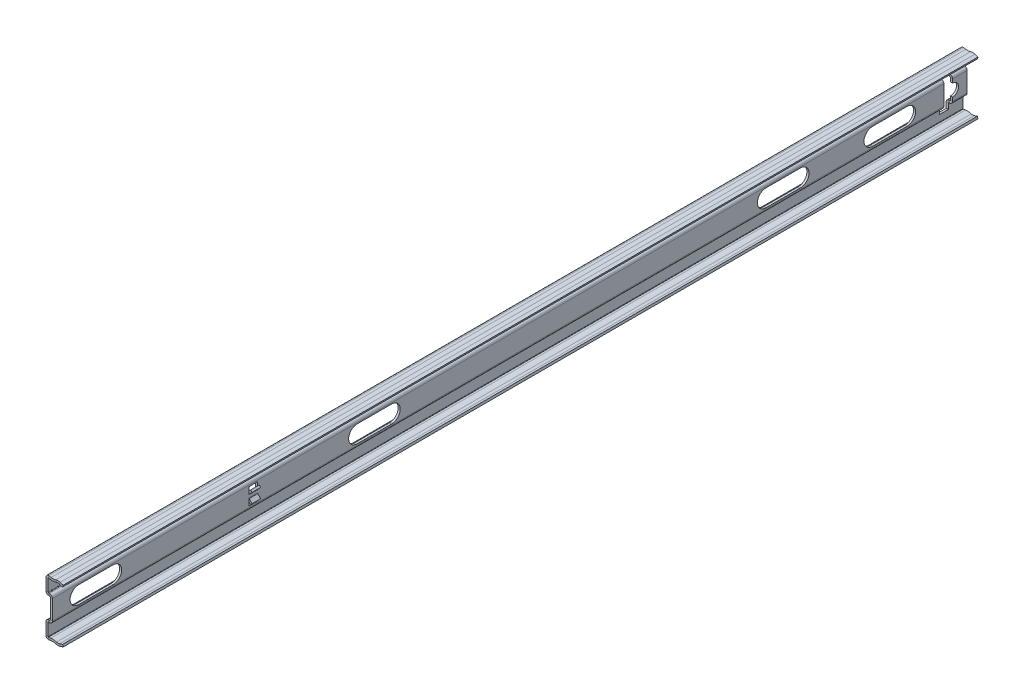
ISO-10303-21;
HEADER;
FILE_DESCRIPTION(('STEP AP214'),'2;1');
FILE_NAME('part.step','',(''),(''),'','','');
FILE_SCHEMA(('AUTOMOTIVE_DESIGN { 1 0 10303 214 1 1 1 1 }'));
ENDSEC;
DATA;
#1=APPLICATION_CONTEXT('core data for automotive mechanical design processes');
#2=APPLICATION_PROTOCOL_DEFINITION('international standard','automotive_design',2000,#1);
#3=PRODUCT_CONTEXT('',#1,'mechanical');
#4=PRODUCT('Part','Part','',(#3));
#5=PRODUCT_RELATED_PRODUCT_CATEGORY('part','',(#4));
#6=PRODUCT_DEFINITION_FORMATION('','',#4);
#7=PRODUCT_DEFINITION_CONTEXT('part definition',#1,'design');
#8=PRODUCT_DEFINITION('design','',#6,#7);
#9=PRODUCT_DEFINITION_SHAPE('','',#8);
#10=(LENGTH_UNIT() NAMED_UNIT(*) SI_UNIT(.MILLI.,.METRE.));
#11=(NAMED_UNIT(*) PLANE_ANGLE_UNIT() SI_UNIT($,.RADIAN.));
#12=(NAMED_UNIT(*) SI_UNIT($,.STERADIAN.) SOLID_ANGLE_UNIT());
#13=UNCERTAINTY_MEASURE_WITH_UNIT(LENGTH_MEASURE(1.E-05),#10,'distance_accuracy_value','');
#14=(GEOMETRIC_REPRESENTATION_CONTEXT(3) GLOBAL_UNCERTAINTY_ASSIGNED_CONTEXT((#13)) GLOBAL_UNIT_ASSIGNED_CONTEXT((#10,
#11,#12)) REPRESENTATION_CONTEXT('',''));
#15=CARTESIAN_POINT('',(0.,0.,0.));
#16=DIRECTION('',(0.,0.,1.));
#17=DIRECTION('',(1.,0.,0.));
#18=AXIS2_PLACEMENT_3D('',#15,#16,#17);
#19=CARTESIAN_POINT('',(7.5,-3.5,-257.5));
#20=DIRECTION('',(0.,0.,-1.));
#21=DIRECTION('',(-1.,0.,0.));
#22=AXIS2_PLACEMENT_3D('',#19,#20,#21);
#23=PLANE('',#22);
#24=DIRECTION('',(0.,1.,0.));
#25=VECTOR('',#24,1.);
#26=CARTESIAN_POINT('',(0.,5.6500000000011,-257.5));
#27=LINE('',#26,#25);
#28=CARTESIAN_POINT('',(0.,-5.6500000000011,-257.5));
#29=VERTEX_POINT('',#28);
#30=CARTESIAN_POINT('',(0.,-3.5,-257.5));
#31=VERTEX_POINT('',#30);
#32=EDGE_CURVE('E834',#29,#31,#27,.T.);
#33=ORIENTED_EDGE('',*,*,#32,.F.);
#34=DIRECTION('',(1.,0.,0.));
#35=VECTOR('',#34,1.);
#36=CARTESIAN_POINT('',(0.,-5.6500000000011,-257.5));
#37=LINE('',#36,#35);
#38=CARTESIAN_POINT('',(1.2,-5.6500000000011,-257.5));
#39=VERTEX_POINT('',#38);
#40=EDGE_CURVE('E1546',#29,#39,#37,.T.);
#41=ORIENTED_EDGE('',*,*,#40,.T.);
#42=DIRECTION('',(0.,1.,0.));
#43=VECTOR('',#42,1.);
#44=CARTESIAN_POINT('',(1.2,5.6500000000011,-257.5));
#45=LINE('',#44,#43);
#46=CARTESIAN_POINT('',(1.2,-3.5,-257.5));
#47=VERTEX_POINT('',#46);
#48=EDGE_CURVE('E837',#39,#47,#45,.T.);
#49=ORIENTED_EDGE('',*,*,#48,.T.);
#50=DIRECTION('',(-1.,0.,0.));
#51=VECTOR('',#50,1.);
#52=CARTESIAN_POINT('',(7.5,-3.5,-257.5));
#53=LINE('',#52,#51);
#54=EDGE_CURVE('E816',#47,#31,#53,.T.);
#55=ORIENTED_EDGE('',*,*,#54,.T.);
#56=EDGE_LOOP('',(#33,#41,#49,#55));
#57=FACE_BOUND('',#56,.T.);
#58=ADVANCED_FACE('F78',(#57),#23,.F.);
#59=DIRECTION('',(1.,0.,0.));
#60=VECTOR('',#59,1.);
#61=CARTESIAN_POINT('',(-1.,-7.3500000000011,-257.5));
#62=LINE('',#61,#60);
#63=CARTESIAN_POINT('',(-1.,-7.3500000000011,-257.5));
#64=VERTEX_POINT('',#63);
#65=CARTESIAN_POINT('',(-0.499999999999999,-7.3500000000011,-257.5));
#66=VERTEX_POINT('',#65);
#67=EDGE_CURVE('E842',#64,#66,#62,.T.);
#68=ORIENTED_EDGE('',*,*,#67,.T.);
#69=DIRECTION('',(0.,1.,0.));
#70=VECTOR('',#69,1.);
#71=CARTESIAN_POINT('',(-0.499999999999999,-7.3500000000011,-257.5));
#72=LINE('',#71,#70);
#73=CARTESIAN_POINT('',(-0.499999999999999,-6.1500000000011,-257.5));
#74=VERTEX_POINT('',#73);
#75=EDGE_CURVE('E1544',#66,#74,#72,.T.);
#76=ORIENTED_EDGE('',*,*,#75,.T.);
#77=DIRECTION('',(1.,0.,0.));
#78=VECTOR('',#77,1.);
#79=CARTESIAN_POINT('',(-1.,-6.1500000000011,-257.5));
#80=LINE('',#79,#78);
#81=CARTESIAN_POINT('',(-1.,-6.1500000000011,-257.5));
#82=VERTEX_POINT('',#81);
#83=EDGE_CURVE('E828',#82,#74,#80,.T.);
#84=ORIENTED_EDGE('',*,*,#83,.F.);
#85=DIRECTION('',(0.,-1.,0.));
#86=VECTOR('',#85,1.);
#87=CARTESIAN_POINT('',(-1.,-6.1500000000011,-257.5));
#88=LINE('',#87,#86);
#89=EDGE_CURVE('E1542',#82,#64,#88,.T.);
#90=ORIENTED_EDGE('',*,*,#89,.T.);
#91=EDGE_LOOP('',(#68,#76,#84,#90));
#92=FACE_BOUND('',#91,.T.);
#93=ADVANCED_FACE('F1623',(#92),#23,.F.);
#94=ORIENTED_EDGE('',*,*,#40,.F.);
#95=CARTESIAN_POINT('',(-0.499999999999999,-5.6500000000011,-257.5));
#96=DIRECTION('',(0.,0.,-1.));
#97=DIRECTION('',(-1.,0.,0.));
#98=AXIS2_PLACEMENT_3D('',#95,#96,#97);
#99=CIRCLE('',#98,0.5);
#100=EDGE_CURVE('E831',#74,#29,#99,.F.);
#101=ORIENTED_EDGE('',*,*,#100,.F.);
#102=ORIENTED_EDGE('',*,*,#75,.F.);
#103=CARTESIAN_POINT('',(-0.499999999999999,-5.6500000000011,-257.5));
#104=DIRECTION('',(0.,0.,-1.));
#105=DIRECTION('',(-1.,0.,0.));
#106=AXIS2_PLACEMENT_3D('',#103,#104,#105);
#107=CIRCLE('',#106,1.7);
#108=EDGE_CURVE('E839',#66,#39,#107,.F.);
#109=ORIENTED_EDGE('',*,*,#108,.T.);
#110=EDGE_LOOP('',(#94,#101,#102,#109));
#111=FACE_BOUND('',#110,.T.);
#112=ADVANCED_FACE('F1630',(#111),#23,.F.);
#113=DIRECTION('',(0.,1.,0.));
#114=VECTOR('',#113,1.);
#115=CARTESIAN_POINT('',(-1.3,-14.768933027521,-257.5));
#116=LINE('',#115,#114);
#117=CARTESIAN_POINT('',(-1.3,-11.,-257.5));
#118=VERTEX_POINT('',#117);
#119=CARTESIAN_POINT('',(-1.3,-7.6500000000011,-257.5));
#120=VERTEX_POINT('',#119);
#121=EDGE_CURVE('E848',#118,#120,#116,.T.);
#122=ORIENTED_EDGE('',*,*,#121,.T.);
#123=DIRECTION('',(-1.,0.,0.));
#124=VECTOR('',#123,1.);
#125=CARTESIAN_POINT('',(-1.3,-7.6500000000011,-257.5));
#126=LINE('',#125,#124);
#127=CARTESIAN_POINT('',(-2.5,-7.6500000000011,-257.5));
#128=VERTEX_POINT('',#127);
#129=EDGE_CURVE('E1540',#120,#128,#126,.T.);
#130=ORIENTED_EDGE('',*,*,#129,.T.);
#131=DIRECTION('',(0.,1.,0.));
#132=VECTOR('',#131,1.);
#133=CARTESIAN_POINT('',(-2.5,-14.768933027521,-257.5));
#134=LINE('',#133,#132);
#135=CARTESIAN_POINT('',(-2.50000000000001,-11.,-257.5));
#136=VERTEX_POINT('',#135);
#137=EDGE_CURVE('E1507',#136,#128,#134,.T.);
#138=ORIENTED_EDGE('',*,*,#137,.F.);
#139=DIRECTION('',(-1.,0.,0.));
#140=VECTOR('',#139,1.);
#141=CARTESIAN_POINT('',(7.5,-11.,-257.5));
#142=LINE('',#141,#140);
#143=EDGE_CURVE('E813',#118,#136,#142,.T.);
#144=ORIENTED_EDGE('',*,*,#143,.F.);
#145=EDGE_LOOP('',(#122,#130,#138,#144));
#146=FACE_BOUND('',#145,.T.);
#147=ADVANCED_FACE('F1639',(#146),#23,.F.);
#148=CARTESIAN_POINT('',(7.5,11.,-252.5));
#149=DIRECTION('',(0.,0.,1.));
#150=DIRECTION('',(1.,0.,0.));
#151=AXIS2_PLACEMENT_3D('',#148,#149,#150);
#152=PLANE('',#151);
#153=DIRECTION('',(0.,-1.,0.));
#154=VECTOR('',#153,1.);
#155=CARTESIAN_POINT('',(-1.3,14.768933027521,-252.5));
#156=LINE('',#155,#154);
#157=CARTESIAN_POINT('',(-1.3,11.,-252.5));
#158=VERTEX_POINT('',#157);
#159=CARTESIAN_POINT('',(-1.3,7.6500000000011,-252.5));
#160=VERTEX_POINT('',#159);
#161=EDGE_CURVE('E874',#158,#160,#156,.T.);
#162=ORIENTED_EDGE('',*,*,#161,.T.);
#163=DIRECTION('',(-1.,0.,0.));
#164=VECTOR('',#163,1.);
#165=CARTESIAN_POINT('',(-1.3,7.6500000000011,-252.5));
#166=LINE('',#165,#164);
#167=CARTESIAN_POINT('',(-2.50000000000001,7.6500000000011,-252.5));
#168=VERTEX_POINT('',#167);
#169=EDGE_CURVE('E1538',#160,#168,#166,.T.);
#170=ORIENTED_EDGE('',*,*,#169,.T.);
#171=DIRECTION('',(0.,1.,0.));
#172=VECTOR('',#171,1.);
#173=CARTESIAN_POINT('',(-2.50000000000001,11.,-252.5));
#174=LINE('',#173,#172);
#175=CARTESIAN_POINT('',(-2.50000000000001,11.,-252.5));
#176=VERTEX_POINT('',#175);
#177=EDGE_CURVE('E773',#168,#176,#174,.T.);
#178=ORIENTED_EDGE('',*,*,#177,.T.);
#179=DIRECTION('',(-1.,0.,0.));
#180=VECTOR('',#179,1.);
#181=CARTESIAN_POINT('',(7.5,11.,-252.5));
#182=LINE('',#181,#180);
#183=EDGE_CURVE('E809',#158,#176,#182,.T.);
#184=ORIENTED_EDGE('',*,*,#183,.F.);
#185=EDGE_LOOP('',(#162,#170,#178,#184));
#186=FACE_BOUND('',#185,.T.);
#187=ADVANCED_FACE('F1649',(#186),#152,.F.);
#188=DIRECTION('',(1.,0.,0.));
#189=VECTOR('',#188,1.);
#190=CARTESIAN_POINT('',(-1.,6.1500000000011,-252.5));
#191=LINE('',#190,#189);
#192=CARTESIAN_POINT('',(-1.,6.1500000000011,-252.5));
#193=VERTEX_POINT('',#192);
#194=CARTESIAN_POINT('',(-0.5,6.1500000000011,-252.5));
#195=VERTEX_POINT('',#194);
#196=EDGE_CURVE('E868',#193,#195,#191,.T.);
#197=ORIENTED_EDGE('',*,*,#196,.F.);
#198=DIRECTION('',(0.,1.,0.));
#199=VECTOR('',#198,1.);
#200=CARTESIAN_POINT('',(-1.,6.1500000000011,-252.5));
#201=LINE('',#200,#199);
#202=CARTESIAN_POINT('',(-1.,7.3500000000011,-252.5));
#203=VERTEX_POINT('',#202);
#204=EDGE_CURVE('E1536',#193,#203,#201,.T.);
#205=ORIENTED_EDGE('',*,*,#204,.T.);
#206=DIRECTION('',(1.,0.,0.));
#207=VECTOR('',#206,1.);
#208=CARTESIAN_POINT('',(-1.,7.3500000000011,-252.5));
#209=LINE('',#208,#207);
#210=CARTESIAN_POINT('',(-0.5,7.3500000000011,-252.5));
#211=VERTEX_POINT('',#210);
#212=EDGE_CURVE('E880',#203,#211,#209,.T.);
#213=ORIENTED_EDGE('',*,*,#212,.T.);
#214=DIRECTION('',(0.,-1.,0.));
#215=VECTOR('',#214,1.);
#216=CARTESIAN_POINT('',(-0.5,7.3500000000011,-252.5));
#217=LINE('',#216,#215);
#218=EDGE_CURVE('E1534',#211,#195,#217,.T.);
#219=ORIENTED_EDGE('',*,*,#218,.T.);
#220=EDGE_LOOP('',(#197,#205,#213,#219));
#221=FACE_BOUND('',#220,.T.);
#222=ADVANCED_FACE('F1657',(#221),#152,.F.);
#223=ORIENTED_EDGE('',*,*,#169,.F.);
#224=CARTESIAN_POINT('',(-1.,7.6500000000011,-252.5));
#225=DIRECTION('',(0.,0.,1.));
#226=DIRECTION('',(1.,0.,0.));
#227=AXIS2_PLACEMENT_3D('',#224,#225,#226);
#228=CIRCLE('',#227,0.3);
#229=EDGE_CURVE('E877',#160,#203,#228,.T.);
#230=ORIENTED_EDGE('',*,*,#229,.T.);
#231=ORIENTED_EDGE('',*,*,#204,.F.);
#232=CARTESIAN_POINT('',(-1.,7.6500000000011,-252.5));
#233=DIRECTION('',(0.,0.,1.));
#234=DIRECTION('',(1.,0.,0.));
#235=AXIS2_PLACEMENT_3D('',#232,#233,#234);
#236=CIRCLE('',#235,1.5);
#237=EDGE_CURVE('E871',#168,#193,#236,.T.);
#238=ORIENTED_EDGE('',*,*,#237,.F.);
#239=EDGE_LOOP('',(#223,#230,#231,#238));
#240=FACE_BOUND('',#239,.T.);
#241=ADVANCED_FACE('F2081',(#240),#152,.F.);
#242=DIRECTION('',(0.,-1.,0.));
#243=VECTOR('',#242,1.);
#244=CARTESIAN_POINT('',(0.,5.6500000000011,-252.5));
#245=LINE('',#244,#243);
#246=CARTESIAN_POINT('',(0.,5.6500000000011,-252.5));
#247=VERTEX_POINT('',#246);
#248=CARTESIAN_POINT('',(0.,-5.6500000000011,-252.5));
#249=VERTEX_POINT('',#248);
#250=EDGE_CURVE('E862',#247,#249,#245,.T.);
#251=ORIENTED_EDGE('',*,*,#250,.F.);
#252=DIRECTION('',(1.,0.,0.));
#253=VECTOR('',#252,1.);
#254=CARTESIAN_POINT('',(0.,5.6500000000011,-252.5));
#255=LINE('',#254,#253);
#256=CARTESIAN_POINT('',(1.2,5.6500000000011,-252.5));
#257=VERTEX_POINT('',#256);
#258=EDGE_CURVE('E1532',#247,#257,#255,.T.);
#259=ORIENTED_EDGE('',*,*,#258,.T.);
#260=DIRECTION('',(0.,-1.,0.));
#261=VECTOR('',#260,1.);
#262=CARTESIAN_POINT('',(1.2,5.6500000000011,-252.5));
#263=LINE('',#262,#261);
#264=CARTESIAN_POINT('',(1.2,-5.6500000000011,-252.5));
#265=VERTEX_POINT('',#264);
#266=EDGE_CURVE('E886',#257,#265,#263,.T.);
#267=ORIENTED_EDGE('',*,*,#266,.T.);
#268=DIRECTION('',(-1.,0.,0.));
#269=VECTOR('',#268,1.);
#270=CARTESIAN_POINT('',(1.2,-5.6500000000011,-252.5));
#271=LINE('',#270,#269);
#272=EDGE_CURVE('E1530',#265,#249,#271,.T.);
#273=ORIENTED_EDGE('',*,*,#272,.T.);
#274=EDGE_LOOP('',(#251,#259,#267,#273));
#275=FACE_BOUND('',#274,.T.);
#276=ADVANCED_FACE('F2073',(#275),#152,.F.);
#277=ORIENTED_EDGE('',*,*,#218,.F.);
#278=CARTESIAN_POINT('',(-0.5,5.6500000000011,-252.5));
#279=DIRECTION('',(0.,0.,1.));
#280=DIRECTION('',(1.,0.,0.));
#281=AXIS2_PLACEMENT_3D('',#278,#279,#280);
#282=CIRCLE('',#281,1.7);
#283=EDGE_CURVE('E883',#211,#257,#282,.F.);
#284=ORIENTED_EDGE('',*,*,#283,.T.);
#285=ORIENTED_EDGE('',*,*,#258,.F.);
#286=CARTESIAN_POINT('',(-0.5,5.6500000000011,-252.5));
#287=DIRECTION('',(0.,0.,1.));
#288=DIRECTION('',(1.,0.,0.));
#289=AXIS2_PLACEMENT_3D('',#286,#287,#288);
#290=CIRCLE('',#289,0.5);
#291=EDGE_CURVE('E865',#195,#247,#290,.F.);
#292=ORIENTED_EDGE('',*,*,#291,.F.);
#293=EDGE_LOOP('',(#277,#284,#285,#292));
#294=FACE_BOUND('',#293,.T.);
#295=ADVANCED_FACE('F2076',(#294),#152,.F.);
#296=DIRECTION('',(-1.,0.,0.));
#297=VECTOR('',#296,1.);
#298=CARTESIAN_POINT('',(-1.,-6.1500000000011,-252.5));
#299=LINE('',#298,#297);
#300=CARTESIAN_POINT('',(-0.499999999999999,-6.1500000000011,-252.5));
#301=VERTEX_POINT('',#300);
#302=CARTESIAN_POINT('',(-1.,-6.1500000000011,-252.5));
#303=VERTEX_POINT('',#302);
#304=EDGE_CURVE('E856',#301,#303,#299,.T.);
#305=ORIENTED_EDGE('',*,*,#304,.F.);
#306=DIRECTION('',(0.,-1.,0.));
#307=VECTOR('',#306,1.);
#308=CARTESIAN_POINT('',(-0.499999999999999,-6.1500000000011,-252.5));
#309=LINE('',#308,#307);
#310=CARTESIAN_POINT('',(-0.499999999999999,-7.3500000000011,-252.5));
#311=VERTEX_POINT('',#310);
#312=EDGE_CURVE('E1528',#301,#311,#309,.T.);
#313=ORIENTED_EDGE('',*,*,#312,.T.);
#314=DIRECTION('',(-1.,0.,0.));
#315=VECTOR('',#314,1.);
#316=CARTESIAN_POINT('',(-1.,-7.3500000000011,-252.5));
#317=LINE('',#316,#315);
#318=CARTESIAN_POINT('',(-1.,-7.3500000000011,-252.5));
#319=VERTEX_POINT('',#318);
#320=EDGE_CURVE('E892',#311,#319,#317,.T.);
#321=ORIENTED_EDGE('',*,*,#320,.T.);
#322=DIRECTION('',(0.,1.,0.));
#323=VECTOR('',#322,1.);
#324=CARTESIAN_POINT('',(-1.,-7.3500000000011,-252.5));
#325=LINE('',#324,#323);
#326=EDGE_CURVE('E1526',#319,#303,#325,.T.);
#327=ORIENTED_EDGE('',*,*,#326,.T.);
#328=EDGE_LOOP('',(#305,#313,#321,#327));
#329=FACE_BOUND('',#328,.T.);
#330=ADVANCED_FACE('F2067',(#329),#152,.F.);
#331=ORIENTED_EDGE('',*,*,#272,.F.);
#332=CARTESIAN_POINT('',(-0.499999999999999,-5.6500000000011,-252.5));
#333=DIRECTION('',(0.,0.,1.));
#334=DIRECTION('',(1.,0.,0.));
#335=AXIS2_PLACEMENT_3D('',#332,#333,#334);
#336=CIRCLE('',#335,1.7);
#337=EDGE_CURVE('E889',#265,#311,#336,.F.);
#338=ORIENTED_EDGE('',*,*,#337,.T.);
#339=ORIENTED_EDGE('',*,*,#312,.F.);
#340=CARTESIAN_POINT('',(-0.499999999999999,-5.6500000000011,-252.5));
#341=DIRECTION('',(0.,0.,1.));
#342=DIRECTION('',(1.,0.,0.));
#343=AXIS2_PLACEMENT_3D('',#340,#341,#342);
#344=CIRCLE('',#343,0.5);
#345=EDGE_CURVE('E859',#249,#301,#344,.F.);
#346=ORIENTED_EDGE('',*,*,#345,.F.);
#347=EDGE_LOOP('',(#331,#338,#339,#346));
#348=FACE_BOUND('',#347,.T.);
#349=ADVANCED_FACE('F2070',(#348),#152,.F.);
#350=CARTESIAN_POINT('',(-2.50000000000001,-11.,-252.5));
#351=VERTEX_POINT('',#350);
#352=CARTESIAN_POINT('',(-2.50000000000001,-7.6500000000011,-252.5));
#353=VERTEX_POINT('',#352);
#354=EDGE_CURVE('E797',#351,#353,#174,.T.);
#355=ORIENTED_EDGE('',*,*,#354,.T.);
#356=DIRECTION('',(1.,0.,0.));
#357=VECTOR('',#356,1.);
#358=CARTESIAN_POINT('',(-2.50000000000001,-7.6500000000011,-252.5));
#359=LINE('',#358,#357);
#360=CARTESIAN_POINT('',(-1.3,-7.6500000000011,-252.5));
#361=VERTEX_POINT('',#360);
#362=EDGE_CURVE('E1524',#353,#361,#359,.T.);
#363=ORIENTED_EDGE('',*,*,#362,.T.);
#364=DIRECTION('',(0.,-1.,0.));
#365=VECTOR('',#364,1.);
#366=CARTESIAN_POINT('',(-1.3,-14.768933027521,-252.5));
#367=LINE('',#366,#365);
#368=CARTESIAN_POINT('',(-1.3,-11.,-252.5));
#369=VERTEX_POINT('',#368);
#370=EDGE_CURVE('E898',#361,#369,#367,.T.);
#371=ORIENTED_EDGE('',*,*,#370,.T.);
#372=DIRECTION('',(-1.,0.,0.));
#373=VECTOR('',#372,1.);
#374=CARTESIAN_POINT('',(7.5,-11.,-252.5));
#375=LINE('',#374,#373);
#376=EDGE_CURVE('E810',#369,#351,#375,.T.);
#377=ORIENTED_EDGE('',*,*,#376,.T.);
#378=EDGE_LOOP('',(#355,#363,#371,#377));
#379=FACE_BOUND('',#378,.T.);
#380=ADVANCED_FACE('F1650',(#379),#152,.F.);
#381=CARTESIAN_POINT('',(7.5,11.,-257.5));
#382=DIRECTION('',(0.,0.,-1.));
#383=DIRECTION('',(-1.,0.,0.));
#384=AXIS2_PLACEMENT_3D('',#381,#382,#383);
#385=PLANE('',#384);
#386=DIRECTION('',(0.,-1.,0.));
#387=VECTOR('',#386,1.);
#388=CARTESIAN_POINT('',(-2.50000000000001,11.,-257.5));
#389=LINE('',#388,#387);
#390=CARTESIAN_POINT('',(-2.50000000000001,11.,-257.5));
#391=VERTEX_POINT('',#390);
#392=CARTESIAN_POINT('',(-2.50000000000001,7.6500000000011,-257.5));
#393=VERTEX_POINT('',#392);
#394=EDGE_CURVE('E803',#391,#393,#389,.T.);
#395=ORIENTED_EDGE('',*,*,#394,.T.);
#396=DIRECTION('',(1.,0.,0.));
#397=VECTOR('',#396,1.);
#398=CARTESIAN_POINT('',(-2.50000000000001,7.6500000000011,-257.5));
#399=LINE('',#398,#397);
#400=CARTESIAN_POINT('',(-1.3,7.6500000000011,-257.5));
#401=VERTEX_POINT('',#400);
#402=EDGE_CURVE('E1522',#393,#401,#399,.T.);
#403=ORIENTED_EDGE('',*,*,#402,.T.);
#404=DIRECTION('',(0.,1.,0.));
#405=VECTOR('',#404,1.);
#406=CARTESIAN_POINT('',(-1.3,14.768933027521,-257.5));
#407=LINE('',#406,#405);
#408=CARTESIAN_POINT('',(-1.3,11.,-257.5));
#409=VERTEX_POINT('',#408);
#410=EDGE_CURVE('E909',#401,#409,#407,.T.);
#411=ORIENTED_EDGE('',*,*,#410,.T.);
#412=DIRECTION('',(-1.,0.,0.));
#413=VECTOR('',#412,1.);
#414=CARTESIAN_POINT('',(7.5,11.,-257.5));
#415=LINE('',#414,#413);
#416=EDGE_CURVE('E822',#409,#391,#415,.T.);
#417=ORIENTED_EDGE('',*,*,#416,.T.);
#418=EDGE_LOOP('',(#395,#403,#411,#417));
#419=FACE_BOUND('',#418,.T.);
#420=ADVANCED_FACE('F2091',(#419),#385,.F.);
#421=DIRECTION('',(-1.,0.,0.));
#422=VECTOR('',#421,1.);
#423=CARTESIAN_POINT('',(-1.,7.3500000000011,-257.5));
#424=LINE('',#423,#422);
#425=CARTESIAN_POINT('',(-0.5,7.3500000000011,-257.5));
#426=VERTEX_POINT('',#425);
#427=CARTESIAN_POINT('',(-1.,7.3500000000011,-257.5));
#428=VERTEX_POINT('',#427);
#429=EDGE_CURVE('E915',#426,#428,#424,.T.);
#430=ORIENTED_EDGE('',*,*,#429,.T.);
#431=DIRECTION('',(0.,-1.,0.));
#432=VECTOR('',#431,1.);
#433=CARTESIAN_POINT('',(-1.,7.3500000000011,-257.5));
#434=LINE('',#433,#432);
#435=CARTESIAN_POINT('',(-1.,6.1500000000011,-257.5));
#436=VERTEX_POINT('',#435);
#437=EDGE_CURVE('E1520',#428,#436,#434,.T.);
#438=ORIENTED_EDGE('',*,*,#437,.T.);
#439=DIRECTION('',(-1.,0.,0.));
#440=VECTOR('',#439,1.);
#441=CARTESIAN_POINT('',(-1.,6.1500000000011,-257.5));
#442=LINE('',#441,#440);
#443=CARTESIAN_POINT('',(-0.5,6.1500000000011,-257.5));
#444=VERTEX_POINT('',#443);
#445=EDGE_CURVE('E903',#444,#436,#442,.T.);
#446=ORIENTED_EDGE('',*,*,#445,.F.);
#447=DIRECTION('',(0.,1.,0.));
#448=VECTOR('',#447,1.);
#449=CARTESIAN_POINT('',(-0.5,6.1500000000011,-257.5));
#450=LINE('',#449,#448);
#451=EDGE_CURVE('E1518',#444,#426,#450,.T.);
#452=ORIENTED_EDGE('',*,*,#451,.T.);
#453=EDGE_LOOP('',(#430,#438,#446,#452));
#454=FACE_BOUND('',#453,.T.);
#455=ADVANCED_FACE('F2103',(#454),#385,.F.);
#456=ORIENTED_EDGE('',*,*,#402,.F.);
#457=CARTESIAN_POINT('',(-1.,7.6500000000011,-257.5));
#458=DIRECTION('',(0.,0.,-1.));
#459=DIRECTION('',(-1.,0.,0.));
#460=AXIS2_PLACEMENT_3D('',#457,#458,#459);
#461=CIRCLE('',#460,1.5);
#462=EDGE_CURVE('E906',#436,#393,#461,.T.);
#463=ORIENTED_EDGE('',*,*,#462,.F.);
#464=ORIENTED_EDGE('',*,*,#437,.F.);
#465=CARTESIAN_POINT('',(-1.,7.6500000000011,-257.5));
#466=DIRECTION('',(0.,0.,-1.));
#467=DIRECTION('',(-1.,0.,0.));
#468=AXIS2_PLACEMENT_3D('',#465,#466,#467);
#469=CIRCLE('',#468,0.3);
#470=EDGE_CURVE('E912',#428,#401,#469,.T.);
#471=ORIENTED_EDGE('',*,*,#470,.T.);
#472=EDGE_LOOP('',(#456,#463,#464,#471));
#473=FACE_BOUND('',#472,.T.);
#474=ADVANCED_FACE('F2097',(#473),#385,.F.);
#475=DIRECTION('',(0.,1.,0.));
#476=VECTOR('',#475,1.);
#477=CARTESIAN_POINT('',(1.2,5.6500000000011,-257.5));
#478=LINE('',#477,#476);
#479=CARTESIAN_POINT('',(1.2,3.5,-257.5));
#480=VERTEX_POINT('',#479);
#481=CARTESIAN_POINT('',(1.2,5.6500000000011,-257.5));
#482=VERTEX_POINT('',#481);
#483=EDGE_CURVE('E921',#480,#482,#478,.T.);
#484=ORIENTED_EDGE('',*,*,#483,.T.);
#485=DIRECTION('',(-1.,0.,0.));
#486=VECTOR('',#485,1.);
#487=CARTESIAN_POINT('',(1.2,5.6500000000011,-257.5));
#488=LINE('',#487,#486);
#489=CARTESIAN_POINT('',(0.,5.6500000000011,-257.5));
#490=VERTEX_POINT('',#489);
#491=EDGE_CURVE('E1516',#482,#490,#488,.T.);
#492=ORIENTED_EDGE('',*,*,#491,.T.);
#493=DIRECTION('',(0.,1.,0.));
#494=VECTOR('',#493,1.);
#495=CARTESIAN_POINT('',(0.,5.6500000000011,-257.5));
#496=LINE('',#495,#494);
#497=CARTESIAN_POINT('',(0.,3.5,-257.5));
#498=VERTEX_POINT('',#497);
#499=EDGE_CURVE('E1510',#498,#490,#496,.T.);
#500=ORIENTED_EDGE('',*,*,#499,.F.);
#501=DIRECTION('',(-1.,0.,0.));
#502=VECTOR('',#501,1.);
#503=CARTESIAN_POINT('',(7.5,3.5,-257.5));
#504=LINE('',#503,#502);
#505=EDGE_CURVE('E819',#480,#498,#504,.T.);
#506=ORIENTED_EDGE('',*,*,#505,.F.);
#507=EDGE_LOOP('',(#484,#492,#500,#506));
#508=FACE_BOUND('',#507,.T.);
#509=ADVANCED_FACE('F2114',(#508),#385,.F.);
#510=CARTESIAN_POINT('',(-1.,-7.6500000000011,266.));
#511=DIRECTION('',(0.,0.,-1.));
#512=DIRECTION('',(-1.,0.,0.));
#513=AXIS2_PLACEMENT_3D('',#510,#511,#512);
#514=CYLINDRICAL_SURFACE('',#513,0.3);
#515=CARTESIAN_POINT('',(-1.,-7.6500000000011,-252.5));
#516=DIRECTION('',(0.,0.,1.));
#517=DIRECTION('',(1.,0.,0.));
#518=AXIS2_PLACEMENT_3D('',#515,#516,#517);
#519=CIRCLE('',#518,0.3);
#520=EDGE_CURVE('E895',#319,#361,#519,.T.);
#521=ORIENTED_EDGE('',*,*,#520,.F.);
#522=DIRECTION('',(0.,0.,-1.));
#523=VECTOR('',#522,1.);
#524=CARTESIAN_POINT('',(-1.,-7.3500000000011,266.));
#525=LINE('',#524,#523);
#526=CARTESIAN_POINT('',(-1.,-7.3500000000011,266.));
#527=VERTEX_POINT('',#526);
#528=EDGE_CURVE('E1353',#527,#319,#525,.T.);
#529=ORIENTED_EDGE('',*,*,#528,.F.);
#530=CARTESIAN_POINT('',(-1.,-7.6500000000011,266.));
#531=DIRECTION('',(0.,0.,1.));
#532=DIRECTION('',(1.,0.,0.));
#533=AXIS2_PLACEMENT_3D('',#530,#531,#532);
#534=CIRCLE('',#533,0.3);
#535=CARTESIAN_POINT('',(-1.3,-7.6500000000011,266.));
#536=VERTEX_POINT('',#535);
#537=EDGE_CURVE('E1033',#527,#536,#534,.T.);
#538=ORIENTED_EDGE('',*,*,#537,.T.);
#539=DIRECTION('',(0.,0.,-1.));
#540=VECTOR('',#539,1.);
#541=CARTESIAN_POINT('',(-1.3,-7.6500000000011,266.));
#542=LINE('',#541,#540);
#543=EDGE_CURVE('E1357',#536,#361,#542,.T.);
#544=ORIENTED_EDGE('',*,*,#543,.T.);
#545=EDGE_LOOP('',(#521,#529,#538,#544));
#546=FACE_BOUND('',#545,.T.);
#547=ADVANCED_FACE('F1878',(#546),#514,.F.);
#548=CARTESIAN_POINT('',(-1.,-7.3500000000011,266.));
#549=DIRECTION('',(0.,-1.,0.));
#550=DIRECTION('',(0.,0.,-1.));
#551=AXIS2_PLACEMENT_3D('',#548,#549,#550);
#552=PLANE('',#551);
#553=ORIENTED_EDGE('',*,*,#320,.F.);
#554=DIRECTION('',(0.,0.,-1.));
#555=VECTOR('',#554,1.);
#556=CARTESIAN_POINT('',(-0.499999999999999,-7.3500000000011,266.));
#557=LINE('',#556,#555);
#558=CARTESIAN_POINT('',(-0.499999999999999,-7.3500000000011,266.));
#559=VERTEX_POINT('',#558);
#560=EDGE_CURVE('E1349',#559,#311,#557,.T.);
#561=ORIENTED_EDGE('',*,*,#560,.F.);
#562=DIRECTION('',(1.,0.,0.));
#563=VECTOR('',#562,1.);
#564=CARTESIAN_POINT('',(-1.,-7.3500000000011,266.));
#565=LINE('',#564,#563);
#566=EDGE_CURVE('E1036',#559,#527,#565,.F.);
#567=ORIENTED_EDGE('',*,*,#566,.T.);
#568=ORIENTED_EDGE('',*,*,#528,.T.);
#569=EDGE_LOOP('',(#553,#561,#567,#568));
#570=FACE_BOUND('',#569,.T.);
#571=ADVANCED_FACE('F1869',(#570),#552,.T.);
#572=CARTESIAN_POINT('',(-0.499999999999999,-5.6500000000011,266.));
#573=DIRECTION('',(0.,0.,-1.));
#574=DIRECTION('',(-1.,0.,0.));
#575=AXIS2_PLACEMENT_3D('',#572,#573,#574);
#576=CYLINDRICAL_SURFACE('',#575,1.7);
#577=ORIENTED_EDGE('',*,*,#337,.F.);
#578=DIRECTION('',(0.,0.,-1.));
#579=VECTOR('',#578,1.);
#580=CARTESIAN_POINT('',(1.2,-5.6500000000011,266.));
#581=LINE('',#580,#579);
#582=CARTESIAN_POINT('',(1.2,-5.6500000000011,266.));
#583=VERTEX_POINT('',#582);
#584=EDGE_CURVE('E1345',#583,#265,#581,.T.);
#585=ORIENTED_EDGE('',*,*,#584,.F.);
#586=CARTESIAN_POINT('',(-0.499999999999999,-5.6500000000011,266.));
#587=DIRECTION('',(0.,0.,1.));
#588=DIRECTION('',(1.,0.,0.));
#589=AXIS2_PLACEMENT_3D('',#586,#587,#588);
#590=CIRCLE('',#589,1.7);
#591=EDGE_CURVE('E1039',#583,#559,#590,.F.);
#592=ORIENTED_EDGE('',*,*,#591,.T.);
#593=ORIENTED_EDGE('',*,*,#560,.T.);
#594=EDGE_LOOP('',(#577,#585,#592,#593));
#595=FACE_BOUND('',#594,.T.);
#596=ADVANCED_FACE('F1860',(#595),#576,.T.);
#597=CARTESIAN_POINT('',(1.2,5.6500000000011,266.));
#598=DIRECTION('',(1.,0.,0.));
#599=DIRECTION('',(0.,1.,0.));
#600=AXIS2_PLACEMENT_3D('',#597,#598,#599);
#601=PLANE('',#600);
#602=DIRECTION('',(0.,0.,-1.));
#603=VECTOR('',#602,1.);
#604=CARTESIAN_POINT('',(1.2,-4.85000000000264,146.6));
#605=LINE('',#604,#603);
#606=CARTESIAN_POINT('',(1.2,-4.85000000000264,151.6));
#607=VERTEX_POINT('',#606);
#608=CARTESIAN_POINT('',(1.2,-4.85000000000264,146.6));
#609=VERTEX_POINT('',#608);
#610=EDGE_CURVE('E93',#607,#609,#605,.T.);
#611=ORIENTED_EDGE('',*,*,#610,.F.);
#612=DIRECTION('',(0.,-1.,0.));
#613=VECTOR('',#612,1.);
#614=CARTESIAN_POINT('',(1.2,-4.85000000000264,151.6));
#615=LINE('',#614,#613);
#616=CARTESIAN_POINT('',(1.2,-0.850000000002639,151.6));
#617=VERTEX_POINT('',#616);
#618=EDGE_CURVE('E767',#617,#607,#615,.T.);
#619=ORIENTED_EDGE('',*,*,#618,.F.);
#620=DIRECTION('',(0.,0.,1.));
#621=VECTOR('',#620,1.);
#622=CARTESIAN_POINT('',(1.2,-0.850000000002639,146.6));
#623=LINE('',#622,#621);
#624=CARTESIAN_POINT('',(1.2,-0.850000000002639,146.6));
#625=VERTEX_POINT('',#624);
#626=EDGE_CURVE('E765',#625,#617,#623,.T.);
#627=ORIENTED_EDGE('',*,*,#626,.F.);
#628=DIRECTION('',(0.,1.,0.));
#629=VECTOR('',#628,1.);
#630=CARTESIAN_POINT('',(1.2,-4.85000000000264,146.6));
#631=LINE('',#630,#629);
#632=EDGE_CURVE('E761',#609,#625,#631,.T.);
#633=ORIENTED_EDGE('',*,*,#632,.F.);
#634=EDGE_LOOP('',(#611,#619,#627,#633));
#635=FACE_BOUND('',#634,.T.);
#636=DIRECTION('',(0.,0.,1.));
#637=VECTOR('',#636,1.);
#638=CARTESIAN_POINT('',(1.2,4.85000000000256,146.6));
#639=LINE('',#638,#637);
#640=CARTESIAN_POINT('',(1.2,4.85000000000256,146.6));
#641=VERTEX_POINT('',#640);
#642=CARTESIAN_POINT('',(1.2,4.85000000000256,151.6));
#643=VERTEX_POINT('',#642);
#644=EDGE_CURVE('E101',#641,#643,#639,.T.);
#645=ORIENTED_EDGE('',*,*,#644,.F.);
#646=DIRECTION('',(0.,1.,0.));
#647=VECTOR('',#646,1.);
#648=CARTESIAN_POINT('',(1.2,4.85000000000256,146.6));
#649=LINE('',#648,#647);
#650=CARTESIAN_POINT('',(1.2,0.850000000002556,146.6));
#651=VERTEX_POINT('',#650);
#652=EDGE_CURVE('E786',#651,#641,#649,.T.);
#653=ORIENTED_EDGE('',*,*,#652,.F.);
#654=DIRECTION('',(0.,0.,-1.));
#655=VECTOR('',#654,1.);
#656=CARTESIAN_POINT('',(1.2,0.850000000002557,146.6));
#657=LINE('',#656,#655);
#658=CARTESIAN_POINT('',(1.2,0.850000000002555,151.6));
#659=VERTEX_POINT('',#658);
#660=EDGE_CURVE('E784',#659,#651,#657,.T.);
#661=ORIENTED_EDGE('',*,*,#660,.F.);
#662=DIRECTION('',(0.,-1.,0.));
#663=VECTOR('',#662,1.);
#664=CARTESIAN_POINT('',(1.2,4.85000000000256,151.6));
#665=LINE('',#664,#663);
#666=EDGE_CURVE('E781',#643,#659,#665,.T.);
#667=ORIENTED_EDGE('',*,*,#666,.F.);
#668=EDGE_LOOP('',(#645,#653,#661,#667));
#669=FACE_BOUND('',#668,.T.);
#670=ORIENTED_EDGE('',*,*,#266,.F.);
#671=DIRECTION('',(0.,0.,-1.));
#672=VECTOR('',#671,1.);
#673=CARTESIAN_POINT('',(1.2,5.6500000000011,266.));
#674=LINE('',#673,#672);
#675=CARTESIAN_POINT('',(1.2,5.6500000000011,266.));
#676=VERTEX_POINT('',#675);
#677=EDGE_CURVE('E1341',#676,#257,#674,.T.);
#678=ORIENTED_EDGE('',*,*,#677,.F.);
#679=DIRECTION('',(0.,-1.,0.));
#680=VECTOR('',#679,1.);
#681=CARTESIAN_POINT('',(1.2,5.6500000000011,266.));
#682=LINE('',#681,#680);
#683=EDGE_CURVE('E1042',#676,#583,#682,.T.);
#684=ORIENTED_EDGE('',*,*,#683,.T.);
#685=ORIENTED_EDGE('',*,*,#584,.T.);
#686=EDGE_LOOP('',(#670,#678,#684,#685));
#687=FACE_BOUND('',#686,.T.);
#688=CARTESIAN_POINT('',(1.2,0.,250.7));
#689=DIRECTION('',(1.,0.,0.));
#690=DIRECTION('',(0.,0.,-1.));
#691=AXIS2_PLACEMENT_3D('',#688,#689,#690);
#692=CIRCLE('',#691,5.);
#693=CARTESIAN_POINT('',(1.2,5.,250.7));
#694=VERTEX_POINT('',#693);
#695=CARTESIAN_POINT('',(1.2,-5.,250.7));
#696=VERTEX_POINT('',#695);
#697=EDGE_CURVE('E929',#694,#696,#692,.T.);
#698=ORIENTED_EDGE('',*,*,#697,.F.);
#699=DIRECTION('',(0.,0.,1.));
#700=VECTOR('',#699,1.);
#701=CARTESIAN_POINT('',(1.2,5.,250.7));
#702=LINE('',#701,#700);
#703=CARTESIAN_POINT('',(1.2,5.,230.7));
#704=VERTEX_POINT('',#703);
#705=EDGE_CURVE('E938',#704,#694,#702,.T.);
#706=ORIENTED_EDGE('',*,*,#705,.F.);
#707=CARTESIAN_POINT('',(1.2,0.,230.7));
#708=DIRECTION('',(1.,0.,0.));
#709=DIRECTION('',(0.,0.,1.));
#710=AXIS2_PLACEMENT_3D('',#707,#708,#709);
#711=CIRCLE('',#710,5.);
#712=CARTESIAN_POINT('',(1.2,-5.,230.7));
#713=VERTEX_POINT('',#712);
#714=EDGE_CURVE('E935',#713,#704,#711,.T.);
#715=ORIENTED_EDGE('',*,*,#714,.F.);
#716=DIRECTION('',(0.,0.,-1.));
#717=VECTOR('',#716,1.);
#718=CARTESIAN_POINT('',(1.2,-5.,250.7));
#719=LINE('',#718,#717);
#720=EDGE_CURVE('E931',#696,#713,#719,.T.);
#721=ORIENTED_EDGE('',*,*,#720,.F.);
#722=EDGE_LOOP('',(#698,#706,#715,#721));
#723=FACE_BOUND('',#722,.T.);
#724=CARTESIAN_POINT('',(1.2,0.,-211.));
#725=DIRECTION('',(1.,0.,0.));
#726=DIRECTION('',(0.,0.,-1.));
#727=AXIS2_PLACEMENT_3D('',#724,#725,#726);
#728=CIRCLE('',#727,5.);
#729=CARTESIAN_POINT('',(1.2,5.,-211.));
#730=VERTEX_POINT('',#729);
#731=CARTESIAN_POINT('',(1.2,-5.,-211.));
#732=VERTEX_POINT('',#731);
#733=EDGE_CURVE('E951',#730,#732,#728,.T.);
#734=ORIENTED_EDGE('',*,*,#733,.F.);
#735=DIRECTION('',(0.,0.,1.));
#736=VECTOR('',#735,1.);
#737=CARTESIAN_POINT('',(1.2,5.,-211.));
#738=LINE('',#737,#736);
#739=CARTESIAN_POINT('',(1.2,5.,-231.));
#740=VERTEX_POINT('',#739);
#741=EDGE_CURVE('E960',#740,#730,#738,.T.);
#742=ORIENTED_EDGE('',*,*,#741,.F.);
#743=CARTESIAN_POINT('',(1.2,0.,-231.));
#744=DIRECTION('',(1.,0.,0.));
#745=DIRECTION('',(0.,0.,1.));
#746=AXIS2_PLACEMENT_3D('',#743,#744,#745);
#747=CIRCLE('',#746,5.);
#748=CARTESIAN_POINT('',(1.2,-5.,-231.));
#749=VERTEX_POINT('',#748);
#750=EDGE_CURVE('E957',#749,#740,#747,.T.);
#751=ORIENTED_EDGE('',*,*,#750,.F.);
#752=DIRECTION('',(0.,0.,-1.));
#753=VECTOR('',#752,1.);
#754=CARTESIAN_POINT('',(1.2,-5.,-211.));
#755=LINE('',#754,#753);
#756=EDGE_CURVE('E953',#732,#749,#755,.T.);
#757=ORIENTED_EDGE('',*,*,#756,.F.);
#758=EDGE_LOOP('',(#734,#742,#751,#757));
#759=FACE_BOUND('',#758,.T.);
#760=CARTESIAN_POINT('',(1.2,0.,-149.));
#761=DIRECTION('',(1.,0.,0.));
#762=DIRECTION('',(0.,0.,-1.));
#763=AXIS2_PLACEMENT_3D('',#760,#761,#762);
#764=CIRCLE('',#763,5.);
#765=CARTESIAN_POINT('',(1.2,5.,-149.));
#766=VERTEX_POINT('',#765);
#767=CARTESIAN_POINT('',(1.2,-5.,-149.));
#768=VERTEX_POINT('',#767);
#769=EDGE_CURVE('E971',#766,#768,#764,.T.);
#770=ORIENTED_EDGE('',*,*,#769,.F.);
#771=DIRECTION('',(0.,0.,1.));
#772=VECTOR('',#771,1.);
#773=CARTESIAN_POINT('',(1.2,5.,-149.));
#774=LINE('',#773,#772);
#775=CARTESIAN_POINT('',(1.2,5.,-169.));
#776=VERTEX_POINT('',#775);
#777=EDGE_CURVE('E980',#776,#766,#774,.T.);
#778=ORIENTED_EDGE('',*,*,#777,.F.);
#779=CARTESIAN_POINT('',(1.2,0.,-169.));
#780=DIRECTION('',(1.,0.,0.));
#781=DIRECTION('',(0.,0.,1.));
#782=AXIS2_PLACEMENT_3D('',#779,#780,#781);
#783=CIRCLE('',#782,5.);
#784=CARTESIAN_POINT('',(1.2,-5.,-169.));
#785=VERTEX_POINT('',#784);
#786=EDGE_CURVE('E977',#785,#776,#783,.T.);
#787=ORIENTED_EDGE('',*,*,#786,.F.);
#788=DIRECTION('',(0.,0.,-1.));
#789=VECTOR('',#788,1.);
#790=CARTESIAN_POINT('',(1.2,-5.,-149.));
#791=LINE('',#790,#789);
#792=EDGE_CURVE('E973',#768,#785,#791,.T.);
#793=ORIENTED_EDGE('',*,*,#792,.F.);
#794=EDGE_LOOP('',(#770,#778,#787,#793));
#795=FACE_BOUND('',#794,.T.);
#796=CARTESIAN_POINT('',(1.2,0.,88.7));
#797=DIRECTION('',(1.,0.,0.));
#798=DIRECTION('',(0.,0.,-1.));
#799=AXIS2_PLACEMENT_3D('',#796,#797,#798);
#800=CIRCLE('',#799,5.);
#801=CARTESIAN_POINT('',(1.2,5.,88.7));
#802=VERTEX_POINT('',#801);
#803=CARTESIAN_POINT('',(1.2,-5.,88.7));
#804=VERTEX_POINT('',#803);
#805=EDGE_CURVE('E928',#802,#804,#800,.T.);
#806=ORIENTED_EDGE('',*,*,#805,.F.);
#807=DIRECTION('',(0.,0.,1.));
#808=VECTOR('',#807,1.);
#809=CARTESIAN_POINT('',(1.2,5.,88.7));
#810=LINE('',#809,#808);
#811=CARTESIAN_POINT('',(1.2,5.,68.7000000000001));
#812=VERTEX_POINT('',#811);
#813=EDGE_CURVE('E998',#812,#802,#810,.T.);
#814=ORIENTED_EDGE('',*,*,#813,.F.);
#815=CARTESIAN_POINT('',(1.2,0.,68.7));
#816=DIRECTION('',(1.,0.,0.));
#817=DIRECTION('',(0.,0.,1.));
#818=AXIS2_PLACEMENT_3D('',#815,#816,#817);
#819=CIRCLE('',#818,5.);
#820=CARTESIAN_POINT('',(1.2,-5.,68.7000000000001));
#821=VERTEX_POINT('',#820);
#822=EDGE_CURVE('E995',#821,#812,#819,.T.);
#823=ORIENTED_EDGE('',*,*,#822,.F.);
#824=DIRECTION('',(0.,0.,-1.));
#825=VECTOR('',#824,1.);
#826=CARTESIAN_POINT('',(1.2,-5.,88.7));
#827=LINE('',#826,#825);
#828=EDGE_CURVE('E992',#804,#821,#827,.T.);
#829=ORIENTED_EDGE('',*,*,#828,.F.);
#830=EDGE_LOOP('',(#806,#814,#823,#829));
#831=FACE_BOUND('',#830,.T.);
#832=ADVANCED_FACE('F1582',(#635,#669,#687,#723,#759,#795,#831),#601,.T.);
#833=CARTESIAN_POINT('',(-0.5,5.6500000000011,266.));
#834=DIRECTION('',(0.,0.,-1.));
#835=DIRECTION('',(-1.,0.,0.));
#836=AXIS2_PLACEMENT_3D('',#833,#834,#835);
#837=CYLINDRICAL_SURFACE('',#836,1.7);
#838=ORIENTED_EDGE('',*,*,#283,.F.);
#839=DIRECTION('',(0.,0.,-1.));
#840=VECTOR('',#839,1.);
#841=CARTESIAN_POINT('',(-0.5,7.3500000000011,266.));
#842=LINE('',#841,#840);
#843=CARTESIAN_POINT('',(-0.5,7.3500000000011,266.));
#844=VERTEX_POINT('',#843);
#845=EDGE_CURVE('E1337',#844,#211,#842,.T.);
#846=ORIENTED_EDGE('',*,*,#845,.F.);
#847=CARTESIAN_POINT('',(-0.5,5.6500000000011,266.));
#848=DIRECTION('',(0.,0.,1.));
#849=DIRECTION('',(1.,0.,0.));
#850=AXIS2_PLACEMENT_3D('',#847,#848,#849);
#851=CIRCLE('',#850,1.7);
#852=EDGE_CURVE('E1045',#844,#676,#851,.F.);
#853=ORIENTED_EDGE('',*,*,#852,.T.);
#854=ORIENTED_EDGE('',*,*,#677,.T.);
#855=EDGE_LOOP('',(#838,#846,#853,#854));
#856=FACE_BOUND('',#855,.T.);
#857=ADVANCED_FACE('F1842',(#856),#837,.T.);
#858=CARTESIAN_POINT('',(-1.,7.3500000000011,266.));
#859=DIRECTION('',(0.,1.,0.));
#860=DIRECTION('',(0.,0.,1.));
#861=AXIS2_PLACEMENT_3D('',#858,#859,#860);
#862=PLANE('',#861);
#863=ORIENTED_EDGE('',*,*,#212,.F.);
#864=DIRECTION('',(0.,0.,-1.));
#865=VECTOR('',#864,1.);
#866=CARTESIAN_POINT('',(-1.,7.3500000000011,266.));
#867=LINE('',#866,#865);
#868=CARTESIAN_POINT('',(-1.,7.3500000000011,266.));
#869=VERTEX_POINT('',#868);
#870=EDGE_CURVE('E1333',#869,#203,#867,.T.);
#871=ORIENTED_EDGE('',*,*,#870,.F.);
#872=DIRECTION('',(1.,0.,0.));
#873=VECTOR('',#872,1.);
#874=CARTESIAN_POINT('',(-1.,7.3500000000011,266.));
#875=LINE('',#874,#873);
#876=EDGE_CURVE('E1048',#869,#844,#875,.T.);
#877=ORIENTED_EDGE('',*,*,#876,.T.);
#878=ORIENTED_EDGE('',*,*,#845,.T.);
#879=EDGE_LOOP('',(#863,#871,#877,#878));
#880=FACE_BOUND('',#879,.T.);
#881=ADVANCED_FACE('F1833',(#880),#862,.T.);
#882=CARTESIAN_POINT('',(-1.,7.6500000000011,266.));
#883=DIRECTION('',(0.,0.,-1.));
#884=DIRECTION('',(-1.,0.,0.));
#885=AXIS2_PLACEMENT_3D('',#882,#883,#884);
#886=CYLINDRICAL_SURFACE('',#885,0.3);
#887=ORIENTED_EDGE('',*,*,#229,.F.);
#888=DIRECTION('',(0.,0.,-1.));
#889=VECTOR('',#888,1.);
#890=CARTESIAN_POINT('',(-1.3,7.6500000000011,266.));
#891=LINE('',#890,#889);
#892=CARTESIAN_POINT('',(-1.3,7.6500000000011,266.));
#893=VERTEX_POINT('',#892);
#894=EDGE_CURVE('E1329',#893,#160,#891,.T.);
#895=ORIENTED_EDGE('',*,*,#894,.F.);
#896=CARTESIAN_POINT('',(-1.,7.6500000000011,266.));
#897=DIRECTION('',(0.,0.,1.));
#898=DIRECTION('',(1.,0.,0.));
#899=AXIS2_PLACEMENT_3D('',#896,#897,#898);
#900=CIRCLE('',#899,0.3);
#901=EDGE_CURVE('E1051',#893,#869,#900,.T.);
#902=ORIENTED_EDGE('',*,*,#901,.T.);
#903=ORIENTED_EDGE('',*,*,#870,.T.);
#904=EDGE_LOOP('',(#887,#895,#902,#903));
#905=FACE_BOUND('',#904,.T.);
#906=ADVANCED_FACE('F1823',(#905),#886,.F.);
#907=CARTESIAN_POINT('',(-1.,7.6500000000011,266.));
#908=DIRECTION('',(0.,0.,-1.));
#909=DIRECTION('',(-1.,0.,0.));
#910=AXIS2_PLACEMENT_3D('',#907,#908,#909);
#911=CYLINDRICAL_SURFACE('',#910,1.5);
#912=DIRECTION('',(0.,0.,-1.));
#913=VECTOR('',#912,1.);
#914=CARTESIAN_POINT('',(-2.5,7.6500000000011,266.));
#915=LINE('',#914,#913);
#916=CARTESIAN_POINT('',(-2.5,7.6500000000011,266.));
#917=VERTEX_POINT('',#916);
#918=EDGE_CURVE('E1291',#917,#168,#915,.T.);
#919=ORIENTED_EDGE('',*,*,#918,.T.);
#920=ORIENTED_EDGE('',*,*,#237,.T.);
#921=DIRECTION('',(0.,0.,-1.));
#922=VECTOR('',#921,1.);
#923=CARTESIAN_POINT('',(-1.,6.1500000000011,266.));
#924=LINE('',#923,#922);
#925=CARTESIAN_POINT('',(-1.,6.1500000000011,266.));
#926=VERTEX_POINT('',#925);
#927=EDGE_CURVE('E1287',#926,#193,#924,.T.);
#928=ORIENTED_EDGE('',*,*,#927,.F.);
#929=CARTESIAN_POINT('',(-1.,7.6500000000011,266.));
#930=DIRECTION('',(0.,0.,1.));
#931=DIRECTION('',(-1.,0.,0.));
#932=AXIS2_PLACEMENT_3D('',#929,#930,#931);
#933=CIRCLE('',#932,1.5);
#934=EDGE_CURVE('E1093',#917,#926,#933,.T.);
#935=ORIENTED_EDGE('',*,*,#934,.F.);
#936=EDGE_LOOP('',(#919,#920,#928,#935));
#937=FACE_BOUND('',#936,.T.);
#938=ADVANCED_FACE('F2140',(#937),#911,.T.);
#939=CARTESIAN_POINT('',(-1.,6.1500000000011,266.));
#940=DIRECTION('',(0.,1.,0.));
#941=DIRECTION('',(0.,0.,1.));
#942=AXIS2_PLACEMENT_3D('',#939,#940,#941);
#943=PLANE('',#942);
#944=ORIENTED_EDGE('',*,*,#927,.T.);
#945=ORIENTED_EDGE('',*,*,#196,.T.);
#946=DIRECTION('',(0.,0.,-1.));
#947=VECTOR('',#946,1.);
#948=CARTESIAN_POINT('',(-0.5,6.1500000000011,266.));
#949=LINE('',#948,#947);
#950=CARTESIAN_POINT('',(-0.5,6.1500000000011,266.));
#951=VERTEX_POINT('',#950);
#952=EDGE_CURVE('E1283',#951,#195,#949,.T.);
#953=ORIENTED_EDGE('',*,*,#952,.F.);
#954=DIRECTION('',(1.,0.,0.));
#955=VECTOR('',#954,1.);
#956=CARTESIAN_POINT('',(-1.,6.1500000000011,266.));
#957=LINE('',#956,#955);
#958=EDGE_CURVE('E1096',#926,#951,#957,.T.);
#959=ORIENTED_EDGE('',*,*,#958,.F.);
#960=EDGE_LOOP('',(#944,#945,#953,#959));
#961=FACE_BOUND('',#960,.T.);
#962=ADVANCED_FACE('F2138',(#961),#943,.F.);
#963=CARTESIAN_POINT('',(-0.5,5.6500000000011,266.));
#964=DIRECTION('',(0.,0.,-1.));
#965=DIRECTION('',(-1.,0.,0.));
#966=AXIS2_PLACEMENT_3D('',#963,#964,#965);
#967=CYLINDRICAL_SURFACE('',#966,0.5);
#968=ORIENTED_EDGE('',*,*,#952,.T.);
#969=ORIENTED_EDGE('',*,*,#291,.T.);
#970=DIRECTION('',(0.,0.,-1.));
#971=VECTOR('',#970,1.);
#972=CARTESIAN_POINT('',(0.,5.6500000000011,266.));
#973=LINE('',#972,#971);
#974=CARTESIAN_POINT('',(0.,5.6500000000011,266.));
#975=VERTEX_POINT('',#974);
#976=EDGE_CURVE('E1279',#975,#247,#973,.T.);
#977=ORIENTED_EDGE('',*,*,#976,.F.);
#978=CARTESIAN_POINT('',(-0.5,5.6500000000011,266.));
#979=DIRECTION('',(0.,0.,-1.));
#980=DIRECTION('',(-1.,0.,0.));
#981=AXIS2_PLACEMENT_3D('',#978,#979,#980);
#982=CIRCLE('',#981,0.5);
#983=EDGE_CURVE('E1099',#951,#975,#982,.T.);
#984=ORIENTED_EDGE('',*,*,#983,.F.);
#985=EDGE_LOOP('',(#968,#969,#977,#984));
#986=FACE_BOUND('',#985,.T.);
#987=ADVANCED_FACE('F2134',(#986),#967,.F.);
#988=CARTESIAN_POINT('',(0.,5.6500000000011,266.));
#989=DIRECTION('',(1.,0.,0.));
#990=DIRECTION('',(0.,1.,0.));
#991=AXIS2_PLACEMENT_3D('',#988,#989,#990);
#992=PLANE('',#991);
#993=DIRECTION('',(0.,-1.,0.));
#994=VECTOR('',#993,1.);
#995=CARTESIAN_POINT('',(0.,5.6500000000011,151.6));
#996=LINE('',#995,#994);
#997=CARTESIAN_POINT('',(0.,-0.850000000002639,151.6));
#998=VERTEX_POINT('',#997);
#999=CARTESIAN_POINT('',(0.,-4.85000000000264,151.6));
#1000=VERTEX_POINT('',#999);
#1001=EDGE_CURVE('E86',#998,#1000,#996,.T.);
#1002=ORIENTED_EDGE('',*,*,#1001,.T.);
#1003=DIRECTION('',(0.,0.,-1.));
#1004=VECTOR('',#1003,1.);
#1005=CARTESIAN_POINT('',(0.,-4.85000000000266,266.));
#1006=LINE('',#1005,#1004);
#1007=CARTESIAN_POINT('',(0.,-4.85000000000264,146.6));
#1008=VERTEX_POINT('',#1007);
#1009=EDGE_CURVE('E13',#1000,#1008,#1006,.T.);
#1010=ORIENTED_EDGE('',*,*,#1009,.T.);
#1011=DIRECTION('',(0.,1.,0.));
#1012=VECTOR('',#1011,1.);
#1013=CARTESIAN_POINT('',(0.,5.6500000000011,146.6));
#1014=LINE('',#1013,#1012);
#1015=CARTESIAN_POINT('',(0.,-0.850000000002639,146.6));
#1016=VERTEX_POINT('',#1015);
#1017=EDGE_CURVE('E1560',#1008,#1016,#1014,.T.);
#1018=ORIENTED_EDGE('',*,*,#1017,.T.);
#1019=DIRECTION('',(0.,0.,1.));
#1020=VECTOR('',#1019,1.);
#1021=CARTESIAN_POINT('',(0.,-0.850000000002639,266.));
#1022=LINE('',#1021,#1020);
#1023=EDGE_CURVE('E1563',#1016,#998,#1022,.T.);
#1024=ORIENTED_EDGE('',*,*,#1023,.T.);
#1025=EDGE_LOOP('',(#1002,#1010,#1018,#1024));
#1026=FACE_BOUND('',#1025,.T.);
#1027=DIRECTION('',(0.,1.,0.));
#1028=VECTOR('',#1027,1.);
#1029=CARTESIAN_POINT('',(0.,5.6500000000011,146.6));
#1030=LINE('',#1029,#1028);
#1031=CARTESIAN_POINT('',(0.,0.850000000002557,146.6));
#1032=VERTEX_POINT('',#1031);
#1033=CARTESIAN_POINT('',(0.,4.85000000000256,146.6));
#1034=VERTEX_POINT('',#1033);
#1035=EDGE_CURVE('E1554',#1032,#1034,#1030,.T.);
#1036=ORIENTED_EDGE('',*,*,#1035,.T.);
#1037=DIRECTION('',(0.,0.,1.));
#1038=VECTOR('',#1037,1.);
#1039=CARTESIAN_POINT('',(0.,4.85000000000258,266.));
#1040=LINE('',#1039,#1038);
#1041=CARTESIAN_POINT('',(0.,4.85000000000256,151.6));
#1042=VERTEX_POINT('',#1041);
#1043=EDGE_CURVE('E1557',#1034,#1042,#1040,.T.);
#1044=ORIENTED_EDGE('',*,*,#1043,.T.);
#1045=DIRECTION('',(0.,-1.,0.));
#1046=VECTOR('',#1045,1.);
#1047=CARTESIAN_POINT('',(0.,5.6500000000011,151.6));
#1048=LINE('',#1047,#1046);
#1049=CARTESIAN_POINT('',(0.,0.850000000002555,151.6));
#1050=VERTEX_POINT('',#1049);
#1051=EDGE_CURVE('E1548',#1042,#1050,#1048,.T.);
#1052=ORIENTED_EDGE('',*,*,#1051,.T.);
#1053=DIRECTION('',(0.,0.,-1.));
#1054=VECTOR('',#1053,1.);
#1055=CARTESIAN_POINT('',(0.,0.850000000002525,266.));
#1056=LINE('',#1055,#1054);
#1057=EDGE_CURVE('E1551',#1050,#1032,#1056,.T.);
#1058=ORIENTED_EDGE('',*,*,#1057,.T.);
#1059=EDGE_LOOP('',(#1036,#1044,#1052,#1058));
#1060=FACE_BOUND('',#1059,.T.);
#1061=DIRECTION('',(0.,0.,1.));
#1062=VECTOR('',#1061,1.);
#1063=CARTESIAN_POINT('',(0.,5.,266.));
#1064=LINE('',#1063,#1062);
#1065=CARTESIAN_POINT('',(0.,5.,68.7000000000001));
#1066=VERTEX_POINT('',#1065);
#1067=CARTESIAN_POINT('',(0.,5.,88.7));
#1068=VERTEX_POINT('',#1067);
#1069=EDGE_CURVE('E1465',#1066,#1068,#1064,.T.);
#1070=ORIENTED_EDGE('',*,*,#1069,.T.);
#1071=CARTESIAN_POINT('',(0.,0.,88.7));
#1072=DIRECTION('',(1.,0.,0.));
#1073=DIRECTION('',(0.,1.,0.));
#1074=AXIS2_PLACEMENT_3D('',#1071,#1072,#1073);
#1075=CIRCLE('',#1074,5.);
#1076=CARTESIAN_POINT('',(0.,-5.,88.7));
#1077=VERTEX_POINT('',#1076);
#1078=EDGE_CURVE('E1468',#1068,#1077,#1075,.T.);
#1079=ORIENTED_EDGE('',*,*,#1078,.T.);
#1080=DIRECTION('',(0.,0.,-1.));
#1081=VECTOR('',#1080,1.);
#1082=CARTESIAN_POINT('',(0.,-5.,266.));
#1083=LINE('',#1082,#1081);
#1084=CARTESIAN_POINT('',(0.,-5.,68.7000000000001));
#1085=VERTEX_POINT('',#1084);
#1086=EDGE_CURVE('E1459',#1077,#1085,#1083,.T.);
#1087=ORIENTED_EDGE('',*,*,#1086,.T.);
#1088=CARTESIAN_POINT('',(0.,0.,68.7));
#1089=DIRECTION('',(1.,0.,0.));
#1090=DIRECTION('',(0.,1.,0.));
#1091=AXIS2_PLACEMENT_3D('',#1088,#1089,#1090);
#1092=CIRCLE('',#1091,5.);
#1093=EDGE_CURVE('E1462',#1085,#1066,#1092,.T.);
#1094=ORIENTED_EDGE('',*,*,#1093,.T.);
#1095=EDGE_LOOP('',(#1070,#1079,#1087,#1094));
#1096=FACE_BOUND('',#1095,.T.);
#1097=DIRECTION('',(0.,0.,1.));
#1098=VECTOR('',#1097,1.);
#1099=CARTESIAN_POINT('',(0.,5.,266.));
#1100=LINE('',#1099,#1098);
#1101=CARTESIAN_POINT('',(0.,5.,-169.));
#1102=VERTEX_POINT('',#1101);
#1103=CARTESIAN_POINT('',(0.,5.,-149.));
#1104=VERTEX_POINT('',#1103);
#1105=EDGE_CURVE('E1477',#1102,#1104,#1100,.T.);
#1106=ORIENTED_EDGE('',*,*,#1105,.T.);
#1107=CARTESIAN_POINT('',(0.,0.,-149.));
#1108=DIRECTION('',(1.,0.,0.));
#1109=DIRECTION('',(0.,1.,0.));
#1110=AXIS2_PLACEMENT_3D('',#1107,#1108,#1109);
#1111=CIRCLE('',#1110,5.);
#1112=CARTESIAN_POINT('',(0.,-5.,-149.));
#1113=VERTEX_POINT('',#1112);
#1114=EDGE_CURVE('E1480',#1104,#1113,#1111,.T.);
#1115=ORIENTED_EDGE('',*,*,#1114,.T.);
#1116=DIRECTION('',(0.,0.,-1.));
#1117=VECTOR('',#1116,1.);
#1118=CARTESIAN_POINT('',(0.,-5.,266.));
#1119=LINE('',#1118,#1117);
#1120=CARTESIAN_POINT('',(0.,-5.,-169.));
#1121=VERTEX_POINT('',#1120);
#1122=EDGE_CURVE('E1471',#1113,#1121,#1119,.T.);
#1123=ORIENTED_EDGE('',*,*,#1122,.T.);
#1124=CARTESIAN_POINT('',(0.,0.,-169.));
#1125=DIRECTION('',(1.,0.,0.));
#1126=DIRECTION('',(0.,1.,0.));
#1127=AXIS2_PLACEMENT_3D('',#1124,#1125,#1126);
#1128=CIRCLE('',#1127,5.);
#1129=EDGE_CURVE('E1474',#1121,#1102,#1128,.T.);
#1130=ORIENTED_EDGE('',*,*,#1129,.T.);
#1131=EDGE_LOOP('',(#1106,#1115,#1123,#1130));
#1132=FACE_BOUND('',#1131,.T.);
#1133=DIRECTION('',(0.,0.,1.));
#1134=VECTOR('',#1133,1.);
#1135=CARTESIAN_POINT('',(0.,5.,266.));
#1136=LINE('',#1135,#1134);
#1137=CARTESIAN_POINT('',(0.,5.,-231.));
#1138=VERTEX_POINT('',#1137);
#1139=CARTESIAN_POINT('',(0.,5.,-211.));
#1140=VERTEX_POINT('',#1139);
#1141=EDGE_CURVE('E1489',#1138,#1140,#1136,.T.);
#1142=ORIENTED_EDGE('',*,*,#1141,.T.);
#1143=CARTESIAN_POINT('',(0.,0.,-211.));
#1144=DIRECTION('',(1.,0.,0.));
#1145=DIRECTION('',(0.,1.,0.));
#1146=AXIS2_PLACEMENT_3D('',#1143,#1144,#1145);
#1147=CIRCLE('',#1146,5.);
#1148=CARTESIAN_POINT('',(0.,-5.,-211.));
#1149=VERTEX_POINT('',#1148);
#1150=EDGE_CURVE('E1492',#1140,#1149,#1147,.T.);
#1151=ORIENTED_EDGE('',*,*,#1150,.T.);
#1152=DIRECTION('',(0.,0.,-1.));
#1153=VECTOR('',#1152,1.);
#1154=CARTESIAN_POINT('',(0.,-5.,266.));
#1155=LINE('',#1154,#1153);
#1156=CARTESIAN_POINT('',(0.,-5.,-231.));
#1157=VERTEX_POINT('',#1156);
#1158=EDGE_CURVE('E1483',#1149,#1157,#1155,.T.);
#1159=ORIENTED_EDGE('',*,*,#1158,.T.);
#1160=CARTESIAN_POINT('',(0.,0.,-231.));
#1161=DIRECTION('',(1.,0.,0.));
#1162=DIRECTION('',(0.,1.,0.));
#1163=AXIS2_PLACEMENT_3D('',#1160,#1161,#1162);
#1164=CIRCLE('',#1163,5.);
#1165=EDGE_CURVE('E1486',#1157,#1138,#1164,.T.);
#1166=ORIENTED_EDGE('',*,*,#1165,.T.);
#1167=EDGE_LOOP('',(#1142,#1151,#1159,#1166));
#1168=FACE_BOUND('',#1167,.T.);
#1169=DIRECTION('',(0.,0.,1.));
#1170=VECTOR('',#1169,1.);
#1171=CARTESIAN_POINT('',(0.,5.,266.));
#1172=LINE('',#1171,#1170);
#1173=CARTESIAN_POINT('',(0.,5.,230.7));
#1174=VERTEX_POINT('',#1173);
#1175=CARTESIAN_POINT('',(0.,5.,250.7));
#1176=VERTEX_POINT('',#1175);
#1177=EDGE_CURVE('E1501',#1174,#1176,#1172,.T.);
#1178=ORIENTED_EDGE('',*,*,#1177,.T.);
#1179=CARTESIAN_POINT('',(0.,0.,250.7));
#1180=DIRECTION('',(1.,0.,0.));
#1181=DIRECTION('',(0.,1.,0.));
#1182=AXIS2_PLACEMENT_3D('',#1179,#1180,#1181);
#1183=CIRCLE('',#1182,5.);
#1184=CARTESIAN_POINT('',(0.,-5.,250.7));
#1185=VERTEX_POINT('',#1184);
#1186=EDGE_CURVE('E1504',#1176,#1185,#1183,.T.);
#1187=ORIENTED_EDGE('',*,*,#1186,.T.);
#1188=DIRECTION('',(0.,0.,-1.));
#1189=VECTOR('',#1188,1.);
#1190=CARTESIAN_POINT('',(0.,-5.,266.));
#1191=LINE('',#1190,#1189);
#1192=CARTESIAN_POINT('',(0.,-5.,230.7));
#1193=VERTEX_POINT('',#1192);
#1194=EDGE_CURVE('E1495',#1185,#1193,#1191,.T.);
#1195=ORIENTED_EDGE('',*,*,#1194,.T.);
#1196=CARTESIAN_POINT('',(0.,0.,230.7));
#1197=DIRECTION('',(1.,0.,0.));
#1198=DIRECTION('',(0.,1.,0.));
#1199=AXIS2_PLACEMENT_3D('',#1196,#1197,#1198);
#1200=CIRCLE('',#1199,5.);
#1201=EDGE_CURVE('E1498',#1193,#1174,#1200,.T.);
#1202=ORIENTED_EDGE('',*,*,#1201,.T.);
#1203=EDGE_LOOP('',(#1178,#1187,#1195,#1202));
#1204=FACE_BOUND('',#1203,.T.);
#1205=ORIENTED_EDGE('',*,*,#976,.T.);
#1206=ORIENTED_EDGE('',*,*,#250,.T.);
#1207=DIRECTION('',(0.,0.,-1.));
#1208=VECTOR('',#1207,1.);
#1209=CARTESIAN_POINT('',(0.,-5.6500000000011,266.));
#1210=LINE('',#1209,#1208);
#1211=CARTESIAN_POINT('',(0.,-5.6500000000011,266.));
#1212=VERTEX_POINT('',#1211);
#1213=EDGE_CURVE('E1275',#1212,#249,#1210,.T.);
#1214=ORIENTED_EDGE('',*,*,#1213,.F.);
#1215=DIRECTION('',(0.,-1.,0.));
#1216=VECTOR('',#1215,1.);
#1217=CARTESIAN_POINT('',(0.,5.6500000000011,266.));
#1218=LINE('',#1217,#1216);
#1219=EDGE_CURVE('E1102',#975,#1212,#1218,.T.);
#1220=ORIENTED_EDGE('',*,*,#1219,.F.);
#1221=EDGE_LOOP('',(#1205,#1206,#1214,#1220));
#1222=FACE_BOUND('',#1221,.T.);
#1223=ADVANCED_FACE('F1568',(#1026,#1060,#1096,#1132,#1168,#1204,#1222),#992,.F.);
#1224=CARTESIAN_POINT('',(-0.499999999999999,-5.6500000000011,266.));
#1225=DIRECTION('',(0.,0.,-1.));
#1226=DIRECTION('',(-1.,0.,0.));
#1227=AXIS2_PLACEMENT_3D('',#1224,#1225,#1226);
#1228=CYLINDRICAL_SURFACE('',#1227,0.5);
#1229=ORIENTED_EDGE('',*,*,#1213,.T.);
#1230=ORIENTED_EDGE('',*,*,#345,.T.);
#1231=DIRECTION('',(0.,0.,-1.));
#1232=VECTOR('',#1231,1.);
#1233=CARTESIAN_POINT('',(-0.499999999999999,-6.1500000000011,266.));
#1234=LINE('',#1233,#1232);
#1235=CARTESIAN_POINT('',(-0.499999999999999,-6.1500000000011,266.));
#1236=VERTEX_POINT('',#1235);
#1237=EDGE_CURVE('E1271',#1236,#301,#1234,.T.);
#1238=ORIENTED_EDGE('',*,*,#1237,.F.);
#1239=CARTESIAN_POINT('',(-0.499999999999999,-5.6500000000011,266.));
#1240=DIRECTION('',(0.,0.,-1.));
#1241=DIRECTION('',(1.,0.,0.));
#1242=AXIS2_PLACEMENT_3D('',#1239,#1240,#1241);
#1243=CIRCLE('',#1242,0.5);
#1244=EDGE_CURVE('E1105',#1212,#1236,#1243,.T.);
#1245=ORIENTED_EDGE('',*,*,#1244,.F.);
#1246=EDGE_LOOP('',(#1229,#1230,#1238,#1245));
#1247=FACE_BOUND('',#1246,.T.);
#1248=ADVANCED_FACE('F2041',(#1247),#1228,.F.);
#1249=CARTESIAN_POINT('',(-1.,-6.1500000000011,266.));
#1250=DIRECTION('',(0.,-1.,0.));
#1251=DIRECTION('',(0.,0.,-1.));
#1252=AXIS2_PLACEMENT_3D('',#1249,#1250,#1251);
#1253=PLANE('',#1252);
#1254=ORIENTED_EDGE('',*,*,#1237,.T.);
#1255=ORIENTED_EDGE('',*,*,#304,.T.);
#1256=DIRECTION('',(0.,0.,-1.));
#1257=VECTOR('',#1256,1.);
#1258=CARTESIAN_POINT('',(-1.,-6.1500000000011,266.));
#1259=LINE('',#1258,#1257);
#1260=CARTESIAN_POINT('',(-1.,-6.1500000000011,266.));
#1261=VERTEX_POINT('',#1260);
#1262=EDGE_CURVE('E1267',#1261,#303,#1259,.T.);
#1263=ORIENTED_EDGE('',*,*,#1262,.F.);
#1264=DIRECTION('',(-1.,0.,0.));
#1265=VECTOR('',#1264,1.);
#1266=CARTESIAN_POINT('',(-1.,-6.1500000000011,266.));
#1267=LINE('',#1266,#1265);
#1268=EDGE_CURVE('E1108',#1236,#1261,#1267,.T.);
#1269=ORIENTED_EDGE('',*,*,#1268,.F.);
#1270=EDGE_LOOP('',(#1254,#1255,#1263,#1269));
#1271=FACE_BOUND('',#1270,.T.);
#1272=ADVANCED_FACE('F2034',(#1271),#1253,.F.);
#1273=CARTESIAN_POINT('',(-1.,-7.6500000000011,266.));
#1274=DIRECTION('',(0.,0.,-1.));
#1275=DIRECTION('',(-1.,0.,0.));
#1276=AXIS2_PLACEMENT_3D('',#1273,#1274,#1275);
#1277=CYLINDRICAL_SURFACE('',#1276,1.5);
#1278=ORIENTED_EDGE('',*,*,#1262,.T.);
#1279=CARTESIAN_POINT('',(-1.,-7.6500000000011,-252.5));
#1280=DIRECTION('',(0.,0.,1.));
#1281=DIRECTION('',(1.,0.,0.));
#1282=AXIS2_PLACEMENT_3D('',#1279,#1280,#1281);
#1283=CIRCLE('',#1282,1.5);
#1284=EDGE_CURVE('E853',#303,#353,#1283,.T.);
#1285=ORIENTED_EDGE('',*,*,#1284,.T.);
#1286=DIRECTION('',(0.,0.,-1.));
#1287=VECTOR('',#1286,1.);
#1288=CARTESIAN_POINT('',(-2.5,-7.6500000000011,266.));
#1289=LINE('',#1288,#1287);
#1290=CARTESIAN_POINT('',(-2.5,-7.6500000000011,266.));
#1291=VERTEX_POINT('',#1290);
#1292=EDGE_CURVE('E1263',#1291,#353,#1289,.T.);
#1293=ORIENTED_EDGE('',*,*,#1292,.F.);
#1294=CARTESIAN_POINT('',(-1.,-7.6500000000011,266.));
#1295=DIRECTION('',(0.,0.,1.));
#1296=DIRECTION('',(1.,0.,0.));
#1297=AXIS2_PLACEMENT_3D('',#1294,#1295,#1296);
#1298=CIRCLE('',#1297,1.5);
#1299=EDGE_CURVE('E1111',#1261,#1291,#1298,.T.);
#1300=ORIENTED_EDGE('',*,*,#1299,.F.);
#1301=EDGE_LOOP('',(#1278,#1285,#1293,#1300));
#1302=FACE_BOUND('',#1301,.T.);
#1303=ADVANCED_FACE('F2030',(#1302),#1277,.T.);
#1304=CARTESIAN_POINT('',(5.36754753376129,-15.0090529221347,266.));
#1305=DIRECTION('',(0.,0.,1.));
#1306=DIRECTION('',(1.,0.,0.));
#1307=AXIS2_PLACEMENT_3D('',#1304,#1305,#1306);
#1308=PLANE('',#1307);
#1309=DIRECTION('',(0.309838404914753,-0.95078923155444,0.));
#1310=VECTOR('',#1309,1.);
#1311=CARTESIAN_POINT('',(5.36754753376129,-15.0090529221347,266.));
#1312=LINE('',#1311,#1310);
#1313=CARTESIAN_POINT('',(5.36754753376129,-15.0090529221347,266.));
#1314=VERTEX_POINT('',#1313);
#1315=CARTESIAN_POINT('',(5.73935361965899,-16.15,266.));
#1316=VERTEX_POINT('',#1315);
#1317=EDGE_CURVE('E1457',#1314,#1316,#1312,.T.);
#1318=ORIENTED_EDGE('',*,*,#1317,.F.);
#1319=CARTESIAN_POINT('',(4.5,-12.3468430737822,266.));
#1320=DIRECTION('',(0.,0.,1.));
#1321=DIRECTION('',(1.,0.,0.));
#1322=AXIS2_PLACEMENT_3D('',#1319,#1320,#1321);
#1323=CIRCLE('',#1322,2.8);
#1324=CARTESIAN_POINT('',(3.63245246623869,-15.0090529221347,266.));
#1325=VERTEX_POINT('',#1324);
#1326=EDGE_CURVE('E1018',#1325,#1314,#1323,.T.);
#1327=ORIENTED_EDGE('',*,*,#1326,.F.);
#1328=DIRECTION('',(-0.30983840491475,-0.950789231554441,0.));
#1329=VECTOR('',#1328,1.);
#1330=CARTESIAN_POINT('',(3.63245246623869,-15.0090529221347,266.));
#1331=LINE('',#1330,#1329);
#1332=CARTESIAN_POINT('',(3.26064638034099,-16.15,266.));
#1333=VERTEX_POINT('',#1332);
#1334=EDGE_CURVE('E1451',#1325,#1333,#1331,.T.);
#1335=ORIENTED_EDGE('',*,*,#1334,.T.);
#1336=CARTESIAN_POINT('',(4.5,-12.3468430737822,266.));
#1337=DIRECTION('',(0.,0.,1.));
#1338=DIRECTION('',(1.,0.,0.));
#1339=AXIS2_PLACEMENT_3D('',#1336,#1337,#1338);
#1340=CIRCLE('',#1339,4.);
#1341=EDGE_CURVE('E1126',#1333,#1316,#1340,.T.);
#1342=ORIENTED_EDGE('',*,*,#1341,.T.);
#1343=EDGE_LOOP('',(#1318,#1327,#1335,#1342));
#1344=FACE_BOUND('',#1343,.T.);
#1345=ADVANCED_FACE('F80',(#1344),#1308,.T.);
#1346=CARTESIAN_POINT('',(5.73935361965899,-16.15,-266.));
#1347=DIRECTION('',(0.,0.,-1.));
#1348=DIRECTION('',(-1.,0.,0.));
#1349=AXIS2_PLACEMENT_3D('',#1346,#1347,#1348);
#1350=PLANE('',#1349);
#1351=DIRECTION('',(-0.309838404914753,0.95078923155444,0.));
#1352=VECTOR('',#1351,1.);
#1353=CARTESIAN_POINT('',(5.73935361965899,-16.15,-266.));
#1354=LINE('',#1353,#1352);
#1355=CARTESIAN_POINT('',(5.73935361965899,-16.15,-266.));
#1356=VERTEX_POINT('',#1355);
#1357=CARTESIAN_POINT('',(5.36754753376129,-15.0090529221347,-266.));
#1358=VERTEX_POINT('',#1357);
#1359=EDGE_CURVE('E1455',#1356,#1358,#1354,.T.);
#1360=ORIENTED_EDGE('',*,*,#1359,.F.);
#1361=CARTESIAN_POINT('',(4.5,-12.3468430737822,-266.));
#1362=DIRECTION('',(0.,0.,1.));
#1363=DIRECTION('',(1.,0.,0.));
#1364=AXIS2_PLACEMENT_3D('',#1361,#1362,#1363);
#1365=CIRCLE('',#1364,4.);
#1366=CARTESIAN_POINT('',(3.26064638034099,-16.15,-266.));
#1367=VERTEX_POINT('',#1366);
#1368=EDGE_CURVE('E1012',#1367,#1356,#1365,.T.);
#1369=ORIENTED_EDGE('',*,*,#1368,.F.);
#1370=DIRECTION('',(0.30983840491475,0.950789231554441,0.));
#1371=VECTOR('',#1370,1.);
#1372=CARTESIAN_POINT('',(3.26064638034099,-16.15,-266.));
#1373=LINE('',#1372,#1371);
#1374=CARTESIAN_POINT('',(3.63245246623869,-15.0090529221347,-266.));
#1375=VERTEX_POINT('',#1374);
#1376=EDGE_CURVE('E1449',#1367,#1375,#1373,.T.);
#1377=ORIENTED_EDGE('',*,*,#1376,.T.);
#1378=CARTESIAN_POINT('',(4.5,-12.3468430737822,-266.));
#1379=DIRECTION('',(0.,0.,1.));
#1380=DIRECTION('',(1.,0.,0.));
#1381=AXIS2_PLACEMENT_3D('',#1378,#1379,#1380);
#1382=CIRCLE('',#1381,2.8);
#1383=EDGE_CURVE('E1138',#1375,#1358,#1382,.T.);
#1384=ORIENTED_EDGE('',*,*,#1383,.T.);
#1385=EDGE_LOOP('',(#1360,#1369,#1377,#1384));
#1386=FACE_BOUND('',#1385,.T.);
#1387=ADVANCED_FACE('F1939',(#1386),#1350,.T.);
#1388=CARTESIAN_POINT('',(0.418196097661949,-15.935876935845,266.));
#1389=DIRECTION('',(0.,0.,1.));
#1390=DIRECTION('',(1.,0.,0.));
#1391=AXIS2_PLACEMENT_3D('',#1388,#1389,#1390);
#1392=PLANE('',#1391);
#1393=DIRECTION('',(-0.16390330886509,0.986476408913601,0.));
#1394=VECTOR('',#1393,1.);
#1395=CARTESIAN_POINT('',(0.418196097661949,-15.935876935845,266.));
#1396=LINE('',#1395,#1394);
#1397=CARTESIAN_POINT('',(0.418196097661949,-15.935876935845,266.));
#1398=VERTEX_POINT('',#1397);
#1399=CARTESIAN_POINT('',(0.221512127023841,-14.7521052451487,266.));
#1400=VERTEX_POINT('',#1399);
#1401=EDGE_CURVE('E1453',#1398,#1400,#1396,.T.);
#1402=ORIENTED_EDGE('',*,*,#1401,.F.);
#1403=CARTESIAN_POINT('',(1.40161595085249,-21.8547353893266,266.));
#1404=DIRECTION('',(0.,0.,-1.));
#1405=DIRECTION('',(-1.,0.,0.));
#1406=AXIS2_PLACEMENT_3D('',#1403,#1404,#1405);
#1407=CIRCLE('',#1406,6.);
#1408=EDGE_CURVE('E1123',#1398,#1333,#1407,.T.);
#1409=ORIENTED_EDGE('',*,*,#1408,.T.);
#1410=ORIENTED_EDGE('',*,*,#1334,.F.);
#1411=CARTESIAN_POINT('',(1.40161595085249,-21.8547353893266,266.));
#1412=DIRECTION('',(0.,0.,1.));
#1413=DIRECTION('',(1.,0.,0.));
#1414=AXIS2_PLACEMENT_3D('',#1411,#1412,#1413);
#1415=CIRCLE('',#1414,7.2);
#1416=EDGE_CURVE('E1021',#1400,#1325,#1415,.F.);
#1417=ORIENTED_EDGE('',*,*,#1416,.F.);
#1418=EDGE_LOOP('',(#1402,#1409,#1410,#1417));
#1419=FACE_BOUND('',#1418,.T.);
#1420=ADVANCED_FACE('F1910',(#1419),#1392,.T.);
#1421=CARTESIAN_POINT('',(3.63245246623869,-15.0090529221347,266.));
#1422=DIRECTION('',(0.,0.,1.));
#1423=DIRECTION('',(1.,0.,0.));
#1424=AXIS2_PLACEMENT_3D('',#1421,#1422,#1423);
#1425=PLANE('',#1424);
#1426=DIRECTION('',(0.986476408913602,0.163903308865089,0.));
#1427=VECTOR('',#1426,1.);
#1428=CARTESIAN_POINT('',(-0.87053536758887,-16.15,266.));
#1429=LINE('',#1428,#1427);
#1430=CARTESIAN_POINT('',(-0.87053536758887,-16.15,266.));
#1431=VERTEX_POINT('',#1430);
#1432=EDGE_CURVE('E1120',#1431,#1398,#1429,.T.);
#1433=ORIENTED_EDGE('',*,*,#1432,.T.);
#1434=ORIENTED_EDGE('',*,*,#1401,.T.);
#1435=DIRECTION('',(0.986476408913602,0.163903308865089,0.));
#1436=VECTOR('',#1435,1.);
#1437=CARTESIAN_POINT('',(-1.06721933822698,-14.9662283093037,266.));
#1438=LINE('',#1437,#1436);
#1439=CARTESIAN_POINT('',(-1.06721933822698,-14.9662283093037,266.));
#1440=VERTEX_POINT('',#1439);
#1441=EDGE_CURVE('E1024',#1440,#1400,#1438,.T.);
#1442=ORIENTED_EDGE('',*,*,#1441,.F.);
#1443=DIRECTION('',(0.163903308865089,-0.986476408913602,0.));
#1444=VECTOR('',#1443,1.);
#1445=CARTESIAN_POINT('',(-1.06721933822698,-14.9662283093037,266.));
#1446=LINE('',#1445,#1444);
#1447=EDGE_CURVE('E1443',#1440,#1431,#1446,.T.);
#1448=ORIENTED_EDGE('',*,*,#1447,.T.);
#1449=EDGE_LOOP('',(#1433,#1434,#1442,#1448));
#1450=FACE_BOUND('',#1449,.T.);
#1451=ADVANCED_FACE('F1901',(#1450),#1425,.T.);
#1452=CARTESIAN_POINT('',(3.26064638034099,-16.15,-266.));
#1453=DIRECTION('',(0.,0.,-1.));
#1454=DIRECTION('',(-1.,0.,0.));
#1455=AXIS2_PLACEMENT_3D('',#1452,#1453,#1454);
#1456=PLANE('',#1455);
#1457=ORIENTED_EDGE('',*,*,#1376,.F.);
#1458=CARTESIAN_POINT('',(1.40161595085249,-21.8547353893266,-266.));
#1459=DIRECTION('',(0.,0.,-1.));
#1460=DIRECTION('',(-1.,0.,0.));
#1461=AXIS2_PLACEMENT_3D('',#1458,#1459,#1460);
#1462=CIRCLE('',#1461,6.);
#1463=CARTESIAN_POINT('',(0.418196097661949,-15.935876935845,-266.));
#1464=VERTEX_POINT('',#1463);
#1465=EDGE_CURVE('E1243',#1464,#1367,#1462,.T.);
#1466=ORIENTED_EDGE('',*,*,#1465,.F.);
#1467=DIRECTION('',(0.16390330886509,-0.986476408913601,0.));
#1468=VECTOR('',#1467,1.);
#1469=CARTESIAN_POINT('',(0.221512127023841,-14.7521052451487,-266.));
#1470=LINE('',#1469,#1468);
#1471=CARTESIAN_POINT('',(0.221512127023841,-14.7521052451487,-266.));
#1472=VERTEX_POINT('',#1471);
#1473=EDGE_CURVE('E1447',#1472,#1464,#1470,.T.);
#1474=ORIENTED_EDGE('',*,*,#1473,.F.);
#1475=CARTESIAN_POINT('',(1.40161595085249,-21.8547353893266,-266.));
#1476=DIRECTION('',(0.,0.,1.));
#1477=DIRECTION('',(1.,0.,0.));
#1478=AXIS2_PLACEMENT_3D('',#1475,#1476,#1477);
#1479=CIRCLE('',#1478,7.2);
#1480=EDGE_CURVE('E1141',#1472,#1375,#1479,.F.);
#1481=ORIENTED_EDGE('',*,*,#1480,.T.);
#1482=EDGE_LOOP('',(#1457,#1466,#1474,#1481));
#1483=FACE_BOUND('',#1482,.T.);
#1484=ADVANCED_FACE('F2019',(#1483),#1456,.T.);
#1485=CARTESIAN_POINT('',(0.221512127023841,-14.7521052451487,-266.));
#1486=DIRECTION('',(0.,0.,-1.));
#1487=DIRECTION('',(-1.,0.,0.));
#1488=AXIS2_PLACEMENT_3D('',#1485,#1486,#1487);
#1489=PLANE('',#1488);
#1490=DIRECTION('',(0.95078923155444,0.309838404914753,0.));
#1491=VECTOR('',#1490,1.);
#1492=CARTESIAN_POINT('',(5.73935361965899,-16.15,-266.));
#1493=LINE('',#1492,#1491);
#1494=CARTESIAN_POINT('',(7.5,-15.5762494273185,-266.));
#1495=VERTEX_POINT('',#1494);
#1496=EDGE_CURVE('E944',#1356,#1495,#1493,.T.);
#1497=ORIENTED_EDGE('',*,*,#1496,.F.);
#1498=ORIENTED_EDGE('',*,*,#1359,.T.);
#1499=DIRECTION('',(0.95078923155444,0.309838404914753,0.));
#1500=VECTOR('',#1499,1.);
#1501=CARTESIAN_POINT('',(5.36754753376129,-15.0090529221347,-266.));
#1502=LINE('',#1501,#1500);
#1503=CARTESIAN_POINT('',(7.1281939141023,-14.4353023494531,-266.));
#1504=VERTEX_POINT('',#1503);
#1505=EDGE_CURVE('E1135',#1358,#1504,#1502,.T.);
#1506=ORIENTED_EDGE('',*,*,#1505,.T.);
#1507=DIRECTION('',(0.309838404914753,-0.95078923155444,0.));
#1508=VECTOR('',#1507,1.);
#1509=CARTESIAN_POINT('',(7.1281939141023,-14.4353023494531,-266.));
#1510=LINE('',#1509,#1508);
#1511=EDGE_CURVE('E1132',#1504,#1495,#1510,.T.);
#1512=ORIENTED_EDGE('',*,*,#1511,.T.);
#1513=EDGE_LOOP('',(#1497,#1498,#1506,#1512));
#1514=FACE_BOUND('',#1513,.T.);
#1515=ADVANCED_FACE('F1936',(#1514),#1489,.T.);
#1516=CARTESIAN_POINT('',(-2.5,-14.768933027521,266.));
#1517=DIRECTION('',(0.,0.,1.));
#1518=DIRECTION('',(1.,0.,0.));
#1519=AXIS2_PLACEMENT_3D('',#1516,#1517,#1518);
#1520=PLANE('',#1519);
#1521=DIRECTION('',(1.,0.,0.));
#1522=VECTOR('',#1521,1.);
#1523=CARTESIAN_POINT('',(-2.5,-14.768933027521,266.));
#1524=LINE('',#1523,#1522);
#1525=CARTESIAN_POINT('',(-2.5,-14.768933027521,266.));
#1526=VERTEX_POINT('',#1525);
#1527=CARTESIAN_POINT('',(-1.3,-14.768933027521,266.));
#1528=VERTEX_POINT('',#1527);
#1529=EDGE_CURVE('E1445',#1526,#1528,#1524,.T.);
#1530=ORIENTED_EDGE('',*,*,#1529,.F.);
#1531=CARTESIAN_POINT('',(-1.1,-14.768933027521,266.));
#1532=DIRECTION('',(0.,0.,1.));
#1533=DIRECTION('',(1.,0.,0.));
#1534=AXIS2_PLACEMENT_3D('',#1531,#1532,#1533);
#1535=CIRCLE('',#1534,1.4);
#1536=EDGE_CURVE('E1117',#1526,#1431,#1535,.T.);
#1537=ORIENTED_EDGE('',*,*,#1536,.T.);
#1538=ORIENTED_EDGE('',*,*,#1447,.F.);
#1539=CARTESIAN_POINT('',(-1.1,-14.768933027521,266.));
#1540=DIRECTION('',(0.,0.,1.));
#1541=DIRECTION('',(1.,0.,0.));
#1542=AXIS2_PLACEMENT_3D('',#1539,#1540,#1541);
#1543=CIRCLE('',#1542,0.199999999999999);
#1544=EDGE_CURVE('E1027',#1528,#1440,#1543,.T.);
#1545=ORIENTED_EDGE('',*,*,#1544,.F.);
#1546=EDGE_LOOP('',(#1530,#1537,#1538,#1545));
#1547=FACE_BOUND('',#1546,.T.);
#1548=ADVANCED_FACE('F1892',(#1547),#1520,.T.);
#1549=CARTESIAN_POINT('',(-1.06721933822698,-14.9662283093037,266.));
#1550=DIRECTION('',(0.,0.,1.));
#1551=DIRECTION('',(1.,0.,0.));
#1552=AXIS2_PLACEMENT_3D('',#1549,#1550,#1551);
#1553=PLANE('',#1552);
#1554=DIRECTION('',(0.,-1.,0.));
#1555=VECTOR('',#1554,1.);
#1556=CARTESIAN_POINT('',(-2.5,-14.768933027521,266.));
#1557=LINE('',#1556,#1555);
#1558=EDGE_CURVE('E1114',#1291,#1526,#1557,.T.);
#1559=ORIENTED_EDGE('',*,*,#1558,.T.);
#1560=ORIENTED_EDGE('',*,*,#1529,.T.);
#1561=DIRECTION('',(0.,1.,0.));
#1562=VECTOR('',#1561,1.);
#1563=CARTESIAN_POINT('',(-1.3,-14.768933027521,266.));
#1564=LINE('',#1563,#1562);
#1565=EDGE_CURVE('E1030',#536,#1528,#1564,.F.);
#1566=ORIENTED_EDGE('',*,*,#1565,.F.);
#1567=DIRECTION('',(-1.,0.,0.));
#1568=VECTOR('',#1567,1.);
#1569=CARTESIAN_POINT('',(-1.3,-7.6500000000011,266.));
#1570=LINE('',#1569,#1568);
#1571=EDGE_CURVE('E1435',#536,#1291,#1570,.T.);
#1572=ORIENTED_EDGE('',*,*,#1571,.T.);
#1573=EDGE_LOOP('',(#1559,#1560,#1566,#1572));
#1574=FACE_BOUND('',#1573,.T.);
#1575=ADVANCED_FACE('F1885',(#1574),#1553,.T.);
#1576=CARTESIAN_POINT('',(-0.87053536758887,-16.15,-266.));
#1577=DIRECTION('',(0.,0.,-1.));
#1578=DIRECTION('',(-1.,0.,0.));
#1579=AXIS2_PLACEMENT_3D('',#1576,#1577,#1578);
#1580=PLANE('',#1579);
#1581=DIRECTION('',(-0.163903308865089,0.986476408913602,0.));
#1582=VECTOR('',#1581,1.);
#1583=CARTESIAN_POINT('',(-0.87053536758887,-16.15,-266.));
#1584=LINE('',#1583,#1582);
#1585=CARTESIAN_POINT('',(-0.87053536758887,-16.15,-266.));
#1586=VERTEX_POINT('',#1585);
#1587=CARTESIAN_POINT('',(-1.06721933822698,-14.9662283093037,-266.));
#1588=VERTEX_POINT('',#1587);
#1589=EDGE_CURVE('E1441',#1586,#1588,#1584,.T.);
#1590=ORIENTED_EDGE('',*,*,#1589,.F.);
#1591=CARTESIAN_POINT('',(-1.1,-14.768933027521,-266.));
#1592=DIRECTION('',(0.,0.,1.));
#1593=DIRECTION('',(1.,0.,0.));
#1594=AXIS2_PLACEMENT_3D('',#1591,#1592,#1593);
#1595=CIRCLE('',#1594,1.4);
#1596=CARTESIAN_POINT('',(-2.5,-14.768933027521,-266.));
#1597=VERTEX_POINT('',#1596);
#1598=EDGE_CURVE('E1237',#1597,#1586,#1595,.T.);
#1599=ORIENTED_EDGE('',*,*,#1598,.F.);
#1600=DIRECTION('',(-1.,0.,0.));
#1601=VECTOR('',#1600,1.);
#1602=CARTESIAN_POINT('',(-1.3,-14.768933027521,-266.));
#1603=LINE('',#1602,#1601);
#1604=CARTESIAN_POINT('',(-1.3,-14.768933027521,-266.));
#1605=VERTEX_POINT('',#1604);
#1606=EDGE_CURVE('E1439',#1605,#1597,#1603,.T.);
#1607=ORIENTED_EDGE('',*,*,#1606,.F.);
#1608=CARTESIAN_POINT('',(-1.1,-14.768933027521,-266.));
#1609=DIRECTION('',(0.,0.,1.));
#1610=DIRECTION('',(1.,0.,0.));
#1611=AXIS2_PLACEMENT_3D('',#1608,#1609,#1610);
#1612=CIRCLE('',#1611,0.199999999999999);
#1613=EDGE_CURVE('E1147',#1605,#1588,#1612,.T.);
#1614=ORIENTED_EDGE('',*,*,#1613,.T.);
#1615=EDGE_LOOP('',(#1590,#1599,#1607,#1614));
#1616=FACE_BOUND('',#1615,.T.);
#1617=ADVANCED_FACE('F2008',(#1616),#1580,.T.);
#1618=CARTESIAN_POINT('',(-1.3,-14.768933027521,-266.));
#1619=DIRECTION('',(0.,0.,-1.));
#1620=DIRECTION('',(-1.,0.,0.));
#1621=AXIS2_PLACEMENT_3D('',#1618,#1619,#1620);
#1622=PLANE('',#1621);
#1623=DIRECTION('',(0.986476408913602,0.163903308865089,0.));
#1624=VECTOR('',#1623,1.);
#1625=CARTESIAN_POINT('',(-0.87053536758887,-16.15,-266.));
#1626=LINE('',#1625,#1624);
#1627=EDGE_CURVE('E1240',#1586,#1464,#1626,.T.);
#1628=ORIENTED_EDGE('',*,*,#1627,.F.);
#1629=ORIENTED_EDGE('',*,*,#1589,.T.);
#1630=DIRECTION('',(0.986476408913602,0.163903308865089,0.));
#1631=VECTOR('',#1630,1.);
#1632=CARTESIAN_POINT('',(-1.06721933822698,-14.9662283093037,-266.));
#1633=LINE('',#1632,#1631);
#1634=EDGE_CURVE('E1144',#1588,#1472,#1633,.T.);
#1635=ORIENTED_EDGE('',*,*,#1634,.T.);
#1636=ORIENTED_EDGE('',*,*,#1473,.T.);
#1637=EDGE_LOOP('',(#1628,#1629,#1635,#1636));
#1638=FACE_BOUND('',#1637,.T.);
#1639=ADVANCED_FACE('F2005',(#1638),#1622,.T.);
#1640=CARTESIAN_POINT('',(-1.,-6.1500000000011,266.));
#1641=DIRECTION('',(0.,0.,1.));
#1642=DIRECTION('',(1.,0.,0.));
#1643=AXIS2_PLACEMENT_3D('',#1640,#1641,#1642);
#1644=PLANE('',#1643);
#1645=DIRECTION('',(0.,-1.,0.));
#1646=VECTOR('',#1645,1.);
#1647=CARTESIAN_POINT('',(-1.,-6.1500000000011,266.));
#1648=LINE('',#1647,#1646);
#1649=EDGE_CURVE('E1437',#1261,#527,#1648,.T.);
#1650=ORIENTED_EDGE('',*,*,#1649,.F.);
#1651=ORIENTED_EDGE('',*,*,#1299,.T.);
#1652=ORIENTED_EDGE('',*,*,#1571,.F.);
#1653=ORIENTED_EDGE('',*,*,#537,.F.);
#1654=EDGE_LOOP('',(#1650,#1651,#1652,#1653));
#1655=FACE_BOUND('',#1654,.T.);
#1656=ADVANCED_FACE('F1879',(#1655),#1644,.T.);
#1657=CARTESIAN_POINT('',(-1.3,-7.6500000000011,266.));
#1658=DIRECTION('',(0.,0.,1.));
#1659=DIRECTION('',(1.,0.,0.));
#1660=AXIS2_PLACEMENT_3D('',#1657,#1658,#1659);
#1661=PLANE('',#1660);
#1662=ORIENTED_EDGE('',*,*,#1268,.T.);
#1663=ORIENTED_EDGE('',*,*,#1649,.T.);
#1664=ORIENTED_EDGE('',*,*,#566,.F.);
#1665=DIRECTION('',(0.,1.,0.));
#1666=VECTOR('',#1665,1.);
#1667=CARTESIAN_POINT('',(-0.499999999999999,-7.3500000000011,266.));
#1668=LINE('',#1667,#1666);
#1669=EDGE_CURVE('E1425',#559,#1236,#1668,.T.);
#1670=ORIENTED_EDGE('',*,*,#1669,.T.);
#1671=EDGE_LOOP('',(#1662,#1663,#1664,#1670));
#1672=FACE_BOUND('',#1671,.T.);
#1673=ADVANCED_FACE('F1870',(#1672),#1661,.T.);
#1674=CARTESIAN_POINT('',(-2.5,-7.6500000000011,-266.));
#1675=DIRECTION('',(0.,0.,-1.));
#1676=DIRECTION('',(-1.,0.,0.));
#1677=AXIS2_PLACEMENT_3D('',#1674,#1675,#1676);
#1678=PLANE('',#1677);
#1679=DIRECTION('',(1.,0.,0.));
#1680=VECTOR('',#1679,1.);
#1681=CARTESIAN_POINT('',(-2.5,-7.6500000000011,-266.));
#1682=LINE('',#1681,#1680);
#1683=CARTESIAN_POINT('',(-2.5,-7.6500000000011,-266.));
#1684=VERTEX_POINT('',#1683);
#1685=CARTESIAN_POINT('',(-1.3,-7.6500000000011,-266.));
#1686=VERTEX_POINT('',#1685);
#1687=EDGE_CURVE('E1432',#1684,#1686,#1682,.T.);
#1688=ORIENTED_EDGE('',*,*,#1687,.F.);
#1689=CARTESIAN_POINT('',(-1.,-7.6500000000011,-266.));
#1690=DIRECTION('',(0.,0.,1.));
#1691=DIRECTION('',(1.,0.,0.));
#1692=AXIS2_PLACEMENT_3D('',#1689,#1690,#1691);
#1693=CIRCLE('',#1692,1.5);
#1694=CARTESIAN_POINT('',(-1.,-6.1500000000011,-266.));
#1695=VERTEX_POINT('',#1694);
#1696=EDGE_CURVE('E1231',#1695,#1684,#1693,.T.);
#1697=ORIENTED_EDGE('',*,*,#1696,.F.);
#1698=DIRECTION('',(0.,1.,0.));
#1699=VECTOR('',#1698,1.);
#1700=CARTESIAN_POINT('',(-1.,-7.3500000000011,-266.));
#1701=LINE('',#1700,#1699);
#1702=CARTESIAN_POINT('',(-1.,-7.3500000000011,-266.));
#1703=VERTEX_POINT('',#1702);
#1704=EDGE_CURVE('E1429',#1703,#1695,#1701,.T.);
#1705=ORIENTED_EDGE('',*,*,#1704,.F.);
#1706=CARTESIAN_POINT('',(-1.,-7.6500000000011,-266.));
#1707=DIRECTION('',(0.,0.,1.));
#1708=DIRECTION('',(1.,0.,0.));
#1709=AXIS2_PLACEMENT_3D('',#1706,#1707,#1708);
#1710=CIRCLE('',#1709,0.3);
#1711=EDGE_CURVE('E1153',#1703,#1686,#1710,.T.);
#1712=ORIENTED_EDGE('',*,*,#1711,.T.);
#1713=EDGE_LOOP('',(#1688,#1697,#1705,#1712));
#1714=FACE_BOUND('',#1713,.T.);
#1715=ADVANCED_FACE('F1681',(#1714),#1678,.T.);
#1716=CARTESIAN_POINT('',(-1.,-7.3500000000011,-266.));
#1717=DIRECTION('',(0.,0.,-1.));
#1718=DIRECTION('',(-1.,0.,0.));
#1719=AXIS2_PLACEMENT_3D('',#1716,#1717,#1718);
#1720=PLANE('',#1719);
#1721=DIRECTION('',(0.,-1.,0.));
#1722=VECTOR('',#1721,1.);
#1723=CARTESIAN_POINT('',(-2.5,-14.768933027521,-266.));
#1724=LINE('',#1723,#1722);
#1725=EDGE_CURVE('E1234',#1684,#1597,#1724,.T.);
#1726=ORIENTED_EDGE('',*,*,#1725,.F.);
#1727=ORIENTED_EDGE('',*,*,#1687,.T.);
#1728=DIRECTION('',(0.,1.,0.));
#1729=VECTOR('',#1728,1.);
#1730=CARTESIAN_POINT('',(-1.3,-14.768933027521,-266.));
#1731=LINE('',#1730,#1729);
#1732=EDGE_CURVE('E1150',#1686,#1605,#1731,.F.);
#1733=ORIENTED_EDGE('',*,*,#1732,.T.);
#1734=ORIENTED_EDGE('',*,*,#1606,.T.);
#1735=EDGE_LOOP('',(#1726,#1727,#1733,#1734));
#1736=FACE_BOUND('',#1735,.T.);
#1737=ADVANCED_FACE('F1996',(#1736),#1720,.T.);
#1738=CARTESIAN_POINT('',(0.,-5.6500000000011,266.));
#1739=DIRECTION('',(0.,0.,1.));
#1740=DIRECTION('',(1.,0.,0.));
#1741=AXIS2_PLACEMENT_3D('',#1738,#1739,#1740);
#1742=PLANE('',#1741);
#1743=DIRECTION('',(1.,0.,0.));
#1744=VECTOR('',#1743,1.);
#1745=CARTESIAN_POINT('',(0.,-5.6500000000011,266.));
#1746=LINE('',#1745,#1744);
#1747=EDGE_CURVE('E1427',#1212,#583,#1746,.T.);
#1748=ORIENTED_EDGE('',*,*,#1747,.F.);
#1749=ORIENTED_EDGE('',*,*,#1244,.T.);
#1750=ORIENTED_EDGE('',*,*,#1669,.F.);
#1751=ORIENTED_EDGE('',*,*,#591,.F.);
#1752=EDGE_LOOP('',(#1748,#1749,#1750,#1751));
#1753=FACE_BOUND('',#1752,.T.);
#1754=ADVANCED_FACE('F1861',(#1753),#1742,.T.);
#1755=CARTESIAN_POINT('',(-0.499999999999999,-7.3500000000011,266.));
#1756=DIRECTION('',(0.,0.,1.));
#1757=DIRECTION('',(1.,0.,0.));
#1758=AXIS2_PLACEMENT_3D('',#1755,#1756,#1757);
#1759=PLANE('',#1758);
#1760=ORIENTED_EDGE('',*,*,#1219,.T.);
#1761=ORIENTED_EDGE('',*,*,#1747,.T.);
#1762=ORIENTED_EDGE('',*,*,#683,.F.);
#1763=DIRECTION('',(-1.,0.,0.));
#1764=VECTOR('',#1763,1.);
#1765=CARTESIAN_POINT('',(1.2,5.6500000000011,266.));
#1766=LINE('',#1765,#1764);
#1767=EDGE_CURVE('E1415',#676,#975,#1766,.T.);
#1768=ORIENTED_EDGE('',*,*,#1767,.T.);
#1769=EDGE_LOOP('',(#1760,#1761,#1762,#1768));
#1770=FACE_BOUND('',#1769,.T.);
#1771=ADVANCED_FACE('F1852',(#1770),#1759,.T.);
#1772=CARTESIAN_POINT('',(-0.499999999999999,-6.1500000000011,-266.));
#1773=DIRECTION('',(0.,0.,-1.));
#1774=DIRECTION('',(-1.,0.,0.));
#1775=AXIS2_PLACEMENT_3D('',#1772,#1773,#1774);
#1776=PLANE('',#1775);
#1777=DIRECTION('',(0.,-1.,0.));
#1778=VECTOR('',#1777,1.);
#1779=CARTESIAN_POINT('',(-0.499999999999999,-6.1500000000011,-266.));
#1780=LINE('',#1779,#1778);
#1781=CARTESIAN_POINT('',(-0.499999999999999,-6.1500000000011,-266.));
#1782=VERTEX_POINT('',#1781);
#1783=CARTESIAN_POINT('',(-0.499999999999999,-7.3500000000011,-266.));
#1784=VERTEX_POINT('',#1783);
#1785=EDGE_CURVE('E1422',#1782,#1784,#1780,.T.);
#1786=ORIENTED_EDGE('',*,*,#1785,.F.);
#1787=CARTESIAN_POINT('',(-0.499999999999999,-5.6500000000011,-266.));
#1788=DIRECTION('',(0.,0.,-1.));
#1789=DIRECTION('',(1.,0.,0.));
#1790=AXIS2_PLACEMENT_3D('',#1787,#1788,#1789);
#1791=CIRCLE('',#1790,0.5);
#1792=CARTESIAN_POINT('',(0.,-5.6500000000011,-266.));
#1793=VERTEX_POINT('',#1792);
#1794=EDGE_CURVE('E1225',#1793,#1782,#1791,.T.);
#1795=ORIENTED_EDGE('',*,*,#1794,.F.);
#1796=DIRECTION('',(-1.,0.,0.));
#1797=VECTOR('',#1796,1.);
#1798=CARTESIAN_POINT('',(1.2,-5.6500000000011,-266.));
#1799=LINE('',#1798,#1797);
#1800=CARTESIAN_POINT('',(1.2,-5.6500000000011,-266.));
#1801=VERTEX_POINT('',#1800);
#1802=EDGE_CURVE('E1419',#1801,#1793,#1799,.T.);
#1803=ORIENTED_EDGE('',*,*,#1802,.F.);
#1804=CARTESIAN_POINT('',(-0.499999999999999,-5.6500000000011,-266.));
#1805=DIRECTION('',(0.,0.,1.));
#1806=DIRECTION('',(1.,0.,0.));
#1807=AXIS2_PLACEMENT_3D('',#1804,#1805,#1806);
#1808=CIRCLE('',#1807,1.7);
#1809=EDGE_CURVE('E1159',#1801,#1784,#1808,.F.);
#1810=ORIENTED_EDGE('',*,*,#1809,.T.);
#1811=EDGE_LOOP('',(#1786,#1795,#1803,#1810));
#1812=FACE_BOUND('',#1811,.T.);
#1813=ADVANCED_FACE('F1694',(#1812),#1776,.T.);
#1814=CARTESIAN_POINT('',(1.2,-5.6500000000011,-266.));
#1815=DIRECTION('',(0.,0.,-1.));
#1816=DIRECTION('',(-1.,0.,0.));
#1817=AXIS2_PLACEMENT_3D('',#1814,#1815,#1816);
#1818=PLANE('',#1817);
#1819=DIRECTION('',(-1.,0.,0.));
#1820=VECTOR('',#1819,1.);
#1821=CARTESIAN_POINT('',(-1.,-6.1500000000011,-266.));
#1822=LINE('',#1821,#1820);
#1823=EDGE_CURVE('E1228',#1782,#1695,#1822,.T.);
#1824=ORIENTED_EDGE('',*,*,#1823,.F.);
#1825=ORIENTED_EDGE('',*,*,#1785,.T.);
#1826=DIRECTION('',(1.,0.,0.));
#1827=VECTOR('',#1826,1.);
#1828=CARTESIAN_POINT('',(-1.,-7.3500000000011,-266.));
#1829=LINE('',#1828,#1827);
#1830=EDGE_CURVE('E1156',#1784,#1703,#1829,.F.);
#1831=ORIENTED_EDGE('',*,*,#1830,.T.);
#1832=ORIENTED_EDGE('',*,*,#1704,.T.);
#1833=EDGE_LOOP('',(#1824,#1825,#1831,#1832));
#1834=FACE_BOUND('',#1833,.T.);
#1835=ADVANCED_FACE('F1686',(#1834),#1818,.T.);
#1836=CARTESIAN_POINT('',(-0.5,6.1500000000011,266.));
#1837=DIRECTION('',(0.,0.,1.));
#1838=DIRECTION('',(1.,0.,0.));
#1839=AXIS2_PLACEMENT_3D('',#1836,#1837,#1838);
#1840=PLANE('',#1839);
#1841=DIRECTION('',(0.,1.,0.));
#1842=VECTOR('',#1841,1.);
#1843=CARTESIAN_POINT('',(-0.5,6.1500000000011,266.));
#1844=LINE('',#1843,#1842);
#1845=EDGE_CURVE('E1417',#951,#844,#1844,.T.);
#1846=ORIENTED_EDGE('',*,*,#1845,.F.);
#1847=ORIENTED_EDGE('',*,*,#983,.T.);
#1848=ORIENTED_EDGE('',*,*,#1767,.F.);
#1849=ORIENTED_EDGE('',*,*,#852,.F.);
#1850=EDGE_LOOP('',(#1846,#1847,#1848,#1849));
#1851=FACE_BOUND('',#1850,.T.);
#1852=ADVANCED_FACE('F1843',(#1851),#1840,.T.);
#1853=CARTESIAN_POINT('',(1.2,5.6500000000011,266.));
#1854=DIRECTION('',(0.,0.,1.));
#1855=DIRECTION('',(1.,0.,0.));
#1856=AXIS2_PLACEMENT_3D('',#1853,#1854,#1855);
#1857=PLANE('',#1856);
#1858=ORIENTED_EDGE('',*,*,#958,.T.);
#1859=ORIENTED_EDGE('',*,*,#1845,.T.);
#1860=ORIENTED_EDGE('',*,*,#876,.F.);
#1861=DIRECTION('',(0.,-1.,0.));
#1862=VECTOR('',#1861,1.);
#1863=CARTESIAN_POINT('',(-1.,7.3500000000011,266.));
#1864=LINE('',#1863,#1862);
#1865=EDGE_CURVE('E1405',#869,#926,#1864,.T.);
#1866=ORIENTED_EDGE('',*,*,#1865,.T.);
#1867=EDGE_LOOP('',(#1858,#1859,#1860,#1866));
#1868=FACE_BOUND('',#1867,.T.);
#1869=ADVANCED_FACE('F1834',(#1868),#1857,.T.);
#1870=CARTESIAN_POINT('',(0.,5.6500000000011,-266.));
#1871=DIRECTION('',(0.,0.,-1.));
#1872=DIRECTION('',(-1.,0.,0.));
#1873=AXIS2_PLACEMENT_3D('',#1870,#1871,#1872);
#1874=PLANE('',#1873);
#1875=DIRECTION('',(1.,0.,0.));
#1876=VECTOR('',#1875,1.);
#1877=CARTESIAN_POINT('',(0.,5.6500000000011,-266.));
#1878=LINE('',#1877,#1876);
#1879=CARTESIAN_POINT('',(0.,5.6500000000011,-266.));
#1880=VERTEX_POINT('',#1879);
#1881=CARTESIAN_POINT('',(1.2,5.6500000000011,-266.));
#1882=VERTEX_POINT('',#1881);
#1883=EDGE_CURVE('E1412',#1880,#1882,#1878,.T.);
#1884=ORIENTED_EDGE('',*,*,#1883,.F.);
#1885=CARTESIAN_POINT('',(-0.5,5.6500000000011,-266.));
#1886=DIRECTION('',(0.,0.,-1.));
#1887=DIRECTION('',(-1.,0.,0.));
#1888=AXIS2_PLACEMENT_3D('',#1885,#1886,#1887);
#1889=CIRCLE('',#1888,0.5);
#1890=CARTESIAN_POINT('',(-0.5,6.1500000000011,-266.));
#1891=VERTEX_POINT('',#1890);
#1892=EDGE_CURVE('E1219',#1891,#1880,#1889,.T.);
#1893=ORIENTED_EDGE('',*,*,#1892,.F.);
#1894=DIRECTION('',(0.,-1.,0.));
#1895=VECTOR('',#1894,1.);
#1896=CARTESIAN_POINT('',(-0.5,7.3500000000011,-266.));
#1897=LINE('',#1896,#1895);
#1898=CARTESIAN_POINT('',(-0.5,7.3500000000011,-266.));
#1899=VERTEX_POINT('',#1898);
#1900=EDGE_CURVE('E1409',#1899,#1891,#1897,.T.);
#1901=ORIENTED_EDGE('',*,*,#1900,.F.);
#1902=CARTESIAN_POINT('',(-0.5,5.6500000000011,-266.));
#1903=DIRECTION('',(0.,0.,1.));
#1904=DIRECTION('',(1.,0.,0.));
#1905=AXIS2_PLACEMENT_3D('',#1902,#1903,#1904);
#1906=CIRCLE('',#1905,1.7);
#1907=EDGE_CURVE('E1165',#1899,#1882,#1906,.F.);
#1908=ORIENTED_EDGE('',*,*,#1907,.T.);
#1909=EDGE_LOOP('',(#1884,#1893,#1901,#1908));
#1910=FACE_BOUND('',#1909,.T.);
#1911=ADVANCED_FACE('F1713',(#1910),#1874,.T.);
#1912=CARTESIAN_POINT('',(-0.5,7.3500000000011,-266.));
#1913=DIRECTION('',(0.,0.,-1.));
#1914=DIRECTION('',(-1.,0.,0.));
#1915=AXIS2_PLACEMENT_3D('',#1912,#1913,#1914);
#1916=PLANE('',#1915);
#1917=DIRECTION('',(0.,-1.,0.));
#1918=VECTOR('',#1917,1.);
#1919=CARTESIAN_POINT('',(0.,5.6500000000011,-266.));
#1920=LINE('',#1919,#1918);
#1921=EDGE_CURVE('E1222',#1880,#1793,#1920,.T.);
#1922=ORIENTED_EDGE('',*,*,#1921,.F.);
#1923=ORIENTED_EDGE('',*,*,#1883,.T.);
#1924=DIRECTION('',(0.,-1.,0.));
#1925=VECTOR('',#1924,1.);
#1926=CARTESIAN_POINT('',(1.2,5.6500000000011,-266.));
#1927=LINE('',#1926,#1925);
#1928=EDGE_CURVE('E1162',#1882,#1801,#1927,.T.);
#1929=ORIENTED_EDGE('',*,*,#1928,.T.);
#1930=ORIENTED_EDGE('',*,*,#1802,.T.);
#1931=EDGE_LOOP('',(#1922,#1923,#1929,#1930));
#1932=FACE_BOUND('',#1931,.T.);
#1933=ADVANCED_FACE('F1703',(#1932),#1916,.T.);
#1934=CARTESIAN_POINT('',(-2.5,7.6500000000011,266.));
#1935=DIRECTION('',(0.,0.,1.));
#1936=DIRECTION('',(1.,0.,0.));
#1937=AXIS2_PLACEMENT_3D('',#1934,#1935,#1936);
#1938=PLANE('',#1937);
#1939=DIRECTION('',(1.,0.,0.));
#1940=VECTOR('',#1939,1.);
#1941=CARTESIAN_POINT('',(-2.5,7.6500000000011,266.));
#1942=LINE('',#1941,#1940);
#1943=EDGE_CURVE('E1407',#917,#893,#1942,.T.);
#1944=ORIENTED_EDGE('',*,*,#1943,.F.);
#1945=ORIENTED_EDGE('',*,*,#934,.T.);
#1946=ORIENTED_EDGE('',*,*,#1865,.F.);
#1947=ORIENTED_EDGE('',*,*,#901,.F.);
#1948=EDGE_LOOP('',(#1944,#1945,#1946,#1947));
#1949=FACE_BOUND('',#1948,.T.);
#1950=ADVANCED_FACE('F1825',(#1949),#1938,.T.);
#1951=CARTESIAN_POINT('',(-1.,7.3500000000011,266.));
#1952=DIRECTION('',(0.,0.,1.));
#1953=DIRECTION('',(1.,0.,0.));
#1954=AXIS2_PLACEMENT_3D('',#1951,#1952,#1953);
#1955=PLANE('',#1954);
#1956=DIRECTION('',(0.,-1.,0.));
#1957=VECTOR('',#1956,1.);
#1958=CARTESIAN_POINT('',(-2.5,14.768933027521,266.));
#1959=LINE('',#1958,#1957);
#1960=CARTESIAN_POINT('',(-2.5,14.768933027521,266.));
#1961=VERTEX_POINT('',#1960);
#1962=EDGE_CURVE('E1090',#1961,#917,#1959,.T.);
#1963=ORIENTED_EDGE('',*,*,#1962,.T.);
#1964=ORIENTED_EDGE('',*,*,#1943,.T.);
#1965=DIRECTION('',(0.,-1.,0.));
#1966=VECTOR('',#1965,1.);
#1967=CARTESIAN_POINT('',(-1.3,14.768933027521,266.));
#1968=LINE('',#1967,#1966);
#1969=CARTESIAN_POINT('',(-1.3,14.768933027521,266.));
#1970=VERTEX_POINT('',#1969);
#1971=EDGE_CURVE('E1054',#1970,#893,#1968,.T.);
#1972=ORIENTED_EDGE('',*,*,#1971,.F.);
#1973=DIRECTION('',(-1.,0.,0.));
#1974=VECTOR('',#1973,1.);
#1975=CARTESIAN_POINT('',(-1.3,14.768933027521,266.));
#1976=LINE('',#1975,#1974);
#1977=EDGE_CURVE('E1395',#1970,#1961,#1976,.T.);
#1978=ORIENTED_EDGE('',*,*,#1977,.T.);
#1979=EDGE_LOOP('',(#1963,#1964,#1972,#1978));
#1980=FACE_BOUND('',#1979,.T.);
#1981=ADVANCED_FACE('F1815',(#1980),#1955,.T.);
#1982=CARTESIAN_POINT('',(-1.,6.1500000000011,-266.));
#1983=DIRECTION('',(0.,0.,-1.));
#1984=DIRECTION('',(-1.,0.,0.));
#1985=AXIS2_PLACEMENT_3D('',#1982,#1983,#1984);
#1986=PLANE('',#1985);
#1987=DIRECTION('',(0.,1.,0.));
#1988=VECTOR('',#1987,1.);
#1989=CARTESIAN_POINT('',(-1.,6.1500000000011,-266.));
#1990=LINE('',#1989,#1988);
#1991=CARTESIAN_POINT('',(-1.,6.1500000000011,-266.));
#1992=VERTEX_POINT('',#1991);
#1993=CARTESIAN_POINT('',(-1.,7.3500000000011,-266.));
#1994=VERTEX_POINT('',#1993);
#1995=EDGE_CURVE('E1402',#1992,#1994,#1990,.T.);
#1996=ORIENTED_EDGE('',*,*,#1995,.F.);
#1997=CARTESIAN_POINT('',(-1.,7.6500000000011,-266.));
#1998=DIRECTION('',(0.,0.,1.));
#1999=DIRECTION('',(-1.,0.,0.));
#2000=AXIS2_PLACEMENT_3D('',#1997,#1998,#1999);
#2001=CIRCLE('',#2000,1.5);
#2002=CARTESIAN_POINT('',(-2.5,7.6500000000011,-266.));
#2003=VERTEX_POINT('',#2002);
#2004=EDGE_CURVE('E1213',#2003,#1992,#2001,.T.);
#2005=ORIENTED_EDGE('',*,*,#2004,.F.);
#2006=DIRECTION('',(-1.,0.,0.));
#2007=VECTOR('',#2006,1.);
#2008=CARTESIAN_POINT('',(-1.3,7.6500000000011,-266.));
#2009=LINE('',#2008,#2007);
#2010=CARTESIAN_POINT('',(-1.3,7.6500000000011,-266.));
#2011=VERTEX_POINT('',#2010);
#2012=EDGE_CURVE('E1399',#2011,#2003,#2009,.T.);
#2013=ORIENTED_EDGE('',*,*,#2012,.F.);
#2014=CARTESIAN_POINT('',(-1.,7.6500000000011,-266.));
#2015=DIRECTION('',(0.,0.,1.));
#2016=DIRECTION('',(1.,0.,0.));
#2017=AXIS2_PLACEMENT_3D('',#2014,#2015,#2016);
#2018=CIRCLE('',#2017,0.3);
#2019=EDGE_CURVE('E1171',#2011,#1994,#2018,.T.);
#2020=ORIENTED_EDGE('',*,*,#2019,.T.);
#2021=EDGE_LOOP('',(#1996,#2005,#2013,#2020));
#2022=FACE_BOUND('',#2021,.T.);
#2023=ADVANCED_FACE('F1731',(#2022),#1986,.T.);
#2024=CARTESIAN_POINT('',(-1.3,7.6500000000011,-266.));
#2025=DIRECTION('',(0.,0.,-1.));
#2026=DIRECTION('',(-1.,0.,0.));
#2027=AXIS2_PLACEMENT_3D('',#2024,#2025,#2026);
#2028=PLANE('',#2027);
#2029=DIRECTION('',(1.,0.,0.));
#2030=VECTOR('',#2029,1.);
#2031=CARTESIAN_POINT('',(-1.,6.1500000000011,-266.));
#2032=LINE('',#2031,#2030);
#2033=EDGE_CURVE('E1216',#1992,#1891,#2032,.T.);
#2034=ORIENTED_EDGE('',*,*,#2033,.F.);
#2035=ORIENTED_EDGE('',*,*,#1995,.T.);
#2036=DIRECTION('',(1.,0.,0.));
#2037=VECTOR('',#2036,1.);
#2038=CARTESIAN_POINT('',(-1.,7.3500000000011,-266.));
#2039=LINE('',#2038,#2037);
#2040=EDGE_CURVE('E1168',#1994,#1899,#2039,.T.);
#2041=ORIENTED_EDGE('',*,*,#2040,.T.);
#2042=ORIENTED_EDGE('',*,*,#1900,.T.);
#2043=EDGE_LOOP('',(#2034,#2035,#2041,#2042));
#2044=FACE_BOUND('',#2043,.T.);
#2045=ADVANCED_FACE('F1722',(#2044),#2028,.T.);
#2046=CARTESIAN_POINT('',(-0.870535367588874,16.15,266.));
#2047=DIRECTION('',(0.,0.,1.));
#2048=DIRECTION('',(1.,0.,0.));
#2049=AXIS2_PLACEMENT_3D('',#2046,#2047,#2048);
#2050=PLANE('',#2049);
#2051=DIRECTION('',(-0.163903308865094,-0.986476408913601,0.));
#2052=VECTOR('',#2051,1.);
#2053=CARTESIAN_POINT('',(-0.870535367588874,16.15,266.));
#2054=LINE('',#2053,#2052);
#2055=CARTESIAN_POINT('',(-0.870535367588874,16.15,266.));
#2056=VERTEX_POINT('',#2055);
#2057=CARTESIAN_POINT('',(-1.06721933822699,14.9662283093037,266.));
#2058=VERTEX_POINT('',#2057);
#2059=EDGE_CURVE('E1397',#2056,#2058,#2054,.T.);
#2060=ORIENTED_EDGE('',*,*,#2059,.F.);
#2061=CARTESIAN_POINT('',(-1.1,14.768933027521,266.));
#2062=DIRECTION('',(0.,0.,1.));
#2063=DIRECTION('',(-1.,0.,0.));
#2064=AXIS2_PLACEMENT_3D('',#2061,#2062,#2063);
#2065=CIRCLE('',#2064,1.4);
#2066=EDGE_CURVE('E1087',#2056,#1961,#2065,.T.);
#2067=ORIENTED_EDGE('',*,*,#2066,.T.);
#2068=ORIENTED_EDGE('',*,*,#1977,.F.);
#2069=CARTESIAN_POINT('',(-1.1,14.768933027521,266.));
#2070=DIRECTION('',(0.,0.,1.));
#2071=DIRECTION('',(1.,0.,0.));
#2072=AXIS2_PLACEMENT_3D('',#2069,#2070,#2071);
#2073=CIRCLE('',#2072,0.200000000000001);
#2074=EDGE_CURVE('E1057',#2058,#1970,#2073,.T.);
#2075=ORIENTED_EDGE('',*,*,#2074,.F.);
#2076=EDGE_LOOP('',(#2060,#2067,#2068,#2075));
#2077=FACE_BOUND('',#2076,.T.);
#2078=ADVANCED_FACE('F1811',(#2077),#2050,.T.);
#2079=CARTESIAN_POINT('',(-1.3,14.768933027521,266.));
#2080=DIRECTION('',(0.,0.,1.));
#2081=DIRECTION('',(1.,0.,0.));
#2082=AXIS2_PLACEMENT_3D('',#2079,#2080,#2081);
#2083=PLANE('',#2082);
#2084=DIRECTION('',(-0.986476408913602,0.163903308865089,0.));
#2085=VECTOR('',#2084,1.);
#2086=CARTESIAN_POINT('',(-0.870535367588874,16.15,266.));
#2087=LINE('',#2086,#2085);
#2088=CARTESIAN_POINT('',(0.418196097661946,15.935876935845,266.));
#2089=VERTEX_POINT('',#2088);
#2090=EDGE_CURVE('E1084',#2089,#2056,#2087,.T.);
#2091=ORIENTED_EDGE('',*,*,#2090,.T.);
#2092=ORIENTED_EDGE('',*,*,#2059,.T.);
#2093=DIRECTION('',(-0.986476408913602,0.163903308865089,0.));
#2094=VECTOR('',#2093,1.);
#2095=CARTESIAN_POINT('',(-1.06721933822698,14.9662283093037,266.));
#2096=LINE('',#2095,#2094);
#2097=CARTESIAN_POINT('',(0.221512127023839,14.7521052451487,266.));
#2098=VERTEX_POINT('',#2097);
#2099=EDGE_CURVE('E1060',#2098,#2058,#2096,.T.);
#2100=ORIENTED_EDGE('',*,*,#2099,.F.);
#2101=DIRECTION('',(0.163903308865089,0.986476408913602,0.));
#2102=VECTOR('',#2101,1.);
#2103=CARTESIAN_POINT('',(0.221512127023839,14.7521052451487,266.));
#2104=LINE('',#2103,#2102);
#2105=EDGE_CURVE('E1389',#2098,#2089,#2104,.T.);
#2106=ORIENTED_EDGE('',*,*,#2105,.T.);
#2107=EDGE_LOOP('',(#2091,#2092,#2100,#2106));
#2108=FACE_BOUND('',#2107,.T.);
#2109=ADVANCED_FACE('F1807',(#2108),#2083,.T.);
#2110=CARTESIAN_POINT('',(-2.5,14.768933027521,-266.));
#2111=DIRECTION('',(0.,0.,-1.));
#2112=DIRECTION('',(-1.,0.,0.));
#2113=AXIS2_PLACEMENT_3D('',#2110,#2111,#2112);
#2114=PLANE('',#2113);
#2115=DIRECTION('',(1.,0.,0.));
#2116=VECTOR('',#2115,1.);
#2117=CARTESIAN_POINT('',(-2.5,14.768933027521,-266.));
#2118=LINE('',#2117,#2116);
#2119=CARTESIAN_POINT('',(-2.5,14.768933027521,-266.));
#2120=VERTEX_POINT('',#2119);
#2121=CARTESIAN_POINT('',(-1.3,14.768933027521,-266.));
#2122=VERTEX_POINT('',#2121);
#2123=EDGE_CURVE('E1393',#2120,#2122,#2118,.T.);
#2124=ORIENTED_EDGE('',*,*,#2123,.F.);
#2125=CARTESIAN_POINT('',(-1.1,14.768933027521,-266.));
#2126=DIRECTION('',(0.,0.,1.));
#2127=DIRECTION('',(-1.,0.,0.));
#2128=AXIS2_PLACEMENT_3D('',#2125,#2126,#2127);
#2129=CIRCLE('',#2128,1.4);
#2130=CARTESIAN_POINT('',(-0.870535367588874,16.15,-266.));
#2131=VERTEX_POINT('',#2130);
#2132=EDGE_CURVE('E1207',#2131,#2120,#2129,.T.);
#2133=ORIENTED_EDGE('',*,*,#2132,.F.);
#2134=DIRECTION('',(0.163903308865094,0.986476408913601,0.));
#2135=VECTOR('',#2134,1.);
#2136=CARTESIAN_POINT('',(-1.06721933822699,14.9662283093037,-266.));
#2137=LINE('',#2136,#2135);
#2138=CARTESIAN_POINT('',(-1.06721933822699,14.9662283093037,-266.));
#2139=VERTEX_POINT('',#2138);
#2140=EDGE_CURVE('E1391',#2139,#2131,#2137,.T.);
#2141=ORIENTED_EDGE('',*,*,#2140,.F.);
#2142=CARTESIAN_POINT('',(-1.1,14.768933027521,-266.));
#2143=DIRECTION('',(0.,0.,1.));
#2144=DIRECTION('',(1.,0.,0.));
#2145=AXIS2_PLACEMENT_3D('',#2142,#2143,#2144);
#2146=CIRCLE('',#2145,0.200000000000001);
#2147=EDGE_CURVE('E1177',#2139,#2122,#2146,.T.);
#2148=ORIENTED_EDGE('',*,*,#2147,.T.);
#2149=EDGE_LOOP('',(#2124,#2133,#2141,#2148));
#2150=FACE_BOUND('',#2149,.T.);
#2151=ADVANCED_FACE('F1749',(#2150),#2114,.T.);
#2152=CARTESIAN_POINT('',(-1.06721933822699,14.9662283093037,-266.));
#2153=DIRECTION('',(0.,0.,-1.));
#2154=DIRECTION('',(-1.,0.,0.));
#2155=AXIS2_PLACEMENT_3D('',#2152,#2153,#2154);
#2156=PLANE('',#2155);
#2157=DIRECTION('',(0.,-1.,0.));
#2158=VECTOR('',#2157,1.);
#2159=CARTESIAN_POINT('',(-2.5,14.768933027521,-266.));
#2160=LINE('',#2159,#2158);
#2161=EDGE_CURVE('E1210',#2120,#2003,#2160,.T.);
#2162=ORIENTED_EDGE('',*,*,#2161,.F.);
#2163=ORIENTED_EDGE('',*,*,#2123,.T.);
#2164=DIRECTION('',(0.,-1.,0.));
#2165=VECTOR('',#2164,1.);
#2166=CARTESIAN_POINT('',(-1.3,14.768933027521,-266.));
#2167=LINE('',#2166,#2165);
#2168=EDGE_CURVE('E1174',#2122,#2011,#2167,.T.);
#2169=ORIENTED_EDGE('',*,*,#2168,.T.);
#2170=ORIENTED_EDGE('',*,*,#2012,.T.);
#2171=EDGE_LOOP('',(#2162,#2163,#2169,#2170));
#2172=FACE_BOUND('',#2171,.T.);
#2173=ADVANCED_FACE('F1740',(#2172),#2156,.T.);
#2174=CARTESIAN_POINT('',(0.221512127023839,14.7521052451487,266.));
#2175=DIRECTION('',(0.,0.,1.));
#2176=DIRECTION('',(1.,0.,0.));
#2177=AXIS2_PLACEMENT_3D('',#2174,#2175,#2176);
#2178=PLANE('',#2177);
#2179=ORIENTED_EDGE('',*,*,#2105,.F.);
#2180=CARTESIAN_POINT('',(1.40161595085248,21.8547353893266,266.));
#2181=DIRECTION('',(0.,0.,1.));
#2182=DIRECTION('',(1.,0.,0.));
#2183=AXIS2_PLACEMENT_3D('',#2180,#2181,#2182);
#2184=CIRCLE('',#2183,7.2);
#2185=CARTESIAN_POINT('',(3.63245246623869,15.0090529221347,266.));
#2186=VERTEX_POINT('',#2185);
#2187=EDGE_CURVE('E1063',#2186,#2098,#2184,.F.);
#2188=ORIENTED_EDGE('',*,*,#2187,.F.);
#2189=DIRECTION('',(-0.309838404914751,0.95078923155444,0.));
#2190=VECTOR('',#2189,1.);
#2191=CARTESIAN_POINT('',(3.63245246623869,15.0090529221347,266.));
#2192=LINE('',#2191,#2190);
#2193=CARTESIAN_POINT('',(3.26064638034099,16.15,266.));
#2194=VERTEX_POINT('',#2193);
#2195=EDGE_CURVE('E1383',#2186,#2194,#2192,.T.);
#2196=ORIENTED_EDGE('',*,*,#2195,.T.);
#2197=CARTESIAN_POINT('',(1.40161595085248,21.8547353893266,266.));
#2198=DIRECTION('',(0.,0.,-1.));
#2199=DIRECTION('',(1.,0.,0.));
#2200=AXIS2_PLACEMENT_3D('',#2197,#2198,#2199);
#2201=CIRCLE('',#2200,6.);
#2202=EDGE_CURVE('E1081',#2194,#2089,#2201,.T.);
#2203=ORIENTED_EDGE('',*,*,#2202,.T.);
#2204=EDGE_LOOP('',(#2179,#2188,#2196,#2203));
#2205=FACE_BOUND('',#2204,.T.);
#2206=ADVANCED_FACE('F1804',(#2205),#2178,.T.);
#2207=CARTESIAN_POINT('',(0.418196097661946,15.935876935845,-266.));
#2208=DIRECTION('',(0.,0.,-1.));
#2209=DIRECTION('',(-1.,0.,0.));
#2210=AXIS2_PLACEMENT_3D('',#2207,#2208,#2209);
#2211=PLANE('',#2210);
#2212=DIRECTION('',(-0.163903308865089,-0.986476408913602,0.));
#2213=VECTOR('',#2212,1.);
#2214=CARTESIAN_POINT('',(0.418196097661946,15.935876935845,-266.));
#2215=LINE('',#2214,#2213);
#2216=CARTESIAN_POINT('',(0.418196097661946,15.935876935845,-266.));
#2217=VERTEX_POINT('',#2216);
#2218=CARTESIAN_POINT('',(0.221512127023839,14.7521052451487,-266.));
#2219=VERTEX_POINT('',#2218);
#2220=EDGE_CURVE('E1387',#2217,#2219,#2215,.T.);
#2221=ORIENTED_EDGE('',*,*,#2220,.F.);
#2222=CARTESIAN_POINT('',(1.40161595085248,21.8547353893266,-266.));
#2223=DIRECTION('',(0.,0.,-1.));
#2224=DIRECTION('',(1.,0.,0.));
#2225=AXIS2_PLACEMENT_3D('',#2222,#2223,#2224);
#2226=CIRCLE('',#2225,6.);
#2227=CARTESIAN_POINT('',(3.26064638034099,16.15,-266.));
#2228=VERTEX_POINT('',#2227);
#2229=EDGE_CURVE('E1201',#2228,#2217,#2226,.T.);
#2230=ORIENTED_EDGE('',*,*,#2229,.F.);
#2231=DIRECTION('',(0.309838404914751,-0.95078923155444,0.));
#2232=VECTOR('',#2231,1.);
#2233=CARTESIAN_POINT('',(3.26064638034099,16.15,-266.));
#2234=LINE('',#2233,#2232);
#2235=CARTESIAN_POINT('',(3.63245246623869,15.0090529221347,-266.));
#2236=VERTEX_POINT('',#2235);
#2237=EDGE_CURVE('E1381',#2228,#2236,#2234,.T.);
#2238=ORIENTED_EDGE('',*,*,#2237,.T.);
#2239=CARTESIAN_POINT('',(1.40161595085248,21.8547353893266,-266.));
#2240=DIRECTION('',(0.,0.,1.));
#2241=DIRECTION('',(1.,0.,0.));
#2242=AXIS2_PLACEMENT_3D('',#2239,#2240,#2241);
#2243=CIRCLE('',#2242,7.2);
#2244=EDGE_CURVE('E1183',#2236,#2219,#2243,.F.);
#2245=ORIENTED_EDGE('',*,*,#2244,.T.);
#2246=EDGE_LOOP('',(#2221,#2230,#2238,#2245));
#2247=FACE_BOUND('',#2246,.T.);
#2248=ADVANCED_FACE('F1765',(#2247),#2211,.T.);
#2249=CARTESIAN_POINT('',(5.73935361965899,16.15,266.));
#2250=DIRECTION('',(0.,0.,1.));
#2251=DIRECTION('',(1.,0.,0.));
#2252=AXIS2_PLACEMENT_3D('',#2249,#2250,#2251);
#2253=PLANE('',#2252);
#2254=DIRECTION('',(-0.309838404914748,-0.950789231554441,0.));
#2255=VECTOR('',#2254,1.);
#2256=CARTESIAN_POINT('',(5.73935361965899,16.15,266.));
#2257=LINE('',#2256,#2255);
#2258=CARTESIAN_POINT('',(5.73935361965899,16.15,266.));
#2259=VERTEX_POINT('',#2258);
#2260=CARTESIAN_POINT('',(5.36754753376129,15.0090529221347,266.));
#2261=VERTEX_POINT('',#2260);
#2262=EDGE_CURVE('E1385',#2259,#2261,#2257,.T.);
#2263=ORIENTED_EDGE('',*,*,#2262,.F.);
#2264=CARTESIAN_POINT('',(4.5,12.3468430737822,266.));
#2265=DIRECTION('',(0.,0.,1.));
#2266=DIRECTION('',(-1.,0.,0.));
#2267=AXIS2_PLACEMENT_3D('',#2264,#2265,#2266);
#2268=CIRCLE('',#2267,4.);
#2269=EDGE_CURVE('E1078',#2259,#2194,#2268,.T.);
#2270=ORIENTED_EDGE('',*,*,#2269,.T.);
#2271=ORIENTED_EDGE('',*,*,#2195,.F.);
#2272=CARTESIAN_POINT('',(4.5,12.3468430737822,266.));
#2273=DIRECTION('',(0.,0.,1.));
#2274=DIRECTION('',(1.,0.,0.));
#2275=AXIS2_PLACEMENT_3D('',#2272,#2273,#2274);
#2276=CIRCLE('',#2275,2.8);
#2277=EDGE_CURVE('E1066',#2261,#2186,#2276,.T.);
#2278=ORIENTED_EDGE('',*,*,#2277,.F.);
#2279=EDGE_LOOP('',(#2263,#2270,#2271,#2278));
#2280=FACE_BOUND('',#2279,.T.);
#2281=ADVANCED_FACE('F1802',(#2280),#2253,.T.);
#2282=CARTESIAN_POINT('',(3.63245246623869,15.0090529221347,266.));
#2283=DIRECTION('',(0.,0.,1.));
#2284=DIRECTION('',(1.,0.,0.));
#2285=AXIS2_PLACEMENT_3D('',#2282,#2283,#2284);
#2286=PLANE('',#2285);
#2287=DIRECTION('',(-0.950789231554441,0.309838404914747,0.));
#2288=VECTOR('',#2287,1.);
#2289=CARTESIAN_POINT('',(5.73935361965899,16.15,266.));
#2290=LINE('',#2289,#2288);
#2291=CARTESIAN_POINT('',(7.5,15.5762494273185,266.));
#2292=VERTEX_POINT('',#2291);
#2293=EDGE_CURVE('E1075',#2292,#2259,#2290,.T.);
#2294=ORIENTED_EDGE('',*,*,#2293,.T.);
#2295=ORIENTED_EDGE('',*,*,#2262,.T.);
#2296=DIRECTION('',(-0.950789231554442,0.309838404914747,0.));
#2297=VECTOR('',#2296,1.);
#2298=CARTESIAN_POINT('',(5.36754753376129,15.0090529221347,266.));
#2299=LINE('',#2298,#2297);
#2300=CARTESIAN_POINT('',(7.1281939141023,14.4353023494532,266.));
#2301=VERTEX_POINT('',#2300);
#2302=EDGE_CURVE('E1069',#2301,#2261,#2299,.T.);
#2303=ORIENTED_EDGE('',*,*,#2302,.F.);
#2304=DIRECTION('',(-0.309838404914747,-0.950789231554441,0.));
#2305=VECTOR('',#2304,1.);
#2306=CARTESIAN_POINT('',(7.5,15.5762494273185,266.));
#2307=LINE('',#2306,#2305);
#2308=EDGE_CURVE('E1072',#2292,#2301,#2307,.T.);
#2309=ORIENTED_EDGE('',*,*,#2308,.F.);
#2310=EDGE_LOOP('',(#2294,#2295,#2303,#2309));
#2311=FACE_BOUND('',#2310,.T.);
#2312=ADVANCED_FACE('F1789',(#2311),#2286,.T.);
#2313=CARTESIAN_POINT('',(3.26064638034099,16.15,-266.));
#2314=DIRECTION('',(0.,0.,-1.));
#2315=DIRECTION('',(-1.,0.,0.));
#2316=AXIS2_PLACEMENT_3D('',#2313,#2314,#2315);
#2317=PLANE('',#2316);
#2318=ORIENTED_EDGE('',*,*,#2237,.F.);
#2319=CARTESIAN_POINT('',(4.5,12.3468430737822,-266.));
#2320=DIRECTION('',(0.,0.,1.));
#2321=DIRECTION('',(-1.,0.,0.));
#2322=AXIS2_PLACEMENT_3D('',#2319,#2320,#2321);
#2323=CIRCLE('',#2322,4.);
#2324=CARTESIAN_POINT('',(5.73935361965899,16.15,-266.));
#2325=VERTEX_POINT('',#2324);
#2326=EDGE_CURVE('E1198',#2325,#2228,#2323,.T.);
#2327=ORIENTED_EDGE('',*,*,#2326,.F.);
#2328=DIRECTION('',(0.309838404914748,0.950789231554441,0.));
#2329=VECTOR('',#2328,1.);
#2330=CARTESIAN_POINT('',(5.36754753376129,15.0090529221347,-266.));
#2331=LINE('',#2330,#2329);
#2332=CARTESIAN_POINT('',(5.36754753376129,15.0090529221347,-266.));
#2333=VERTEX_POINT('',#2332);
#2334=EDGE_CURVE('E1379',#2333,#2325,#2331,.T.);
#2335=ORIENTED_EDGE('',*,*,#2334,.F.);
#2336=CARTESIAN_POINT('',(4.5,12.3468430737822,-266.));
#2337=DIRECTION('',(0.,0.,1.));
#2338=DIRECTION('',(1.,0.,0.));
#2339=AXIS2_PLACEMENT_3D('',#2336,#2337,#2338);
#2340=CIRCLE('',#2339,2.8);
#2341=EDGE_CURVE('E1186',#2333,#2236,#2340,.T.);
#2342=ORIENTED_EDGE('',*,*,#2341,.T.);
#2343=EDGE_LOOP('',(#2318,#2327,#2335,#2342));
#2344=FACE_BOUND('',#2343,.T.);
#2345=ADVANCED_FACE('F1773',(#2344),#2317,.T.);
#2346=CARTESIAN_POINT('',(5.36754753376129,15.0090529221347,-266.));
#2347=DIRECTION('',(0.,0.,-1.));
#2348=DIRECTION('',(-1.,0.,0.));
#2349=AXIS2_PLACEMENT_3D('',#2346,#2347,#2348);
#2350=PLANE('',#2349);
#2351=DIRECTION('',(-0.986476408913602,0.163903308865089,0.));
#2352=VECTOR('',#2351,1.);
#2353=CARTESIAN_POINT('',(-0.870535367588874,16.15,-266.));
#2354=LINE('',#2353,#2352);
#2355=EDGE_CURVE('E1204',#2217,#2131,#2354,.T.);
#2356=ORIENTED_EDGE('',*,*,#2355,.F.);
#2357=ORIENTED_EDGE('',*,*,#2220,.T.);
#2358=DIRECTION('',(-0.986476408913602,0.163903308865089,0.));
#2359=VECTOR('',#2358,1.);
#2360=CARTESIAN_POINT('',(-1.06721933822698,14.9662283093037,-266.));
#2361=LINE('',#2360,#2359);
#2362=EDGE_CURVE('E1180',#2219,#2139,#2361,.T.);
#2363=ORIENTED_EDGE('',*,*,#2362,.T.);
#2364=ORIENTED_EDGE('',*,*,#2140,.T.);
#2365=EDGE_LOOP('',(#2356,#2357,#2363,#2364));
#2366=FACE_BOUND('',#2365,.T.);
#2367=ADVANCED_FACE('F1758',(#2366),#2350,.T.);
#2368=CARTESIAN_POINT('',(5.73935361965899,-16.15,266.));
#2369=DIRECTION('',(-0.309838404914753,0.95078923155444,0.));
#2370=DIRECTION('',(-0.95078923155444,-0.309838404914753,0.));
#2371=AXIS2_PLACEMENT_3D('',#2368,#2369,#2370);
#2372=PLANE('',#2371);
#2373=ORIENTED_EDGE('',*,*,#1496,.T.);
#2374=DIRECTION('',(0.,0.,-1.));
#2375=VECTOR('',#2374,1.);
#2376=CARTESIAN_POINT('',(7.5,-15.5762494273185,266.));
#2377=LINE('',#2376,#2375);
#2378=CARTESIAN_POINT('',(7.5,-15.5762494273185,266.));
#2379=VERTEX_POINT('',#2378);
#2380=EDGE_CURVE('E1377',#2379,#1495,#2377,.T.);
#2381=ORIENTED_EDGE('',*,*,#2380,.F.);
#2382=DIRECTION('',(0.95078923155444,0.309838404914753,0.));
#2383=VECTOR('',#2382,1.);
#2384=CARTESIAN_POINT('',(5.73935361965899,-16.15,266.));
#2385=LINE('',#2384,#2383);
#2386=EDGE_CURVE('E1009',#1316,#2379,#2385,.T.);
#2387=ORIENTED_EDGE('',*,*,#2386,.F.);
#2388=DIRECTION('',(0.,0.,-1.));
#2389=VECTOR('',#2388,1.);
#2390=CARTESIAN_POINT('',(5.73935361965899,-16.15,266.));
#2391=LINE('',#2390,#2389);
#2392=EDGE_CURVE('E1129',#1316,#1356,#2391,.T.);
#2393=ORIENTED_EDGE('',*,*,#2392,.T.);
#2394=EDGE_LOOP('',(#2373,#2381,#2387,#2393));
#2395=FACE_BOUND('',#2394,.T.);
#2396=ADVANCED_FACE('F1943',(#2395),#2372,.F.);
#2397=CARTESIAN_POINT('',(7.1281939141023,-14.4353023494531,266.));
#2398=DIRECTION('',(0.95078923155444,0.309838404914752,0.));
#2399=DIRECTION('',(-0.309838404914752,0.95078923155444,0.));
#2400=AXIS2_PLACEMENT_3D('',#2397,#2398,#2399);
#2401=PLANE('',#2400);
#2402=ORIENTED_EDGE('',*,*,#1511,.F.);
#2403=DIRECTION('',(0.,0.,-1.));
#2404=VECTOR('',#2403,1.);
#2405=CARTESIAN_POINT('',(7.1281939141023,-14.4353023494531,266.));
#2406=LINE('',#2405,#2404);
#2407=CARTESIAN_POINT('',(7.1281939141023,-14.4353023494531,266.));
#2408=VERTEX_POINT('',#2407);
#2409=EDGE_CURVE('E1375',#2408,#1504,#2406,.T.);
#2410=ORIENTED_EDGE('',*,*,#2409,.F.);
#2411=DIRECTION('',(0.309838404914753,-0.95078923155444,0.));
#2412=VECTOR('',#2411,1.);
#2413=CARTESIAN_POINT('',(7.1281939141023,-14.4353023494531,266.));
#2414=LINE('',#2413,#2412);
#2415=EDGE_CURVE('E1011',#2408,#2379,#2414,.T.);
#2416=ORIENTED_EDGE('',*,*,#2415,.T.);
#2417=ORIENTED_EDGE('',*,*,#2380,.T.);
#2418=EDGE_LOOP('',(#2402,#2410,#2416,#2417));
#2419=FACE_BOUND('',#2418,.T.);
#2420=ADVANCED_FACE('F1933',(#2419),#2401,.T.);
#2421=CARTESIAN_POINT('',(5.36754753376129,-15.0090529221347,266.));
#2422=DIRECTION('',(-0.309838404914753,0.95078923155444,0.));
#2423=DIRECTION('',(-0.95078923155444,-0.309838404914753,0.));
#2424=AXIS2_PLACEMENT_3D('',#2421,#2422,#2423);
#2425=PLANE('',#2424);
#2426=ORIENTED_EDGE('',*,*,#1505,.F.);
#2427=DIRECTION('',(0.,0.,-1.));
#2428=VECTOR('',#2427,1.);
#2429=CARTESIAN_POINT('',(5.36754753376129,-15.0090529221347,266.));
#2430=LINE('',#2429,#2428);
#2431=EDGE_CURVE('E1372',#1314,#1358,#2430,.T.);
#2432=ORIENTED_EDGE('',*,*,#2431,.F.);
#2433=DIRECTION('',(0.95078923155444,0.309838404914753,0.));
#2434=VECTOR('',#2433,1.);
#2435=CARTESIAN_POINT('',(5.36754753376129,-15.0090529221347,266.));
#2436=LINE('',#2435,#2434);
#2437=EDGE_CURVE('E1015',#1314,#2408,#2436,.T.);
#2438=ORIENTED_EDGE('',*,*,#2437,.T.);
#2439=ORIENTED_EDGE('',*,*,#2409,.T.);
#2440=EDGE_LOOP('',(#2426,#2432,#2438,#2439));
#2441=FACE_BOUND('',#2440,.T.);
#2442=ADVANCED_FACE('F1926',(#2441),#2425,.T.);
#2443=CARTESIAN_POINT('',(4.5,-12.3468430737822,266.));
#2444=DIRECTION('',(0.,0.,-1.));
#2445=DIRECTION('',(-1.,0.,0.));
#2446=AXIS2_PLACEMENT_3D('',#2443,#2444,#2445);
#2447=CYLINDRICAL_SURFACE('',#2446,2.8);
#2448=ORIENTED_EDGE('',*,*,#1383,.F.);
#2449=DIRECTION('',(0.,0.,-1.));
#2450=VECTOR('',#2449,1.);
#2451=CARTESIAN_POINT('',(3.63245246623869,-15.0090529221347,266.));
#2452=LINE('',#2451,#2450);
#2453=EDGE_CURVE('E1369',#1325,#1375,#2452,.T.);
#2454=ORIENTED_EDGE('',*,*,#2453,.F.);
#2455=ORIENTED_EDGE('',*,*,#1326,.T.);
#2456=ORIENTED_EDGE('',*,*,#2431,.T.);
#2457=EDGE_LOOP('',(#2448,#2454,#2455,#2456));
#2458=FACE_BOUND('',#2457,.T.);
#2459=ADVANCED_FACE('F1918',(#2458),#2447,.F.);
#2460=CARTESIAN_POINT('',(1.40161595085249,-21.8547353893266,266.));
#2461=DIRECTION('',(0.,0.,-1.));
#2462=DIRECTION('',(-1.,0.,0.));
#2463=AXIS2_PLACEMENT_3D('',#2460,#2461,#2462);
#2464=CYLINDRICAL_SURFACE('',#2463,7.2);
#2465=ORIENTED_EDGE('',*,*,#1480,.F.);
#2466=DIRECTION('',(0.,0.,-1.));
#2467=VECTOR('',#2466,1.);
#2468=CARTESIAN_POINT('',(0.221512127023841,-14.7521052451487,266.));
#2469=LINE('',#2468,#2467);
#2470=EDGE_CURVE('E1366',#1400,#1472,#2469,.T.);
#2471=ORIENTED_EDGE('',*,*,#2470,.F.);
#2472=ORIENTED_EDGE('',*,*,#1416,.T.);
#2473=ORIENTED_EDGE('',*,*,#2453,.T.);
#2474=EDGE_LOOP('',(#2465,#2471,#2472,#2473));
#2475=FACE_BOUND('',#2474,.T.);
#2476=ADVANCED_FACE('F1909',(#2475),#2464,.T.);
#2477=CARTESIAN_POINT('',(-1.06721933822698,-14.9662283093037,266.));
#2478=DIRECTION('',(-0.163903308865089,0.986476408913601,0.));
#2479=DIRECTION('',(-0.986476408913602,-0.163903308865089,0.));
#2480=AXIS2_PLACEMENT_3D('',#2477,#2478,#2479);
#2481=PLANE('',#2480);
#2482=ORIENTED_EDGE('',*,*,#1634,.F.);
#2483=DIRECTION('',(0.,0.,-1.));
#2484=VECTOR('',#2483,1.);
#2485=CARTESIAN_POINT('',(-1.06721933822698,-14.9662283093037,266.));
#2486=LINE('',#2485,#2484);
#2487=EDGE_CURVE('E1363',#1440,#1588,#2486,.T.);
#2488=ORIENTED_EDGE('',*,*,#2487,.F.);
#2489=ORIENTED_EDGE('',*,*,#1441,.T.);
#2490=ORIENTED_EDGE('',*,*,#2470,.T.);
#2491=EDGE_LOOP('',(#2482,#2488,#2489,#2490));
#2492=FACE_BOUND('',#2491,.T.);
#2493=ADVANCED_FACE('F1900',(#2492),#2481,.T.);
#2494=CARTESIAN_POINT('',(-1.1,-14.768933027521,266.));
#2495=DIRECTION('',(0.,0.,-1.));
#2496=DIRECTION('',(-1.,0.,0.));
#2497=AXIS2_PLACEMENT_3D('',#2494,#2495,#2496);
#2498=CYLINDRICAL_SURFACE('',#2497,0.199999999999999);
#2499=ORIENTED_EDGE('',*,*,#1613,.F.);
#2500=DIRECTION('',(0.,0.,-1.));
#2501=VECTOR('',#2500,1.);
#2502=CARTESIAN_POINT('',(-1.3,-14.768933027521,266.));
#2503=LINE('',#2502,#2501);
#2504=EDGE_CURVE('E1360',#1528,#1605,#2503,.T.);
#2505=ORIENTED_EDGE('',*,*,#2504,.F.);
#2506=ORIENTED_EDGE('',*,*,#1544,.T.);
#2507=ORIENTED_EDGE('',*,*,#2487,.T.);
#2508=EDGE_LOOP('',(#2499,#2505,#2506,#2507));
#2509=FACE_BOUND('',#2508,.T.);
#2510=ADVANCED_FACE('F1891',(#2509),#2498,.F.);
#2511=CARTESIAN_POINT('',(-1.3,-14.768933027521,266.));
#2512=DIRECTION('',(1.,0.,0.));
#2513=DIRECTION('',(0.,0.,-1.));
#2514=AXIS2_PLACEMENT_3D('',#2511,#2512,#2513);
#2515=PLANE('',#2514);
#2516=ORIENTED_EDGE('',*,*,#370,.F.);
#2517=ORIENTED_EDGE('',*,*,#543,.F.);
#2518=ORIENTED_EDGE('',*,*,#1565,.T.);
#2519=ORIENTED_EDGE('',*,*,#2504,.T.);
#2520=ORIENTED_EDGE('',*,*,#1732,.F.);
#2521=EDGE_CURVE('E1356',#120,#1686,#542,.T.);
#2522=ORIENTED_EDGE('',*,*,#2521,.F.);
#2523=ORIENTED_EDGE('',*,*,#121,.F.);
#2524=DIRECTION('',(0.,0.,-1.));
#2525=VECTOR('',#2524,1.);
#2526=CARTESIAN_POINT('',(-1.3,-10.9999999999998,266.));
#2527=LINE('',#2526,#2525);
#2528=EDGE_CURVE('E851',#369,#118,#2527,.T.);
#2529=ORIENTED_EDGE('',*,*,#2528,.F.);
#2530=EDGE_LOOP('',(#2516,#2517,#2518,#2519,#2520,#2522,#2523,#2529));
#2531=FACE_BOUND('',#2530,.T.);
#2532=ADVANCED_FACE('F1674',(#2531),#2515,.T.);
#2533=CARTESIAN_POINT('',(-1.,-7.6500000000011,-257.5));
#2534=DIRECTION('',(0.,0.,-1.));
#2535=DIRECTION('',(-1.,0.,0.));
#2536=AXIS2_PLACEMENT_3D('',#2533,#2534,#2535);
#2537=CIRCLE('',#2536,0.3);
#2538=EDGE_CURVE('E845',#120,#64,#2537,.T.);
#2539=ORIENTED_EDGE('',*,*,#2538,.F.);
#2540=ORIENTED_EDGE('',*,*,#2521,.T.);
#2541=ORIENTED_EDGE('',*,*,#1711,.F.);
#2542=EDGE_CURVE('E1352',#64,#1703,#525,.T.);
#2543=ORIENTED_EDGE('',*,*,#2542,.F.);
#2544=EDGE_LOOP('',(#2539,#2540,#2541,#2543));
#2545=FACE_BOUND('',#2544,.T.);
#2546=ADVANCED_FACE('F1669',(#2545),#514,.F.);
#2547=ORIENTED_EDGE('',*,*,#67,.F.);
#2548=ORIENTED_EDGE('',*,*,#2542,.T.);
#2549=ORIENTED_EDGE('',*,*,#1830,.F.);
#2550=EDGE_CURVE('E1348',#66,#1784,#557,.T.);
#2551=ORIENTED_EDGE('',*,*,#2550,.F.);
#2552=EDGE_LOOP('',(#2547,#2548,#2549,#2551));
#2553=FACE_BOUND('',#2552,.T.);
#2554=ADVANCED_FACE('F1690',(#2553),#552,.T.);
#2555=ORIENTED_EDGE('',*,*,#108,.F.);
#2556=ORIENTED_EDGE('',*,*,#2550,.T.);
#2557=ORIENTED_EDGE('',*,*,#1809,.F.);
#2558=EDGE_CURVE('E1344',#39,#1801,#581,.T.);
#2559=ORIENTED_EDGE('',*,*,#2558,.F.);
#2560=EDGE_LOOP('',(#2555,#2556,#2557,#2559));
#2561=FACE_BOUND('',#2560,.T.);
#2562=ADVANCED_FACE('F1699',(#2561),#576,.T.);
#2563=ORIENTED_EDGE('',*,*,#48,.F.);
#2564=ORIENTED_EDGE('',*,*,#2558,.T.);
#2565=ORIENTED_EDGE('',*,*,#1928,.F.);
#2566=EDGE_CURVE('E1340',#482,#1882,#674,.T.);
#2567=ORIENTED_EDGE('',*,*,#2566,.F.);
#2568=ORIENTED_EDGE('',*,*,#483,.F.);
#2569=CARTESIAN_POINT('',(1.2,0.,-257.5));
#2570=DIRECTION('',(1.,0.,0.));
#2571=DIRECTION('',(0.,1.,0.));
#2572=AXIS2_PLACEMENT_3D('',#2569,#2570,#2571);
#2573=CIRCLE('',#2572,3.5);
#2574=EDGE_CURVE('E924',#47,#480,#2573,.T.);
#2575=ORIENTED_EDGE('',*,*,#2574,.F.);
#2576=EDGE_LOOP('',(#2563,#2564,#2565,#2567,#2568,#2575));
#2577=FACE_BOUND('',#2576,.T.);
#2578=ADVANCED_FACE('F1708',(#2577),#601,.T.);
#2579=CARTESIAN_POINT('',(-0.5,5.6500000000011,-257.5));
#2580=DIRECTION('',(0.,0.,-1.));
#2581=DIRECTION('',(-1.,0.,0.));
#2582=AXIS2_PLACEMENT_3D('',#2579,#2580,#2581);
#2583=CIRCLE('',#2582,1.7);
#2584=EDGE_CURVE('E918',#482,#426,#2583,.F.);
#2585=ORIENTED_EDGE('',*,*,#2584,.F.);
#2586=ORIENTED_EDGE('',*,*,#2566,.T.);
#2587=ORIENTED_EDGE('',*,*,#1907,.F.);
#2588=EDGE_CURVE('E1336',#426,#1899,#842,.T.);
#2589=ORIENTED_EDGE('',*,*,#2588,.F.);
#2590=EDGE_LOOP('',(#2585,#2586,#2587,#2589));
#2591=FACE_BOUND('',#2590,.T.);
#2592=ADVANCED_FACE('F1718',(#2591),#837,.T.);
#2593=ORIENTED_EDGE('',*,*,#429,.F.);
#2594=ORIENTED_EDGE('',*,*,#2588,.T.);
#2595=ORIENTED_EDGE('',*,*,#2040,.F.);
#2596=EDGE_CURVE('E1332',#428,#1994,#867,.T.);
#2597=ORIENTED_EDGE('',*,*,#2596,.F.);
#2598=EDGE_LOOP('',(#2593,#2594,#2595,#2597));
#2599=FACE_BOUND('',#2598,.T.);
#2600=ADVANCED_FACE('F1727',(#2599),#862,.T.);
#2601=ORIENTED_EDGE('',*,*,#470,.F.);
#2602=ORIENTED_EDGE('',*,*,#2596,.T.);
#2603=ORIENTED_EDGE('',*,*,#2019,.F.);
#2604=EDGE_CURVE('E1328',#401,#2011,#891,.T.);
#2605=ORIENTED_EDGE('',*,*,#2604,.F.);
#2606=EDGE_LOOP('',(#2601,#2602,#2603,#2605));
#2607=FACE_BOUND('',#2606,.T.);
#2608=ADVANCED_FACE('F1736',(#2607),#886,.F.);
#2609=CARTESIAN_POINT('',(-1.3,14.768933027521,266.));
#2610=DIRECTION('',(1.,0.,0.));
#2611=DIRECTION('',(0.,1.,0.));
#2612=AXIS2_PLACEMENT_3D('',#2609,#2610,#2611);
#2613=PLANE('',#2612);
#2614=ORIENTED_EDGE('',*,*,#161,.F.);
#2615=DIRECTION('',(0.,0.,1.));
#2616=VECTOR('',#2615,1.);
#2617=CARTESIAN_POINT('',(-1.3,11.0000000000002,266.));
#2618=LINE('',#2617,#2616);
#2619=EDGE_CURVE('E926',#409,#158,#2618,.T.);
#2620=ORIENTED_EDGE('',*,*,#2619,.F.);
#2621=ORIENTED_EDGE('',*,*,#410,.F.);
#2622=ORIENTED_EDGE('',*,*,#2604,.T.);
#2623=ORIENTED_EDGE('',*,*,#2168,.F.);
#2624=DIRECTION('',(0.,0.,-1.));
#2625=VECTOR('',#2624,1.);
#2626=CARTESIAN_POINT('',(-1.3,14.768933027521,266.));
#2627=LINE('',#2626,#2625);
#2628=EDGE_CURVE('E1325',#1970,#2122,#2627,.T.);
#2629=ORIENTED_EDGE('',*,*,#2628,.F.);
#2630=ORIENTED_EDGE('',*,*,#1971,.T.);
#2631=ORIENTED_EDGE('',*,*,#894,.T.);
#2632=EDGE_LOOP('',(#2614,#2620,#2621,#2622,#2623,#2629,#2630,#2631));
#2633=FACE_BOUND('',#2632,.T.);
#2634=ADVANCED_FACE('F1744',(#2633),#2613,.T.);
#2635=CARTESIAN_POINT('',(-1.1,14.768933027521,266.));
#2636=DIRECTION('',(0.,0.,-1.));
#2637=DIRECTION('',(-1.,0.,0.));
#2638=AXIS2_PLACEMENT_3D('',#2635,#2636,#2637);
#2639=CYLINDRICAL_SURFACE('',#2638,0.200000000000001);
#2640=ORIENTED_EDGE('',*,*,#2147,.F.);
#2641=DIRECTION('',(0.,0.,-1.));
#2642=VECTOR('',#2641,1.);
#2643=CARTESIAN_POINT('',(-1.06721933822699,14.9662283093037,266.));
#2644=LINE('',#2643,#2642);
#2645=EDGE_CURVE('E1322',#2058,#2139,#2644,.T.);
#2646=ORIENTED_EDGE('',*,*,#2645,.F.);
#2647=ORIENTED_EDGE('',*,*,#2074,.T.);
#2648=ORIENTED_EDGE('',*,*,#2628,.T.);
#2649=EDGE_LOOP('',(#2640,#2646,#2647,#2648));
#2650=FACE_BOUND('',#2649,.T.);
#2651=ADVANCED_FACE('F1753',(#2650),#2639,.F.);
#2652=CARTESIAN_POINT('',(-1.06721933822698,14.9662283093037,266.));
#2653=DIRECTION('',(-0.163903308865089,-0.986476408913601,0.));
#2654=DIRECTION('',(0.986476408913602,-0.163903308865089,0.));
#2655=AXIS2_PLACEMENT_3D('',#2652,#2653,#2654);
#2656=PLANE('',#2655);
#2657=ORIENTED_EDGE('',*,*,#2362,.F.);
#2658=DIRECTION('',(0.,0.,-1.));
#2659=VECTOR('',#2658,1.);
#2660=CARTESIAN_POINT('',(0.221512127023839,14.7521052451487,266.));
#2661=LINE('',#2660,#2659);
#2662=EDGE_CURVE('E1319',#2098,#2219,#2661,.T.);
#2663=ORIENTED_EDGE('',*,*,#2662,.F.);
#2664=ORIENTED_EDGE('',*,*,#2099,.T.);
#2665=ORIENTED_EDGE('',*,*,#2645,.T.);
#2666=EDGE_LOOP('',(#2657,#2663,#2664,#2665));
#2667=FACE_BOUND('',#2666,.T.);
#2668=ADVANCED_FACE('F1761',(#2667),#2656,.T.);
#2669=CARTESIAN_POINT('',(1.40161595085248,21.8547353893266,266.));
#2670=DIRECTION('',(0.,0.,-1.));
#2671=DIRECTION('',(-1.,0.,0.));
#2672=AXIS2_PLACEMENT_3D('',#2669,#2670,#2671);
#2673=CYLINDRICAL_SURFACE('',#2672,7.2);
#2674=ORIENTED_EDGE('',*,*,#2244,.F.);
#2675=DIRECTION('',(0.,0.,-1.));
#2676=VECTOR('',#2675,1.);
#2677=CARTESIAN_POINT('',(3.63245246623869,15.0090529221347,266.));
#2678=LINE('',#2677,#2676);
#2679=EDGE_CURVE('E1316',#2186,#2236,#2678,.T.);
#2680=ORIENTED_EDGE('',*,*,#2679,.F.);
#2681=ORIENTED_EDGE('',*,*,#2187,.T.);
#2682=ORIENTED_EDGE('',*,*,#2662,.T.);
#2683=EDGE_LOOP('',(#2674,#2680,#2681,#2682));
#2684=FACE_BOUND('',#2683,.T.);
#2685=ADVANCED_FACE('F1769',(#2684),#2673,.T.);
#2686=CARTESIAN_POINT('',(4.5,12.3468430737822,266.));
#2687=DIRECTION('',(0.,0.,-1.));
#2688=DIRECTION('',(-1.,0.,0.));
#2689=AXIS2_PLACEMENT_3D('',#2686,#2687,#2688);
#2690=CYLINDRICAL_SURFACE('',#2689,2.8);
#2691=ORIENTED_EDGE('',*,*,#2341,.F.);
#2692=DIRECTION('',(0.,0.,-1.));
#2693=VECTOR('',#2692,1.);
#2694=CARTESIAN_POINT('',(5.36754753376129,15.0090529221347,266.));
#2695=LINE('',#2694,#2693);
#2696=EDGE_CURVE('E1313',#2261,#2333,#2695,.T.);
#2697=ORIENTED_EDGE('',*,*,#2696,.F.);
#2698=ORIENTED_EDGE('',*,*,#2277,.T.);
#2699=ORIENTED_EDGE('',*,*,#2679,.T.);
#2700=EDGE_LOOP('',(#2691,#2697,#2698,#2699));
#2701=FACE_BOUND('',#2700,.T.);
#2702=ADVANCED_FACE('F1777',(#2701),#2690,.F.);
#2703=CARTESIAN_POINT('',(5.36754753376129,15.0090529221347,266.));
#2704=DIRECTION('',(-0.309838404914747,-0.950789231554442,0.));
#2705=DIRECTION('',(0.950789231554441,-0.309838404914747,0.));
#2706=AXIS2_PLACEMENT_3D('',#2703,#2704,#2705);
#2707=PLANE('',#2706);
#2708=DIRECTION('',(-0.950789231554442,0.309838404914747,0.));
#2709=VECTOR('',#2708,1.);
#2710=CARTESIAN_POINT('',(5.36754753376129,15.0090529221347,-266.));
#2711=LINE('',#2710,#2709);
#2712=CARTESIAN_POINT('',(7.1281939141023,14.4353023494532,-266.));
#2713=VERTEX_POINT('',#2712);
#2714=EDGE_CURVE('E1189',#2713,#2333,#2711,.T.);
#2715=ORIENTED_EDGE('',*,*,#2714,.F.);
#2716=DIRECTION('',(0.,0.,-1.));
#2717=VECTOR('',#2716,1.);
#2718=CARTESIAN_POINT('',(7.1281939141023,14.4353023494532,266.));
#2719=LINE('',#2718,#2717);
#2720=EDGE_CURVE('E1311',#2301,#2713,#2719,.T.);
#2721=ORIENTED_EDGE('',*,*,#2720,.F.);
#2722=ORIENTED_EDGE('',*,*,#2302,.T.);
#2723=ORIENTED_EDGE('',*,*,#2696,.T.);
#2724=EDGE_LOOP('',(#2715,#2721,#2722,#2723));
#2725=FACE_BOUND('',#2724,.T.);
#2726=ADVANCED_FACE('F1785',(#2725),#2707,.T.);
#2727=CARTESIAN_POINT('',(7.5,15.5762494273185,266.));
#2728=DIRECTION('',(0.950789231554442,-0.309838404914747,0.));
#2729=DIRECTION('',(0.309838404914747,0.950789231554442,0.));
#2730=AXIS2_PLACEMENT_3D('',#2727,#2728,#2729);
#2731=PLANE('',#2730);
#2732=DIRECTION('',(-0.309838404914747,-0.950789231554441,0.));
#2733=VECTOR('',#2732,1.);
#2734=CARTESIAN_POINT('',(7.5,15.5762494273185,-266.));
#2735=LINE('',#2734,#2733);
#2736=CARTESIAN_POINT('',(7.5,15.5762494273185,-266.));
#2737=VERTEX_POINT('',#2736);
#2738=EDGE_CURVE('E1192',#2737,#2713,#2735,.T.);
#2739=ORIENTED_EDGE('',*,*,#2738,.F.);
#2740=DIRECTION('',(0.,0.,-1.));
#2741=VECTOR('',#2740,1.);
#2742=CARTESIAN_POINT('',(7.5,15.5762494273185,266.));
#2743=LINE('',#2742,#2741);
#2744=EDGE_CURVE('E1309',#2292,#2737,#2743,.T.);
#2745=ORIENTED_EDGE('',*,*,#2744,.F.);
#2746=ORIENTED_EDGE('',*,*,#2308,.T.);
#2747=ORIENTED_EDGE('',*,*,#2720,.T.);
#2748=EDGE_LOOP('',(#2739,#2745,#2746,#2747));
#2749=FACE_BOUND('',#2748,.T.);
#2750=ADVANCED_FACE('F1791',(#2749),#2731,.T.);
#2751=CARTESIAN_POINT('',(5.73935361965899,16.15,266.));
#2752=DIRECTION('',(-0.309838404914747,-0.950789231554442,0.));
#2753=DIRECTION('',(0.950789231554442,-0.309838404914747,0.));
#2754=AXIS2_PLACEMENT_3D('',#2751,#2752,#2753);
#2755=PLANE('',#2754);
#2756=DIRECTION('',(-0.950789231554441,0.309838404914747,0.));
#2757=VECTOR('',#2756,1.);
#2758=CARTESIAN_POINT('',(5.73935361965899,16.15,-266.));
#2759=LINE('',#2758,#2757);
#2760=EDGE_CURVE('E1195',#2737,#2325,#2759,.T.);
#2761=ORIENTED_EDGE('',*,*,#2760,.T.);
#2762=DIRECTION('',(0.,0.,-1.));
#2763=VECTOR('',#2762,1.);
#2764=CARTESIAN_POINT('',(5.73935361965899,16.15,266.));
#2765=LINE('',#2764,#2763);
#2766=EDGE_CURVE('E1306',#2259,#2325,#2765,.T.);
#2767=ORIENTED_EDGE('',*,*,#2766,.F.);
#2768=ORIENTED_EDGE('',*,*,#2293,.F.);
#2769=ORIENTED_EDGE('',*,*,#2744,.T.);
#2770=EDGE_LOOP('',(#2761,#2767,#2768,#2769));
#2771=FACE_BOUND('',#2770,.T.);
#2772=ADVANCED_FACE('F1795',(#2771),#2755,.F.);
#2773=CARTESIAN_POINT('',(4.5,12.3468430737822,266.));
#2774=DIRECTION('',(0.,0.,-1.));
#2775=DIRECTION('',(-1.,0.,0.));
#2776=AXIS2_PLACEMENT_3D('',#2773,#2774,#2775);
#2777=CYLINDRICAL_SURFACE('',#2776,4.);
#2778=ORIENTED_EDGE('',*,*,#2326,.T.);
#2779=DIRECTION('',(0.,0.,-1.));
#2780=VECTOR('',#2779,1.);
#2781=CARTESIAN_POINT('',(3.26064638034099,16.15,266.));
#2782=LINE('',#2781,#2780);
#2783=EDGE_CURVE('E1303',#2194,#2228,#2782,.T.);
#2784=ORIENTED_EDGE('',*,*,#2783,.F.);
#2785=ORIENTED_EDGE('',*,*,#2269,.F.);
#2786=ORIENTED_EDGE('',*,*,#2766,.T.);
#2787=EDGE_LOOP('',(#2778,#2784,#2785,#2786));
#2788=FACE_BOUND('',#2787,.T.);
#2789=ADVANCED_FACE('F1799',(#2788),#2777,.T.);
#2790=CARTESIAN_POINT('',(1.40161595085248,21.8547353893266,266.));
#2791=DIRECTION('',(0.,0.,-1.));
#2792=DIRECTION('',(-1.,0.,0.));
#2793=AXIS2_PLACEMENT_3D('',#2790,#2791,#2792);
#2794=CYLINDRICAL_SURFACE('',#2793,6.);
#2795=ORIENTED_EDGE('',*,*,#2229,.T.);
#2796=DIRECTION('',(0.,0.,-1.));
#2797=VECTOR('',#2796,1.);
#2798=CARTESIAN_POINT('',(0.418196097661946,15.935876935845,266.));
#2799=LINE('',#2798,#2797);
#2800=EDGE_CURVE('E1300',#2089,#2217,#2799,.T.);
#2801=ORIENTED_EDGE('',*,*,#2800,.F.);
#2802=ORIENTED_EDGE('',*,*,#2202,.F.);
#2803=ORIENTED_EDGE('',*,*,#2783,.T.);
#2804=EDGE_LOOP('',(#2795,#2801,#2802,#2803));
#2805=FACE_BOUND('',#2804,.T.);
#2806=ADVANCED_FACE('F2146',(#2805),#2794,.F.);
#2807=CARTESIAN_POINT('',(-0.870535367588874,16.15,266.));
#2808=DIRECTION('',(-0.163903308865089,-0.986476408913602,0.));
#2809=DIRECTION('',(0.986476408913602,-0.163903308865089,0.));
#2810=AXIS2_PLACEMENT_3D('',#2807,#2808,#2809);
#2811=PLANE('',#2810);
#2812=ORIENTED_EDGE('',*,*,#2355,.T.);
#2813=DIRECTION('',(0.,0.,-1.));
#2814=VECTOR('',#2813,1.);
#2815=CARTESIAN_POINT('',(-0.870535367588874,16.15,266.));
#2816=LINE('',#2815,#2814);
#2817=EDGE_CURVE('E1297',#2056,#2131,#2816,.T.);
#2818=ORIENTED_EDGE('',*,*,#2817,.F.);
#2819=ORIENTED_EDGE('',*,*,#2090,.F.);
#2820=ORIENTED_EDGE('',*,*,#2800,.T.);
#2821=EDGE_LOOP('',(#2812,#2818,#2819,#2820));
#2822=FACE_BOUND('',#2821,.T.);
#2823=ADVANCED_FACE('F2144',(#2822),#2811,.F.);
#2824=CARTESIAN_POINT('',(-1.1,14.768933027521,266.));
#2825=DIRECTION('',(0.,0.,-1.));
#2826=DIRECTION('',(-1.,0.,0.));
#2827=AXIS2_PLACEMENT_3D('',#2824,#2825,#2826);
#2828=CYLINDRICAL_SURFACE('',#2827,1.4);
#2829=ORIENTED_EDGE('',*,*,#2132,.T.);
#2830=DIRECTION('',(0.,0.,-1.));
#2831=VECTOR('',#2830,1.);
#2832=CARTESIAN_POINT('',(-2.5,14.768933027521,266.));
#2833=LINE('',#2832,#2831);
#2834=EDGE_CURVE('E1294',#1961,#2120,#2833,.T.);
#2835=ORIENTED_EDGE('',*,*,#2834,.F.);
#2836=ORIENTED_EDGE('',*,*,#2066,.F.);
#2837=ORIENTED_EDGE('',*,*,#2817,.T.);
#2838=EDGE_LOOP('',(#2829,#2835,#2836,#2837));
#2839=FACE_BOUND('',#2838,.T.);
#2840=ADVANCED_FACE('F2142',(#2839),#2828,.T.);
#2841=CARTESIAN_POINT('',(-2.5,14.768933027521,266.));
#2842=DIRECTION('',(1.,0.,0.));
#2843=DIRECTION('',(0.,1.,0.));
#2844=AXIS2_PLACEMENT_3D('',#2841,#2842,#2843);
#2845=PLANE('',#2844);
#2846=DIRECTION('',(0.,0.,-1.));
#2847=VECTOR('',#2846,1.);
#2848=CARTESIAN_POINT('',(-2.50000000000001,11.,-257.5));
#2849=LINE('',#2848,#2847);
#2850=EDGE_CURVE('E800',#176,#391,#2849,.T.);
#2851=ORIENTED_EDGE('',*,*,#2850,.F.);
#2852=ORIENTED_EDGE('',*,*,#177,.F.);
#2853=ORIENTED_EDGE('',*,*,#918,.F.);
#2854=ORIENTED_EDGE('',*,*,#1962,.F.);
#2855=ORIENTED_EDGE('',*,*,#2834,.T.);
#2856=ORIENTED_EDGE('',*,*,#2161,.T.);
#2857=EDGE_CURVE('E1290',#393,#2003,#915,.T.);
#2858=ORIENTED_EDGE('',*,*,#2857,.F.);
#2859=ORIENTED_EDGE('',*,*,#394,.F.);
#2860=EDGE_LOOP('',(#2851,#2852,#2853,#2854,#2855,#2856,#2858,#2859));
#2861=FACE_BOUND('',#2860,.T.);
#2862=ADVANCED_FACE('F2088',(#2861),#2845,.F.);
#2863=EDGE_CURVE('E1286',#436,#1992,#924,.T.);
#2864=ORIENTED_EDGE('',*,*,#2863,.F.);
#2865=ORIENTED_EDGE('',*,*,#462,.T.);
#2866=ORIENTED_EDGE('',*,*,#2857,.T.);
#2867=ORIENTED_EDGE('',*,*,#2004,.T.);
#2868=EDGE_LOOP('',(#2864,#2865,#2866,#2867));
#2869=FACE_BOUND('',#2868,.T.);
#2870=ADVANCED_FACE('F2095',(#2869),#911,.T.);
#2871=EDGE_CURVE('E1282',#444,#1891,#949,.T.);
#2872=ORIENTED_EDGE('',*,*,#2871,.F.);
#2873=ORIENTED_EDGE('',*,*,#445,.T.);
#2874=ORIENTED_EDGE('',*,*,#2863,.T.);
#2875=ORIENTED_EDGE('',*,*,#2033,.T.);
#2876=EDGE_LOOP('',(#2872,#2873,#2874,#2875));
#2877=FACE_BOUND('',#2876,.T.);
#2878=ADVANCED_FACE('F2101',(#2877),#943,.F.);
#2879=EDGE_CURVE('E1278',#490,#1880,#973,.T.);
#2880=ORIENTED_EDGE('',*,*,#2879,.F.);
#2881=CARTESIAN_POINT('',(-0.5,5.6500000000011,-257.5));
#2882=DIRECTION('',(0.,0.,-1.));
#2883=DIRECTION('',(-1.,0.,0.));
#2884=AXIS2_PLACEMENT_3D('',#2881,#2882,#2883);
#2885=CIRCLE('',#2884,0.5);
#2886=EDGE_CURVE('E900',#490,#444,#2885,.F.);
#2887=ORIENTED_EDGE('',*,*,#2886,.T.);
#2888=ORIENTED_EDGE('',*,*,#2871,.T.);
#2889=ORIENTED_EDGE('',*,*,#1892,.T.);
#2890=EDGE_LOOP('',(#2880,#2887,#2888,#2889));
#2891=FACE_BOUND('',#2890,.T.);
#2892=ADVANCED_FACE('F2107',(#2891),#967,.F.);
#2893=EDGE_CURVE('E1274',#29,#1793,#1210,.T.);
#2894=ORIENTED_EDGE('',*,*,#2893,.F.);
#2895=ORIENTED_EDGE('',*,*,#32,.T.);
#2896=CARTESIAN_POINT('',(0.,0.,-257.5));
#2897=DIRECTION('',(1.,0.,0.));
#2898=DIRECTION('',(0.,1.,0.));
#2899=AXIS2_PLACEMENT_3D('',#2896,#2897,#2898);
#2900=CIRCLE('',#2899,3.5);
#2901=EDGE_CURVE('E1513',#31,#498,#2900,.T.);
#2902=ORIENTED_EDGE('',*,*,#2901,.T.);
#2903=ORIENTED_EDGE('',*,*,#499,.T.);
#2904=ORIENTED_EDGE('',*,*,#2879,.T.);
#2905=ORIENTED_EDGE('',*,*,#1921,.T.);
#2906=EDGE_LOOP('',(#2894,#2895,#2902,#2903,#2904,#2905));
#2907=FACE_BOUND('',#2906,.T.);
#2908=ADVANCED_FACE('F2111',(#2907),#992,.F.);
#2909=EDGE_CURVE('E1270',#74,#1782,#1234,.T.);
#2910=ORIENTED_EDGE('',*,*,#2909,.F.);
#2911=ORIENTED_EDGE('',*,*,#100,.T.);
#2912=ORIENTED_EDGE('',*,*,#2893,.T.);
#2913=ORIENTED_EDGE('',*,*,#1794,.T.);
#2914=EDGE_LOOP('',(#2910,#2911,#2912,#2913));
#2915=FACE_BOUND('',#2914,.T.);
#2916=ADVANCED_FACE('F2055',(#2915),#1228,.F.);
#2917=EDGE_CURVE('E1266',#82,#1695,#1259,.T.);
#2918=ORIENTED_EDGE('',*,*,#2917,.F.);
#2919=ORIENTED_EDGE('',*,*,#83,.T.);
#2920=ORIENTED_EDGE('',*,*,#2909,.T.);
#2921=ORIENTED_EDGE('',*,*,#1823,.T.);
#2922=EDGE_LOOP('',(#2918,#2919,#2920,#2921));
#2923=FACE_BOUND('',#2922,.T.);
#2924=ADVANCED_FACE('F2044',(#2923),#1253,.F.);
#2925=EDGE_CURVE('E1262',#128,#1684,#1289,.T.);
#2926=ORIENTED_EDGE('',*,*,#2925,.F.);
#2927=CARTESIAN_POINT('',(-1.,-7.6500000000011,-257.5));
#2928=DIRECTION('',(0.,0.,-1.));
#2929=DIRECTION('',(-1.,0.,0.));
#2930=AXIS2_PLACEMENT_3D('',#2927,#2928,#2929);
#2931=CIRCLE('',#2930,1.5);
#2932=EDGE_CURVE('E812',#128,#82,#2931,.T.);
#2933=ORIENTED_EDGE('',*,*,#2932,.T.);
#2934=ORIENTED_EDGE('',*,*,#2917,.T.);
#2935=ORIENTED_EDGE('',*,*,#1696,.T.);
#2936=EDGE_LOOP('',(#2926,#2933,#2934,#2935));
#2937=FACE_BOUND('',#2936,.T.);
#2938=ADVANCED_FACE('F2037',(#2937),#1277,.T.);
#2939=CARTESIAN_POINT('',(-2.5,-14.768933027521,266.));
#2940=DIRECTION('',(1.,0.,0.));
#2941=DIRECTION('',(0.,0.,-1.));
#2942=AXIS2_PLACEMENT_3D('',#2939,#2940,#2941);
#2943=PLANE('',#2942);
#2944=ORIENTED_EDGE('',*,*,#1292,.T.);
#2945=ORIENTED_EDGE('',*,*,#354,.F.);
#2946=DIRECTION('',(0.,0.,1.));
#2947=VECTOR('',#2946,1.);
#2948=CARTESIAN_POINT('',(-2.50000000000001,-11.,-257.5));
#2949=LINE('',#2948,#2947);
#2950=EDGE_CURVE('E806',#136,#351,#2949,.T.);
#2951=ORIENTED_EDGE('',*,*,#2950,.F.);
#2952=ORIENTED_EDGE('',*,*,#137,.T.);
#2953=ORIENTED_EDGE('',*,*,#2925,.T.);
#2954=ORIENTED_EDGE('',*,*,#1725,.T.);
#2955=DIRECTION('',(0.,0.,-1.));
#2956=VECTOR('',#2955,1.);
#2957=CARTESIAN_POINT('',(-2.5,-14.768933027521,266.));
#2958=LINE('',#2957,#2956);
#2959=EDGE_CURVE('E1259',#1526,#1597,#2958,.T.);
#2960=ORIENTED_EDGE('',*,*,#2959,.F.);
#2961=ORIENTED_EDGE('',*,*,#1558,.F.);
#2962=EDGE_LOOP('',(#2944,#2945,#2951,#2952,#2953,#2954,#2960,#2961));
#2963=FACE_BOUND('',#2962,.T.);
#2964=ADVANCED_FACE('F2047',(#2963),#2943,.F.);
#2965=CARTESIAN_POINT('',(-1.1,-14.768933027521,266.));
#2966=DIRECTION('',(0.,0.,-1.));
#2967=DIRECTION('',(-1.,0.,0.));
#2968=AXIS2_PLACEMENT_3D('',#2965,#2966,#2967);
#2969=CYLINDRICAL_SURFACE('',#2968,1.4);
#2970=ORIENTED_EDGE('',*,*,#1598,.T.);
#2971=DIRECTION('',(0.,0.,-1.));
#2972=VECTOR('',#2971,1.);
#2973=CARTESIAN_POINT('',(-0.87053536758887,-16.15,266.));
#2974=LINE('',#2973,#2972);
#2975=EDGE_CURVE('E1256',#1431,#1586,#2974,.T.);
#2976=ORIENTED_EDGE('',*,*,#2975,.F.);
#2977=ORIENTED_EDGE('',*,*,#1536,.F.);
#2978=ORIENTED_EDGE('',*,*,#2959,.T.);
#2979=EDGE_LOOP('',(#2970,#2976,#2977,#2978));
#2980=FACE_BOUND('',#2979,.T.);
#2981=ADVANCED_FACE('F2053',(#2980),#2969,.T.);
#2982=CARTESIAN_POINT('',(-0.87053536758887,-16.15,266.));
#2983=DIRECTION('',(-0.163903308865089,0.986476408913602,0.));
#2984=DIRECTION('',(-0.986476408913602,-0.163903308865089,0.));
#2985=AXIS2_PLACEMENT_3D('',#2982,#2983,#2984);
#2986=PLANE('',#2985);
#2987=ORIENTED_EDGE('',*,*,#1627,.T.);
#2988=DIRECTION('',(0.,0.,-1.));
#2989=VECTOR('',#2988,1.);
#2990=CARTESIAN_POINT('',(0.418196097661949,-15.935876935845,266.));
#2991=LINE('',#2990,#2989);
#2992=EDGE_CURVE('E1253',#1398,#1464,#2991,.T.);
#2993=ORIENTED_EDGE('',*,*,#2992,.F.);
#2994=ORIENTED_EDGE('',*,*,#1432,.F.);
#2995=ORIENTED_EDGE('',*,*,#2975,.T.);
#2996=EDGE_LOOP('',(#2987,#2993,#2994,#2995));
#2997=FACE_BOUND('',#2996,.T.);
#2998=ADVANCED_FACE('F2318',(#2997),#2986,.F.);
#2999=CARTESIAN_POINT('',(1.40161595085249,-21.8547353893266,266.));
#3000=DIRECTION('',(0.,0.,-1.));
#3001=DIRECTION('',(-1.,0.,0.));
#3002=AXIS2_PLACEMENT_3D('',#2999,#3000,#3001);
#3003=CYLINDRICAL_SURFACE('',#3002,6.);
#3004=ORIENTED_EDGE('',*,*,#1465,.T.);
#3005=DIRECTION('',(0.,0.,-1.));
#3006=VECTOR('',#3005,1.);
#3007=CARTESIAN_POINT('',(3.26064638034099,-16.15,266.));
#3008=LINE('',#3007,#3006);
#3009=EDGE_CURVE('E1250',#1333,#1367,#3008,.T.);
#3010=ORIENTED_EDGE('',*,*,#3009,.F.);
#3011=ORIENTED_EDGE('',*,*,#1408,.F.);
#3012=ORIENTED_EDGE('',*,*,#2992,.T.);
#3013=EDGE_LOOP('',(#3004,#3010,#3011,#3012));
#3014=FACE_BOUND('',#3013,.T.);
#3015=ADVANCED_FACE('F2330',(#3014),#3003,.F.);
#3016=CARTESIAN_POINT('',(4.5,-12.3468430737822,266.));
#3017=DIRECTION('',(0.,0.,-1.));
#3018=DIRECTION('',(-1.,0.,0.));
#3019=AXIS2_PLACEMENT_3D('',#3016,#3017,#3018);
#3020=CYLINDRICAL_SURFACE('',#3019,4.);
#3021=ORIENTED_EDGE('',*,*,#1368,.T.);
#3022=ORIENTED_EDGE('',*,*,#2392,.F.);
#3023=ORIENTED_EDGE('',*,*,#1341,.F.);
#3024=ORIENTED_EDGE('',*,*,#3009,.T.);
#3025=EDGE_LOOP('',(#3021,#3022,#3023,#3024));
#3026=FACE_BOUND('',#3025,.T.);
#3027=ADVANCED_FACE('F1941',(#3026),#3020,.T.);
#3028=CARTESIAN_POINT('',(4.5,-12.3468430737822,266.));
#3029=DIRECTION('',(0.,0.,1.));
#3030=DIRECTION('',(1.,0.,0.));
#3031=AXIS2_PLACEMENT_3D('',#3028,#3029,#3030);
#3032=PLANE('',#3031);
#3033=ORIENTED_EDGE('',*,*,#2386,.T.);
#3034=ORIENTED_EDGE('',*,*,#2415,.F.);
#3035=ORIENTED_EDGE('',*,*,#2437,.F.);
#3036=ORIENTED_EDGE('',*,*,#1317,.T.);
#3037=EDGE_LOOP('',(#3033,#3034,#3035,#3036));
#3038=FACE_BOUND('',#3037,.T.);
#3039=ADVANCED_FACE('F1928',(#3038),#3032,.T.);
#3040=CARTESIAN_POINT('',(4.5,-12.3468430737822,-266.));
#3041=DIRECTION('',(0.,0.,1.));
#3042=DIRECTION('',(1.,0.,0.));
#3043=AXIS2_PLACEMENT_3D('',#3040,#3041,#3042);
#3044=PLANE('',#3043);
#3045=ORIENTED_EDGE('',*,*,#2714,.T.);
#3046=ORIENTED_EDGE('',*,*,#2334,.T.);
#3047=ORIENTED_EDGE('',*,*,#2760,.F.);
#3048=ORIENTED_EDGE('',*,*,#2738,.T.);
#3049=EDGE_LOOP('',(#3045,#3046,#3047,#3048));
#3050=FACE_BOUND('',#3049,.T.);
#3051=ADVANCED_FACE('F1781',(#3050),#3044,.F.);
#3052=CARTESIAN_POINT('',(-2.50000000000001,0.,88.7));
#3053=DIRECTION('',(1.,0.,0.));
#3054=DIRECTION('',(0.,0.,-1.));
#3055=AXIS2_PLACEMENT_3D('',#3052,#3053,#3054);
#3056=CYLINDRICAL_SURFACE('',#3055,5.);
#3057=DIRECTION('',(1.,0.,0.));
#3058=VECTOR('',#3057,1.);
#3059=CARTESIAN_POINT('',(-2.50000000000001,5.,88.7));
#3060=LINE('',#3059,#3058);
#3061=EDGE_CURVE('E974',#1068,#802,#3060,.T.);
#3062=ORIENTED_EDGE('',*,*,#3061,.T.);
#3063=ORIENTED_EDGE('',*,*,#805,.T.);
#3064=DIRECTION('',(1.,0.,0.));
#3065=VECTOR('',#3064,1.);
#3066=CARTESIAN_POINT('',(-2.50000000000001,-5.,88.7));
#3067=LINE('',#3066,#3065);
#3068=EDGE_CURVE('E1001',#1077,#804,#3067,.T.);
#3069=ORIENTED_EDGE('',*,*,#3068,.F.);
#3070=ORIENTED_EDGE('',*,*,#1078,.F.);
#3071=EDGE_LOOP('',(#3062,#3063,#3069,#3070));
#3072=FACE_BOUND('',#3071,.T.);
#3073=ADVANCED_FACE('F2369',(#3072),#3056,.F.);
#3074=CARTESIAN_POINT('',(-2.50000000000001,5.,88.7));
#3075=DIRECTION('',(0.,1.,0.));
#3076=DIRECTION('',(0.,0.,1.));
#3077=AXIS2_PLACEMENT_3D('',#3074,#3075,#3076);
#3078=PLANE('',#3077);
#3079=DIRECTION('',(1.,0.,0.));
#3080=VECTOR('',#3079,1.);
#3081=CARTESIAN_POINT('',(-2.50000000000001,5.,68.7000000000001));
#3082=LINE('',#3081,#3080);
#3083=EDGE_CURVE('E1003',#1066,#812,#3082,.T.);
#3084=ORIENTED_EDGE('',*,*,#3083,.T.);
#3085=ORIENTED_EDGE('',*,*,#813,.T.);
#3086=ORIENTED_EDGE('',*,*,#3061,.F.);
#3087=ORIENTED_EDGE('',*,*,#1069,.F.);
#3088=EDGE_LOOP('',(#3084,#3085,#3086,#3087));
#3089=FACE_BOUND('',#3088,.T.);
#3090=ADVANCED_FACE('F2379',(#3089),#3078,.F.);
#3091=CARTESIAN_POINT('',(-2.50000000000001,0.,68.7));
#3092=DIRECTION('',(1.,0.,0.));
#3093=DIRECTION('',(0.,0.,-1.));
#3094=AXIS2_PLACEMENT_3D('',#3091,#3092,#3093);
#3095=CYLINDRICAL_SURFACE('',#3094,5.);
#3096=DIRECTION('',(1.,0.,0.));
#3097=VECTOR('',#3096,1.);
#3098=CARTESIAN_POINT('',(-2.50000000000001,-5.,68.7000000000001));
#3099=LINE('',#3098,#3097);
#3100=EDGE_CURVE('E1005',#1085,#821,#3099,.T.);
#3101=ORIENTED_EDGE('',*,*,#3100,.T.);
#3102=ORIENTED_EDGE('',*,*,#822,.T.);
#3103=ORIENTED_EDGE('',*,*,#3083,.F.);
#3104=ORIENTED_EDGE('',*,*,#1093,.F.);
#3105=EDGE_LOOP('',(#3101,#3102,#3103,#3104));
#3106=FACE_BOUND('',#3105,.T.);
#3107=ADVANCED_FACE('F2390',(#3106),#3095,.F.);
#3108=CARTESIAN_POINT('',(-2.50000000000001,-5.,88.7));
#3109=DIRECTION('',(0.,-1.,0.));
#3110=DIRECTION('',(0.,0.,-1.));
#3111=AXIS2_PLACEMENT_3D('',#3108,#3109,#3110);
#3112=PLANE('',#3111);
#3113=ORIENTED_EDGE('',*,*,#3068,.T.);
#3114=ORIENTED_EDGE('',*,*,#828,.T.);
#3115=ORIENTED_EDGE('',*,*,#3100,.F.);
#3116=ORIENTED_EDGE('',*,*,#1086,.F.);
#3117=EDGE_LOOP('',(#3113,#3114,#3115,#3116));
#3118=FACE_BOUND('',#3117,.T.);
#3119=ADVANCED_FACE('F2401',(#3118),#3112,.F.);
#3120=CARTESIAN_POINT('',(-2.50000000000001,0.,-149.));
#3121=DIRECTION('',(1.,0.,0.));
#3122=DIRECTION('',(0.,0.,-1.));
#3123=AXIS2_PLACEMENT_3D('',#3120,#3121,#3122);
#3124=CYLINDRICAL_SURFACE('',#3123,5.);
#3125=DIRECTION('',(1.,0.,0.));
#3126=VECTOR('',#3125,1.);
#3127=CARTESIAN_POINT('',(-2.50000000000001,5.,-149.));
#3128=LINE('',#3127,#3126);
#3129=EDGE_CURVE('E954',#1104,#766,#3128,.T.);
#3130=ORIENTED_EDGE('',*,*,#3129,.T.);
#3131=ORIENTED_EDGE('',*,*,#769,.T.);
#3132=DIRECTION('',(1.,0.,0.));
#3133=VECTOR('',#3132,1.);
#3134=CARTESIAN_POINT('',(-2.50000000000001,-5.,-149.));
#3135=LINE('',#3134,#3133);
#3136=EDGE_CURVE('E983',#1113,#768,#3135,.T.);
#3137=ORIENTED_EDGE('',*,*,#3136,.F.);
#3138=ORIENTED_EDGE('',*,*,#1114,.F.);
#3139=EDGE_LOOP('',(#3130,#3131,#3137,#3138));
#3140=FACE_BOUND('',#3139,.T.);
#3141=ADVANCED_FACE('F2412',(#3140),#3124,.F.);
#3142=CARTESIAN_POINT('',(-2.50000000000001,5.,-149.));
#3143=DIRECTION('',(0.,1.,0.));
#3144=DIRECTION('',(0.,0.,1.));
#3145=AXIS2_PLACEMENT_3D('',#3142,#3143,#3144);
#3146=PLANE('',#3145);
#3147=DIRECTION('',(1.,0.,0.));
#3148=VECTOR('',#3147,1.);
#3149=CARTESIAN_POINT('',(-2.50000000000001,5.,-169.));
#3150=LINE('',#3149,#3148);
#3151=EDGE_CURVE('E985',#1102,#776,#3150,.T.);
#3152=ORIENTED_EDGE('',*,*,#3151,.T.);
#3153=ORIENTED_EDGE('',*,*,#777,.T.);
#3154=ORIENTED_EDGE('',*,*,#3129,.F.);
#3155=ORIENTED_EDGE('',*,*,#1105,.F.);
#3156=EDGE_LOOP('',(#3152,#3153,#3154,#3155));
#3157=FACE_BOUND('',#3156,.T.);
#3158=ADVANCED_FACE('F2423',(#3157),#3146,.F.);
#3159=CARTESIAN_POINT('',(-2.50000000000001,0.,-169.));
#3160=DIRECTION('',(1.,0.,0.));
#3161=DIRECTION('',(0.,0.,-1.));
#3162=AXIS2_PLACEMENT_3D('',#3159,#3160,#3161);
#3163=CYLINDRICAL_SURFACE('',#3162,5.);
#3164=DIRECTION('',(1.,0.,0.));
#3165=VECTOR('',#3164,1.);
#3166=CARTESIAN_POINT('',(-2.50000000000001,-5.,-169.));
#3167=LINE('',#3166,#3165);
#3168=EDGE_CURVE('E987',#1121,#785,#3167,.T.);
#3169=ORIENTED_EDGE('',*,*,#3168,.T.);
#3170=ORIENTED_EDGE('',*,*,#786,.T.);
#3171=ORIENTED_EDGE('',*,*,#3151,.F.);
#3172=ORIENTED_EDGE('',*,*,#1129,.F.);
#3173=EDGE_LOOP('',(#3169,#3170,#3171,#3172));
#3174=FACE_BOUND('',#3173,.T.);
#3175=ADVANCED_FACE('F2434',(#3174),#3163,.F.);
#3176=CARTESIAN_POINT('',(-2.50000000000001,-5.,-149.));
#3177=DIRECTION('',(0.,-1.,0.));
#3178=DIRECTION('',(0.,0.,-1.));
#3179=AXIS2_PLACEMENT_3D('',#3176,#3177,#3178);
#3180=PLANE('',#3179);
#3181=ORIENTED_EDGE('',*,*,#3136,.T.);
#3182=ORIENTED_EDGE('',*,*,#792,.T.);
#3183=ORIENTED_EDGE('',*,*,#3168,.F.);
#3184=ORIENTED_EDGE('',*,*,#1122,.F.);
#3185=EDGE_LOOP('',(#3181,#3182,#3183,#3184));
#3186=FACE_BOUND('',#3185,.T.);
#3187=ADVANCED_FACE('F2445',(#3186),#3180,.F.);
#3188=CARTESIAN_POINT('',(-2.50000000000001,0.,-211.));
#3189=DIRECTION('',(1.,0.,0.));
#3190=DIRECTION('',(0.,0.,-1.));
#3191=AXIS2_PLACEMENT_3D('',#3188,#3189,#3190);
#3192=CYLINDRICAL_SURFACE('',#3191,5.);
#3193=DIRECTION('',(1.,0.,0.));
#3194=VECTOR('',#3193,1.);
#3195=CARTESIAN_POINT('',(-2.50000000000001,5.,-211.));
#3196=LINE('',#3195,#3194);
#3197=EDGE_CURVE('E932',#1140,#730,#3196,.T.);
#3198=ORIENTED_EDGE('',*,*,#3197,.T.);
#3199=ORIENTED_EDGE('',*,*,#733,.T.);
#3200=DIRECTION('',(1.,0.,0.));
#3201=VECTOR('',#3200,1.);
#3202=CARTESIAN_POINT('',(-2.50000000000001,-5.,-211.));
#3203=LINE('',#3202,#3201);
#3204=EDGE_CURVE('E963',#1149,#732,#3203,.T.);
#3205=ORIENTED_EDGE('',*,*,#3204,.F.);
#3206=ORIENTED_EDGE('',*,*,#1150,.F.);
#3207=EDGE_LOOP('',(#3198,#3199,#3205,#3206));
#3208=FACE_BOUND('',#3207,.T.);
#3209=ADVANCED_FACE('F2456',(#3208),#3192,.F.);
#3210=CARTESIAN_POINT('',(-2.50000000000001,5.,-211.));
#3211=DIRECTION('',(0.,1.,0.));
#3212=DIRECTION('',(0.,0.,1.));
#3213=AXIS2_PLACEMENT_3D('',#3210,#3211,#3212);
#3214=PLANE('',#3213);
#3215=DIRECTION('',(1.,0.,0.));
#3216=VECTOR('',#3215,1.);
#3217=CARTESIAN_POINT('',(-2.50000000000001,5.,-231.));
#3218=LINE('',#3217,#3216);
#3219=EDGE_CURVE('E965',#1138,#740,#3218,.T.);
#3220=ORIENTED_EDGE('',*,*,#3219,.T.);
#3221=ORIENTED_EDGE('',*,*,#741,.T.);
#3222=ORIENTED_EDGE('',*,*,#3197,.F.);
#3223=ORIENTED_EDGE('',*,*,#1141,.F.);
#3224=EDGE_LOOP('',(#3220,#3221,#3222,#3223));
#3225=FACE_BOUND('',#3224,.T.);
#3226=ADVANCED_FACE('F2467',(#3225),#3214,.F.);
#3227=CARTESIAN_POINT('',(-2.50000000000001,0.,-231.));
#3228=DIRECTION('',(1.,0.,0.));
#3229=DIRECTION('',(0.,0.,-1.));
#3230=AXIS2_PLACEMENT_3D('',#3227,#3228,#3229);
#3231=CYLINDRICAL_SURFACE('',#3230,5.);
#3232=DIRECTION('',(1.,0.,0.));
#3233=VECTOR('',#3232,1.);
#3234=CARTESIAN_POINT('',(-2.50000000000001,-5.,-231.));
#3235=LINE('',#3234,#3233);
#3236=EDGE_CURVE('E967',#1157,#749,#3235,.T.);
#3237=ORIENTED_EDGE('',*,*,#3236,.T.);
#3238=ORIENTED_EDGE('',*,*,#750,.T.);
#3239=ORIENTED_EDGE('',*,*,#3219,.F.);
#3240=ORIENTED_EDGE('',*,*,#1165,.F.);
#3241=EDGE_LOOP('',(#3237,#3238,#3239,#3240));
#3242=FACE_BOUND('',#3241,.T.);
#3243=ADVANCED_FACE('F2478',(#3242),#3231,.F.);
#3244=CARTESIAN_POINT('',(-2.50000000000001,-5.,-211.));
#3245=DIRECTION('',(0.,-1.,0.));
#3246=DIRECTION('',(0.,0.,-1.));
#3247=AXIS2_PLACEMENT_3D('',#3244,#3245,#3246);
#3248=PLANE('',#3247);
#3249=ORIENTED_EDGE('',*,*,#3204,.T.);
#3250=ORIENTED_EDGE('',*,*,#756,.T.);
#3251=ORIENTED_EDGE('',*,*,#3236,.F.);
#3252=ORIENTED_EDGE('',*,*,#1158,.F.);
#3253=EDGE_LOOP('',(#3249,#3250,#3251,#3252));
#3254=FACE_BOUND('',#3253,.T.);
#3255=ADVANCED_FACE('F2489',(#3254),#3248,.F.);
#3256=CARTESIAN_POINT('',(-2.50000000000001,0.,250.7));
#3257=DIRECTION('',(1.,0.,0.));
#3258=DIRECTION('',(0.,0.,-1.));
#3259=AXIS2_PLACEMENT_3D('',#3256,#3257,#3258);
#3260=CYLINDRICAL_SURFACE('',#3259,5.);
#3261=DIRECTION('',(1.,0.,0.));
#3262=VECTOR('',#3261,1.);
#3263=CARTESIAN_POINT('',(-2.50000000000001,5.,250.7));
#3264=LINE('',#3263,#3262);
#3265=EDGE_CURVE('E942',#1176,#694,#3264,.T.);
#3266=ORIENTED_EDGE('',*,*,#3265,.T.);
#3267=ORIENTED_EDGE('',*,*,#697,.T.);
#3268=DIRECTION('',(1.,0.,0.));
#3269=VECTOR('',#3268,1.);
#3270=CARTESIAN_POINT('',(-2.50000000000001,-5.,250.7));
#3271=LINE('',#3270,#3269);
#3272=EDGE_CURVE('E941',#1185,#696,#3271,.T.);
#3273=ORIENTED_EDGE('',*,*,#3272,.F.);
#3274=ORIENTED_EDGE('',*,*,#1186,.F.);
#3275=EDGE_LOOP('',(#3266,#3267,#3273,#3274));
#3276=FACE_BOUND('',#3275,.T.);
#3277=ADVANCED_FACE('F2500',(#3276),#3260,.F.);
#3278=CARTESIAN_POINT('',(-2.50000000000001,5.,250.7));
#3279=DIRECTION('',(0.,1.,0.));
#3280=DIRECTION('',(0.,0.,1.));
#3281=AXIS2_PLACEMENT_3D('',#3278,#3279,#3280);
#3282=PLANE('',#3281);
#3283=DIRECTION('',(1.,0.,0.));
#3284=VECTOR('',#3283,1.);
#3285=CARTESIAN_POINT('',(-2.50000000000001,5.,230.7));
#3286=LINE('',#3285,#3284);
#3287=EDGE_CURVE('E945',#1174,#704,#3286,.T.);
#3288=ORIENTED_EDGE('',*,*,#3287,.T.);
#3289=ORIENTED_EDGE('',*,*,#705,.T.);
#3290=ORIENTED_EDGE('',*,*,#3265,.F.);
#3291=ORIENTED_EDGE('',*,*,#1177,.F.);
#3292=EDGE_LOOP('',(#3288,#3289,#3290,#3291));
#3293=FACE_BOUND('',#3292,.T.);
#3294=ADVANCED_FACE('F2511',(#3293),#3282,.F.);
#3295=CARTESIAN_POINT('',(-2.50000000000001,0.,230.7));
#3296=DIRECTION('',(1.,0.,0.));
#3297=DIRECTION('',(0.,0.,-1.));
#3298=AXIS2_PLACEMENT_3D('',#3295,#3296,#3297);
#3299=CYLINDRICAL_SURFACE('',#3298,5.);
#3300=DIRECTION('',(1.,0.,0.));
#3301=VECTOR('',#3300,1.);
#3302=CARTESIAN_POINT('',(-2.50000000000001,-5.,230.7));
#3303=LINE('',#3302,#3301);
#3304=EDGE_CURVE('E947',#1193,#713,#3303,.T.);
#3305=ORIENTED_EDGE('',*,*,#3304,.T.);
#3306=ORIENTED_EDGE('',*,*,#714,.T.);
#3307=ORIENTED_EDGE('',*,*,#3287,.F.);
#3308=ORIENTED_EDGE('',*,*,#1201,.F.);
#3309=EDGE_LOOP('',(#3305,#3306,#3307,#3308));
#3310=FACE_BOUND('',#3309,.T.);
#3311=ADVANCED_FACE('F2522',(#3310),#3299,.F.);
#3312=CARTESIAN_POINT('',(-2.50000000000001,-5.,250.7));
#3313=DIRECTION('',(0.,-1.,0.));
#3314=DIRECTION('',(0.,0.,-1.));
#3315=AXIS2_PLACEMENT_3D('',#3312,#3313,#3314);
#3316=PLANE('',#3315);
#3317=ORIENTED_EDGE('',*,*,#3272,.T.);
#3318=ORIENTED_EDGE('',*,*,#720,.T.);
#3319=ORIENTED_EDGE('',*,*,#3304,.F.);
#3320=ORIENTED_EDGE('',*,*,#1194,.F.);
#3321=EDGE_LOOP('',(#3317,#3318,#3319,#3320));
#3322=FACE_BOUND('',#3321,.T.);
#3323=ADVANCED_FACE('F2533',(#3322),#3316,.F.);
#3324=CARTESIAN_POINT('',(7.5,0.,-257.5));
#3325=DIRECTION('',(-1.,0.,0.));
#3326=DIRECTION('',(0.,0.,1.));
#3327=AXIS2_PLACEMENT_3D('',#3324,#3325,#3326);
#3328=CYLINDRICAL_SURFACE('',#3327,3.5);
#3329=ORIENTED_EDGE('',*,*,#2574,.T.);
#3330=ORIENTED_EDGE('',*,*,#505,.T.);
#3331=ORIENTED_EDGE('',*,*,#2901,.F.);
#3332=ORIENTED_EDGE('',*,*,#54,.F.);
#3333=EDGE_LOOP('',(#3329,#3330,#3331,#3332));
#3334=FACE_BOUND('',#3333,.T.);
#3335=ADVANCED_FACE('F2116',(#3334),#3328,.F.);
#3336=ORIENTED_EDGE('',*,*,#451,.F.);
#3337=ORIENTED_EDGE('',*,*,#2886,.F.);
#3338=ORIENTED_EDGE('',*,*,#491,.F.);
#3339=ORIENTED_EDGE('',*,*,#2584,.T.);
#3340=EDGE_LOOP('',(#3336,#3337,#3338,#3339));
#3341=FACE_BOUND('',#3340,.T.);
#3342=ADVANCED_FACE('F1646',(#3341),#385,.F.);
#3343=ORIENTED_EDGE('',*,*,#326,.F.);
#3344=ORIENTED_EDGE('',*,*,#520,.T.);
#3345=ORIENTED_EDGE('',*,*,#362,.F.);
#3346=ORIENTED_EDGE('',*,*,#1284,.F.);
#3347=EDGE_LOOP('',(#3343,#3344,#3345,#3346));
#3348=FACE_BOUND('',#3347,.T.);
#3349=ADVANCED_FACE('F1637',(#3348),#152,.F.);
#3350=ORIENTED_EDGE('',*,*,#89,.F.);
#3351=ORIENTED_EDGE('',*,*,#2932,.F.);
#3352=ORIENTED_EDGE('',*,*,#129,.F.);
#3353=ORIENTED_EDGE('',*,*,#2538,.T.);
#3354=EDGE_LOOP('',(#3350,#3351,#3352,#3353));
#3355=FACE_BOUND('',#3354,.T.);
#3356=ADVANCED_FACE('F1626',(#3355),#23,.F.);
#3357=CARTESIAN_POINT('',(7.5,-11.,-257.5));
#3358=DIRECTION('',(0.,-1.,0.));
#3359=DIRECTION('',(0.,0.,-1.));
#3360=AXIS2_PLACEMENT_3D('',#3357,#3358,#3359);
#3361=PLANE('',#3360);
#3362=ORIENTED_EDGE('',*,*,#2528,.T.);
#3363=ORIENTED_EDGE('',*,*,#143,.T.);
#3364=ORIENTED_EDGE('',*,*,#2950,.T.);
#3365=ORIENTED_EDGE('',*,*,#376,.F.);
#3366=EDGE_LOOP('',(#3362,#3363,#3364,#3365));
#3367=FACE_BOUND('',#3366,.T.);
#3368=ADVANCED_FACE('F1636',(#3367),#3361,.F.);
#3369=CARTESIAN_POINT('',(7.5,11.,-257.5));
#3370=DIRECTION('',(0.,1.,0.));
#3371=DIRECTION('',(0.,0.,1.));
#3372=AXIS2_PLACEMENT_3D('',#3369,#3370,#3371);
#3373=PLANE('',#3372);
#3374=ORIENTED_EDGE('',*,*,#2619,.T.);
#3375=ORIENTED_EDGE('',*,*,#183,.T.);
#3376=ORIENTED_EDGE('',*,*,#2850,.T.);
#3377=ORIENTED_EDGE('',*,*,#416,.F.);
#3378=EDGE_LOOP('',(#3374,#3375,#3376,#3377));
#3379=FACE_BOUND('',#3378,.T.);
#3380=ADVANCED_FACE('F1644',(#3379),#3373,.F.);
#3381=CARTESIAN_POINT('',(-2.50000000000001,4.85000000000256,146.6));
#3382=DIRECTION('',(0.,1.,0.));
#3383=DIRECTION('',(0.,0.,1.));
#3384=AXIS2_PLACEMENT_3D('',#3381,#3382,#3383);
#3385=PLANE('',#3384);
#3386=DIRECTION('',(1.,0.,0.));
#3387=VECTOR('',#3386,1.);
#3388=CARTESIAN_POINT('',(-2.50000000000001,4.85000000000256,146.6));
#3389=LINE('',#3388,#3387);
#3390=EDGE_CURVE('E762',#1034,#641,#3389,.T.);
#3391=ORIENTED_EDGE('',*,*,#3390,.T.);
#3392=ORIENTED_EDGE('',*,*,#644,.T.);
#3393=DIRECTION('',(1.,0.,0.));
#3394=VECTOR('',#3393,1.);
#3395=CARTESIAN_POINT('',(-2.50000000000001,4.85000000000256,151.6));
#3396=LINE('',#3395,#3394);
#3397=EDGE_CURVE('E789',#1042,#643,#3396,.T.);
#3398=ORIENTED_EDGE('',*,*,#3397,.F.);
#3399=ORIENTED_EDGE('',*,*,#1043,.F.);
#3400=EDGE_LOOP('',(#3391,#3392,#3398,#3399));
#3401=FACE_BOUND('',#3400,.T.);
#3402=ADVANCED_FACE('F3269',(#3401),#3385,.F.);
#3403=CARTESIAN_POINT('',(-2.50000000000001,4.85000000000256,146.6));
#3404=DIRECTION('',(0.,0.,-1.));
#3405=DIRECTION('',(-1.,0.,0.));
#3406=AXIS2_PLACEMENT_3D('',#3403,#3404,#3405);
#3407=PLANE('',#3406);
#3408=DIRECTION('',(1.,0.,0.));
#3409=VECTOR('',#3408,1.);
#3410=CARTESIAN_POINT('',(-2.50000000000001,0.850000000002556,146.6));
#3411=LINE('',#3410,#3409);
#3412=EDGE_CURVE('E791',#1032,#651,#3411,.T.);
#3413=ORIENTED_EDGE('',*,*,#3412,.T.);
#3414=ORIENTED_EDGE('',*,*,#652,.T.);
#3415=ORIENTED_EDGE('',*,*,#3390,.F.);
#3416=ORIENTED_EDGE('',*,*,#1035,.F.);
#3417=EDGE_LOOP('',(#3413,#3414,#3415,#3416));
#3418=FACE_BOUND('',#3417,.T.);
#3419=ADVANCED_FACE('F3279',(#3418),#3407,.F.);
#3420=CARTESIAN_POINT('',(-2.50000000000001,4.85000000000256,151.6));
#3421=DIRECTION('',(0.,0.,1.));
#3422=DIRECTION('',(1.,0.,0.));
#3423=AXIS2_PLACEMENT_3D('',#3420,#3421,#3422);
#3424=PLANE('',#3423);
#3425=ORIENTED_EDGE('',*,*,#3397,.T.);
#3426=ORIENTED_EDGE('',*,*,#666,.T.);
#3427=DIRECTION('',(1.,0.,0.));
#3428=VECTOR('',#3427,1.);
#3429=CARTESIAN_POINT('',(-2.50000000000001,0.850000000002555,151.6));
#3430=LINE('',#3429,#3428);
#3431=EDGE_CURVE('E794',#1050,#659,#3430,.T.);
#3432=ORIENTED_EDGE('',*,*,#3431,.F.);
#3433=ORIENTED_EDGE('',*,*,#1051,.F.);
#3434=EDGE_LOOP('',(#3425,#3426,#3432,#3433));
#3435=FACE_BOUND('',#3434,.T.);
#3436=ADVANCED_FACE('F3291',(#3435),#3424,.F.);
#3437=CARTESIAN_POINT('',(-2.50000000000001,-4.85000000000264,146.6));
#3438=DIRECTION('',(0.,-1.,0.));
#3439=DIRECTION('',(0.,0.,-1.));
#3440=AXIS2_PLACEMENT_3D('',#3437,#3438,#3439);
#3441=PLANE('',#3440);
#3442=DIRECTION('',(1.,0.,0.));
#3443=VECTOR('',#3442,1.);
#3444=CARTESIAN_POINT('',(-2.50000000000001,-4.85000000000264,151.6));
#3445=LINE('',#3444,#3443);
#3446=EDGE_CURVE('E771',#1000,#607,#3445,.T.);
#3447=ORIENTED_EDGE('',*,*,#3446,.T.);
#3448=ORIENTED_EDGE('',*,*,#610,.T.);
#3449=DIRECTION('',(1.,0.,0.));
#3450=VECTOR('',#3449,1.);
#3451=CARTESIAN_POINT('',(-2.50000000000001,-4.85000000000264,146.6));
#3452=LINE('',#3451,#3450);
#3453=EDGE_CURVE('E770',#1008,#609,#3452,.T.);
#3454=ORIENTED_EDGE('',*,*,#3453,.F.);
#3455=ORIENTED_EDGE('',*,*,#1009,.F.);
#3456=EDGE_LOOP('',(#3447,#3448,#3454,#3455));
#3457=FACE_BOUND('',#3456,.T.);
#3458=ADVANCED_FACE('F1575',(#3457),#3441,.F.);
#3459=CARTESIAN_POINT('',(-2.50000000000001,-4.85000000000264,151.6));
#3460=DIRECTION('',(0.,0.,1.));
#3461=DIRECTION('',(1.,0.,0.));
#3462=AXIS2_PLACEMENT_3D('',#3459,#3460,#3461);
#3463=PLANE('',#3462);
#3464=DIRECTION('',(1.,0.,0.));
#3465=VECTOR('',#3464,1.);
#3466=CARTESIAN_POINT('',(-2.50000000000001,-0.85000000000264,151.6));
#3467=LINE('',#3466,#3465);
#3468=EDGE_CURVE('E774',#998,#617,#3467,.T.);
#3469=ORIENTED_EDGE('',*,*,#3468,.T.);
#3470=ORIENTED_EDGE('',*,*,#618,.T.);
#3471=ORIENTED_EDGE('',*,*,#3446,.F.);
#3472=ORIENTED_EDGE('',*,*,#1001,.F.);
#3473=EDGE_LOOP('',(#3469,#3470,#3471,#3472));
#3474=FACE_BOUND('',#3473,.T.);
#3475=ADVANCED_FACE('F1572',(#3474),#3463,.F.);
#3476=CARTESIAN_POINT('',(-2.50000000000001,-4.85000000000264,146.6));
#3477=DIRECTION('',(0.,0.,-1.));
#3478=DIRECTION('',(-1.,0.,0.));
#3479=AXIS2_PLACEMENT_3D('',#3476,#3477,#3478);
#3480=PLANE('',#3479);
#3481=ORIENTED_EDGE('',*,*,#3453,.T.);
#3482=ORIENTED_EDGE('',*,*,#632,.T.);
#3483=DIRECTION('',(1.,0.,0.));
#3484=VECTOR('',#3483,1.);
#3485=CARTESIAN_POINT('',(-2.50000000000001,-0.85000000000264,146.6));
#3486=LINE('',#3485,#3484);
#3487=EDGE_CURVE('E777',#1016,#625,#3486,.T.);
#3488=ORIENTED_EDGE('',*,*,#3487,.F.);
#3489=ORIENTED_EDGE('',*,*,#1017,.F.);
#3490=EDGE_LOOP('',(#3481,#3482,#3488,#3489));
#3491=FACE_BOUND('',#3490,.T.);
#3492=ADVANCED_FACE('F1578',(#3491),#3480,.F.);
#3493=CARTESIAN_POINT('',(1.7,-0.850000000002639,151.6));
#3494=DIRECTION('',(0.,0.,1.));
#3495=DIRECTION('',(1.,0.,0.));
#3496=AXIS2_PLACEMENT_3D('',#3493,#3494,#3495);
#3497=PLANE('',#3496);
#3498=DIRECTION('',(-0.707106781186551,-0.707106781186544,0.));
#3499=VECTOR('',#3498,1.);
#3500=CARTESIAN_POINT('',(0.497918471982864,-2.05208152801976,151.6));
#3501=LINE('',#3500,#3499);
#3502=CARTESIAN_POINT('',(1.34644660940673,-1.20355339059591,151.6));
#3503=VERTEX_POINT('',#3502);
#3504=CARTESIAN_POINT('',(0.497918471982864,-2.05208152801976,151.6));
#3505=VERTEX_POINT('',#3504);
#3506=EDGE_CURVE('E708',#3503,#3505,#3501,.T.);
#3507=ORIENTED_EDGE('',*,*,#3506,.F.);
#3508=CARTESIAN_POINT('',(1.7,-0.850000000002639,151.6));
#3509=DIRECTION('',(0.,0.,-1.));
#3510=DIRECTION('',(-1.,0.,0.));
#3511=AXIS2_PLACEMENT_3D('',#3508,#3509,#3510);
#3512=CIRCLE('',#3511,0.5);
#3513=EDGE_CURVE('E755',#617,#3503,#3512,.F.);
#3514=ORIENTED_EDGE('',*,*,#3513,.F.);
#3515=ORIENTED_EDGE('',*,*,#3468,.F.);
#3516=CARTESIAN_POINT('',(1.7,-0.850000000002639,151.6));
#3517=DIRECTION('',(0.,0.,-1.));
#3518=DIRECTION('',(-1.,0.,0.));
#3519=AXIS2_PLACEMENT_3D('',#3516,#3517,#3518);
#3520=CIRCLE('',#3519,1.7);
#3521=EDGE_CURVE('E749',#998,#3505,#3520,.F.);
#3522=ORIENTED_EDGE('',*,*,#3521,.T.);
#3523=EDGE_LOOP('',(#3507,#3514,#3515,#3522));
#3524=FACE_BOUND('',#3523,.T.);
#3525=ADVANCED_FACE('F1590',(#3524),#3497,.T.);
#3526=CARTESIAN_POINT('',(1.7,-0.850000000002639,146.6));
#3527=DIRECTION('',(0.,0.,1.));
#3528=DIRECTION('',(1.,0.,0.));
#3529=AXIS2_PLACEMENT_3D('',#3526,#3527,#3528);
#3530=PLANE('',#3529);
#3531=CARTESIAN_POINT('',(1.7,-0.850000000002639,146.6));
#3532=DIRECTION('',(0.,0.,-1.));
#3533=DIRECTION('',(-1.,0.,0.));
#3534=AXIS2_PLACEMENT_3D('',#3531,#3532,#3533);
#3535=CIRCLE('',#3534,0.5);
#3536=CARTESIAN_POINT('',(1.34644660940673,-1.20355339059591,146.6));
#3537=VERTEX_POINT('',#3536);
#3538=EDGE_CURVE('E719',#3537,#625,#3535,.T.);
#3539=ORIENTED_EDGE('',*,*,#3538,.F.);
#3540=DIRECTION('',(-0.707106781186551,-0.707106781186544,0.));
#3541=VECTOR('',#3540,1.);
#3542=CARTESIAN_POINT('',(1.34644660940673,-1.20355339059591,146.6));
#3543=LINE('',#3542,#3541);
#3544=CARTESIAN_POINT('',(0.497918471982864,-2.05208152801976,146.6));
#3545=VERTEX_POINT('',#3544);
#3546=EDGE_CURVE('E742',#3537,#3545,#3543,.T.);
#3547=ORIENTED_EDGE('',*,*,#3546,.T.);
#3548=CARTESIAN_POINT('',(1.7,-0.850000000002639,146.6));
#3549=DIRECTION('',(0.,0.,-1.));
#3550=DIRECTION('',(-1.,0.,0.));
#3551=AXIS2_PLACEMENT_3D('',#3548,#3549,#3550);
#3552=CIRCLE('',#3551,1.7);
#3553=EDGE_CURVE('E752',#3545,#1016,#3552,.T.);
#3554=ORIENTED_EDGE('',*,*,#3553,.T.);
#3555=ORIENTED_EDGE('',*,*,#3487,.T.);
#3556=EDGE_LOOP('',(#3539,#3547,#3554,#3555));
#3557=FACE_BOUND('',#3556,.T.);
#3558=ADVANCED_FACE('F1610',(#3557),#3530,.F.);
#3559=CARTESIAN_POINT('',(1.7,-0.850000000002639,146.6));
#3560=DIRECTION('',(0.,0.,-1.));
#3561=DIRECTION('',(-0.707106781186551,-0.707106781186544,0.));
#3562=AXIS2_PLACEMENT_3D('',#3559,#3560,#3561);
#3563=CYLINDRICAL_SURFACE('',#3562,1.7);
#3564=ORIENTED_EDGE('',*,*,#1023,.F.);
#3565=ORIENTED_EDGE('',*,*,#3553,.F.);
#3566=DIRECTION('',(0.,0.,-1.));
#3567=VECTOR('',#3566,1.);
#3568=CARTESIAN_POINT('',(0.497918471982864,-2.05208152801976,0.));
#3569=LINE('',#3568,#3567);
#3570=EDGE_CURVE('E739',#3505,#3545,#3569,.T.);
#3571=ORIENTED_EDGE('',*,*,#3570,.F.);
#3572=ORIENTED_EDGE('',*,*,#3521,.F.);
#3573=EDGE_LOOP('',(#3564,#3565,#3571,#3572));
#3574=FACE_BOUND('',#3573,.T.);
#3575=ADVANCED_FACE('F1612',(#3574),#3563,.T.);
#3576=CARTESIAN_POINT('',(1.7,-0.850000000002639,146.6));
#3577=DIRECTION('',(0.,0.,-1.));
#3578=DIRECTION('',(-0.707106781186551,-0.707106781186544,0.));
#3579=AXIS2_PLACEMENT_3D('',#3576,#3577,#3578);
#3580=CYLINDRICAL_SURFACE('',#3579,0.5);
#3581=ORIENTED_EDGE('',*,*,#626,.T.);
#3582=ORIENTED_EDGE('',*,*,#3513,.T.);
#3583=DIRECTION('',(0.,0.,1.));
#3584=VECTOR('',#3583,1.);
#3585=CARTESIAN_POINT('',(1.34644660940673,-1.20355339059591,151.6));
#3586=LINE('',#3585,#3584);
#3587=EDGE_CURVE('E745',#3503,#3537,#3586,.F.);
#3588=ORIENTED_EDGE('',*,*,#3587,.T.);
#3589=ORIENTED_EDGE('',*,*,#3538,.T.);
#3590=EDGE_LOOP('',(#3581,#3582,#3588,#3589));
#3591=FACE_BOUND('',#3590,.T.);
#3592=ADVANCED_FACE('F1586',(#3591),#3580,.F.);
#3593=CARTESIAN_POINT('',(0.351471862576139,-1.90563491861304,146.6));
#3594=DIRECTION('',(0.,0.,-1.));
#3595=DIRECTION('',(-1.,0.,0.));
#3596=AXIS2_PLACEMENT_3D('',#3593,#3594,#3595);
#3597=PLANE('',#3596);
#3598=DIRECTION('',(-0.707106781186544,0.707106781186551,0.));
#3599=VECTOR('',#3598,1.);
#3600=CARTESIAN_POINT('',(0.351471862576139,-1.90563491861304,146.6));
#3601=LINE('',#3600,#3599);
#3602=CARTESIAN_POINT('',(2.12132034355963,-3.67548339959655,146.6));
#3603=VERTEX_POINT('',#3602);
#3604=EDGE_CURVE('E723',#3603,#3545,#3601,.T.);
#3605=ORIENTED_EDGE('',*,*,#3604,.T.);
#3606=ORIENTED_EDGE('',*,*,#3546,.F.);
#3607=DIRECTION('',(0.707106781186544,-0.707106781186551,0.));
#3608=VECTOR('',#3607,1.);
#3609=CARTESIAN_POINT('',(0.174999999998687,-0.0321067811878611,146.6));
#3610=LINE('',#3609,#3608);
#3611=CARTESIAN_POINT('',(2.96984848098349,-2.8269552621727,146.6));
#3612=VERTEX_POINT('',#3611);
#3613=EDGE_CURVE('E731',#3612,#3537,#3610,.F.);
#3614=ORIENTED_EDGE('',*,*,#3613,.F.);
#3615=DIRECTION('',(0.707106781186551,0.707106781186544,0.));
#3616=VECTOR('',#3615,1.);
#3617=CARTESIAN_POINT('',(2.12132034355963,-3.67548339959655,146.6));
#3618=LINE('',#3617,#3616);
#3619=EDGE_CURVE('E717',#3603,#3612,#3618,.T.);
#3620=ORIENTED_EDGE('',*,*,#3619,.F.);
#3621=EDGE_LOOP('',(#3605,#3606,#3614,#3620));
#3622=FACE_BOUND('',#3621,.T.);
#3623=ADVANCED_FACE('F1608',(#3622),#3597,.T.);
#3624=CARTESIAN_POINT('',(2.12132034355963,-3.67548339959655,151.6));
#3625=DIRECTION('',(0.,0.,1.));
#3626=DIRECTION('',(1.,0.,0.));
#3627=AXIS2_PLACEMENT_3D('',#3624,#3625,#3626);
#3628=PLANE('',#3627);
#3629=DIRECTION('',(-0.707106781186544,0.707106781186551,0.));
#3630=VECTOR('',#3629,1.);
#3631=CARTESIAN_POINT('',(0.174999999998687,-0.0321067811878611,151.6));
#3632=LINE('',#3631,#3630);
#3633=CARTESIAN_POINT('',(2.96984848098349,-2.8269552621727,151.6));
#3634=VERTEX_POINT('',#3633);
#3635=EDGE_CURVE('E737',#3503,#3634,#3632,.F.);
#3636=ORIENTED_EDGE('',*,*,#3635,.F.);
#3637=ORIENTED_EDGE('',*,*,#3506,.T.);
#3638=DIRECTION('',(0.707106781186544,-0.707106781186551,0.));
#3639=VECTOR('',#3638,1.);
#3640=CARTESIAN_POINT('',(2.12132034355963,-3.67548339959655,151.6));
#3641=LINE('',#3640,#3639);
#3642=CARTESIAN_POINT('',(2.12132034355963,-3.67548339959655,151.6));
#3643=VERTEX_POINT('',#3642);
#3644=EDGE_CURVE('E729',#3505,#3643,#3641,.T.);
#3645=ORIENTED_EDGE('',*,*,#3644,.T.);
#3646=DIRECTION('',(0.707106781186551,0.707106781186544,0.));
#3647=VECTOR('',#3646,1.);
#3648=CARTESIAN_POINT('',(2.12132034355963,-3.67548339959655,151.6));
#3649=LINE('',#3648,#3647);
#3650=EDGE_CURVE('E720',#3643,#3634,#3649,.T.);
#3651=ORIENTED_EDGE('',*,*,#3650,.T.);
#3652=EDGE_LOOP('',(#3636,#3637,#3645,#3651));
#3653=FACE_BOUND('',#3652,.T.);
#3654=ADVANCED_FACE('F1594',(#3653),#3628,.T.);
#3655=CARTESIAN_POINT('',(-0.673528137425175,-0.880634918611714,0.));
#3656=DIRECTION('',(-0.707106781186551,-0.707106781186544,0.));
#3657=DIRECTION('',(0.707106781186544,-0.707106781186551,0.));
#3658=AXIS2_PLACEMENT_3D('',#3655,#3656,#3657);
#3659=PLANE('',#3658);
#3660=ORIENTED_EDGE('',*,*,#3644,.F.);
#3661=ORIENTED_EDGE('',*,*,#3570,.T.);
#3662=ORIENTED_EDGE('',*,*,#3604,.F.);
#3663=DIRECTION('',(0.,0.,-1.));
#3664=VECTOR('',#3663,1.);
#3665=CARTESIAN_POINT('',(2.12132034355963,-3.67548339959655,146.6));
#3666=LINE('',#3665,#3664);
#3667=EDGE_CURVE('E726',#3643,#3603,#3666,.T.);
#3668=ORIENTED_EDGE('',*,*,#3667,.F.);
#3669=EDGE_LOOP('',(#3660,#3661,#3662,#3668));
#3670=FACE_BOUND('',#3669,.T.);
#3671=ADVANCED_FACE('F1598',(#3670),#3659,.T.);
#3672=CARTESIAN_POINT('',(0.174999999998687,-0.0321067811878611,0.));
#3673=DIRECTION('',(-0.707106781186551,-0.707106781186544,0.));
#3674=DIRECTION('',(0.707106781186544,-0.707106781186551,0.));
#3675=AXIS2_PLACEMENT_3D('',#3672,#3673,#3674);
#3676=PLANE('',#3675);
#3677=ORIENTED_EDGE('',*,*,#3587,.F.);
#3678=ORIENTED_EDGE('',*,*,#3635,.T.);
#3679=DIRECTION('',(0.,0.,1.));
#3680=VECTOR('',#3679,1.);
#3681=CARTESIAN_POINT('',(2.96984848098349,-2.8269552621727,0.));
#3682=LINE('',#3681,#3680);
#3683=EDGE_CURVE('E734',#3634,#3612,#3682,.F.);
#3684=ORIENTED_EDGE('',*,*,#3683,.T.);
#3685=ORIENTED_EDGE('',*,*,#3613,.T.);
#3686=EDGE_LOOP('',(#3677,#3678,#3684,#3685));
#3687=FACE_BOUND('',#3686,.T.);
#3688=ADVANCED_FACE('F1605',(#3687),#3676,.F.);
#3689=CARTESIAN_POINT('',(2.12132034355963,-3.67548339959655,146.6));
#3690=DIRECTION('',(0.707106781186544,-0.707106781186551,0.));
#3691=DIRECTION('',(0.707106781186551,0.707106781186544,0.));
#3692=AXIS2_PLACEMENT_3D('',#3689,#3690,#3691);
#3693=PLANE('',#3692);
#3694=ORIENTED_EDGE('',*,*,#3683,.F.);
#3695=ORIENTED_EDGE('',*,*,#3650,.F.);
#3696=ORIENTED_EDGE('',*,*,#3667,.T.);
#3697=ORIENTED_EDGE('',*,*,#3619,.T.);
#3698=EDGE_LOOP('',(#3694,#3695,#3696,#3697));
#3699=FACE_BOUND('',#3698,.T.);
#3700=ADVANCED_FACE('F1602',(#3699),#3693,.T.);
#3701=CARTESIAN_POINT('',(1.7,0.850000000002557,146.6));
#3702=DIRECTION('',(0.,0.,-1.));
#3703=DIRECTION('',(0.,1.,0.));
#3704=AXIS2_PLACEMENT_3D('',#3701,#3702,#3703);
#3705=PLANE('',#3704);
#3706=DIRECTION('',(-0.707106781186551,0.707106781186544,0.));
#3707=VECTOR('',#3706,1.);
#3708=CARTESIAN_POINT('',(0.497918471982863,2.05208152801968,146.6));
#3709=LINE('',#3708,#3707);
#3710=CARTESIAN_POINT('',(1.34644660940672,1.20355339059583,146.6));
#3711=VERTEX_POINT('',#3710);
#3712=CARTESIAN_POINT('',(0.497918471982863,2.05208152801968,146.6));
#3713=VERTEX_POINT('',#3712);
#3714=EDGE_CURVE('E702',#3711,#3713,#3709,.T.);
#3715=ORIENTED_EDGE('',*,*,#3714,.F.);
#3716=CARTESIAN_POINT('',(1.7,0.850000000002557,146.6));
#3717=DIRECTION('',(0.,0.,1.));
#3718=DIRECTION('',(0.,-1.,0.));
#3719=AXIS2_PLACEMENT_3D('',#3716,#3717,#3718);
#3720=CIRCLE('',#3719,0.5);
#3721=EDGE_CURVE('E712',#651,#3711,#3720,.F.);
#3722=ORIENTED_EDGE('',*,*,#3721,.F.);
#3723=ORIENTED_EDGE('',*,*,#3412,.F.);
#3724=CARTESIAN_POINT('',(1.7,0.850000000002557,146.6));
#3725=DIRECTION('',(0.,0.,1.));
#3726=DIRECTION('',(0.,-1.,0.));
#3727=AXIS2_PLACEMENT_3D('',#3724,#3725,#3726);
#3728=CIRCLE('',#3727,1.7);
#3729=EDGE_CURVE('E705',#1032,#3713,#3728,.F.);
#3730=ORIENTED_EDGE('',*,*,#3729,.T.);
#3731=EDGE_LOOP('',(#3715,#3722,#3723,#3730));
#3732=FACE_BOUND('',#3731,.T.);
#3733=ADVANCED_FACE('F3410',(#3732),#3705,.T.);
#3734=CARTESIAN_POINT('',(1.7,0.850000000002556,151.6));
#3735=DIRECTION('',(0.,0.,-1.));
#3736=DIRECTION('',(0.,1.,0.));
#3737=AXIS2_PLACEMENT_3D('',#3734,#3735,#3736);
#3738=PLANE('',#3737);
#3739=CARTESIAN_POINT('',(1.7,0.850000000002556,151.6));
#3740=DIRECTION('',(0.,0.,1.));
#3741=DIRECTION('',(0.,-1.,0.));
#3742=AXIS2_PLACEMENT_3D('',#3739,#3740,#3741);
#3743=CIRCLE('',#3742,0.5);
#3744=CARTESIAN_POINT('',(1.34644660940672,1.20355339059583,151.6));
#3745=VERTEX_POINT('',#3744);
#3746=EDGE_CURVE('E672',#3745,#659,#3743,.T.);
#3747=ORIENTED_EDGE('',*,*,#3746,.F.);
#3748=DIRECTION('',(-0.707106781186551,0.707106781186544,0.));
#3749=VECTOR('',#3748,1.);
#3750=CARTESIAN_POINT('',(1.34644660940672,1.20355339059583,151.6));
#3751=LINE('',#3750,#3749);
#3752=CARTESIAN_POINT('',(0.497918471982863,2.05208152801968,151.6));
#3753=VERTEX_POINT('',#3752);
#3754=EDGE_CURVE('E697',#3745,#3753,#3751,.T.);
#3755=ORIENTED_EDGE('',*,*,#3754,.T.);
#3756=CARTESIAN_POINT('',(1.7,0.850000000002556,151.6));
#3757=DIRECTION('',(0.,0.,1.));
#3758=DIRECTION('',(0.,-1.,0.));
#3759=AXIS2_PLACEMENT_3D('',#3756,#3757,#3758);
#3760=CIRCLE('',#3759,1.7);
#3761=EDGE_CURVE('E709',#3753,#1050,#3760,.T.);
#3762=ORIENTED_EDGE('',*,*,#3761,.T.);
#3763=ORIENTED_EDGE('',*,*,#3431,.T.);
#3764=EDGE_LOOP('',(#3747,#3755,#3762,#3763));
#3765=FACE_BOUND('',#3764,.T.);
#3766=ADVANCED_FACE('F3420',(#3765),#3738,.F.);
#3767=CARTESIAN_POINT('',(1.7,0.850000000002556,151.6));
#3768=DIRECTION('',(0.,0.,1.));
#3769=DIRECTION('',(-0.707106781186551,0.707106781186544,0.));
#3770=AXIS2_PLACEMENT_3D('',#3767,#3768,#3769);
#3771=CYLINDRICAL_SURFACE('',#3770,1.7);
#3772=ORIENTED_EDGE('',*,*,#1057,.F.);
#3773=ORIENTED_EDGE('',*,*,#3761,.F.);
#3774=DIRECTION('',(0.,0.,1.));
#3775=VECTOR('',#3774,1.);
#3776=CARTESIAN_POINT('',(0.497918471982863,2.05208152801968,146.6));
#3777=LINE('',#3776,#3775);
#3778=EDGE_CURVE('E681',#3753,#3713,#3777,.F.);
#3779=ORIENTED_EDGE('',*,*,#3778,.T.);
#3780=ORIENTED_EDGE('',*,*,#3729,.F.);
#3781=EDGE_LOOP('',(#3772,#3773,#3779,#3780));
#3782=FACE_BOUND('',#3781,.T.);
#3783=ADVANCED_FACE('F3431',(#3782),#3771,.T.);
#3784=CARTESIAN_POINT('',(1.7,0.850000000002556,151.6));
#3785=DIRECTION('',(0.,0.,1.));
#3786=DIRECTION('',(-0.707106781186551,0.707106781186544,0.));
#3787=AXIS2_PLACEMENT_3D('',#3784,#3785,#3786);
#3788=CYLINDRICAL_SURFACE('',#3787,0.5);
#3789=ORIENTED_EDGE('',*,*,#660,.T.);
#3790=ORIENTED_EDGE('',*,*,#3721,.T.);
#3791=DIRECTION('',(0.,0.,1.));
#3792=VECTOR('',#3791,1.);
#3793=CARTESIAN_POINT('',(1.34644660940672,1.20355339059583,146.6));
#3794=LINE('',#3793,#3792);
#3795=EDGE_CURVE('E700',#3711,#3745,#3794,.T.);
#3796=ORIENTED_EDGE('',*,*,#3795,.T.);
#3797=ORIENTED_EDGE('',*,*,#3746,.T.);
#3798=EDGE_LOOP('',(#3789,#3790,#3796,#3797));
#3799=FACE_BOUND('',#3798,.T.);
#3800=ADVANCED_FACE('F3442',(#3799),#3788,.F.);
#3801=CARTESIAN_POINT('',(0.351471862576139,1.90563491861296,146.6));
#3802=DIRECTION('',(0.,0.,-1.));
#3803=DIRECTION('',(-1.,0.,0.));
#3804=AXIS2_PLACEMENT_3D('',#3801,#3802,#3803);
#3805=PLANE('',#3804);
#3806=DIRECTION('',(0.707106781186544,0.707106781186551,0.));
#3807=VECTOR('',#3806,1.);
#3808=CARTESIAN_POINT('',(0.174999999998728,0.0321067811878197,146.6));
#3809=LINE('',#3808,#3807);
#3810=CARTESIAN_POINT('',(2.96984848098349,2.82695526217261,146.6));
#3811=VERTEX_POINT('',#3810);
#3812=EDGE_CURVE('E694',#3711,#3811,#3809,.T.);
#3813=ORIENTED_EDGE('',*,*,#3812,.F.);
#3814=ORIENTED_EDGE('',*,*,#3714,.T.);
#3815=DIRECTION('',(-0.707106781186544,-0.707106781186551,0.));
#3816=VECTOR('',#3815,1.);
#3817=CARTESIAN_POINT('',(0.351471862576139,1.90563491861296,146.6));
#3818=LINE('',#3817,#3816);
#3819=CARTESIAN_POINT('',(2.12132034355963,3.67548339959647,146.6));
#3820=VERTEX_POINT('',#3819);
#3821=EDGE_CURVE('E686',#3713,#3820,#3818,.F.);
#3822=ORIENTED_EDGE('',*,*,#3821,.T.);
#3823=DIRECTION('',(0.707106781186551,-0.707106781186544,0.));
#3824=VECTOR('',#3823,1.);
#3825=CARTESIAN_POINT('',(2.12132034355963,3.67548339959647,146.6));
#3826=LINE('',#3825,#3824);
#3827=EDGE_CURVE('E673',#3820,#3811,#3826,.T.);
#3828=ORIENTED_EDGE('',*,*,#3827,.T.);
#3829=EDGE_LOOP('',(#3813,#3814,#3822,#3828));
#3830=FACE_BOUND('',#3829,.T.);
#3831=ADVANCED_FACE('F3453',(#3830),#3805,.T.);
#3832=CARTESIAN_POINT('',(2.12132034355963,3.67548339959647,151.6));
#3833=DIRECTION('',(0.,0.,1.));
#3834=DIRECTION('',(1.,0.,0.));
#3835=AXIS2_PLACEMENT_3D('',#3832,#3833,#3834);
#3836=PLANE('',#3835);
#3837=DIRECTION('',(0.707106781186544,0.707106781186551,0.));
#3838=VECTOR('',#3837,1.);
#3839=CARTESIAN_POINT('',(2.12132034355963,3.67548339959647,151.6));
#3840=LINE('',#3839,#3838);
#3841=CARTESIAN_POINT('',(2.12132034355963,3.67548339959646,151.6));
#3842=VERTEX_POINT('',#3841);
#3843=EDGE_CURVE('E665',#3842,#3753,#3840,.F.);
#3844=ORIENTED_EDGE('',*,*,#3843,.T.);
#3845=ORIENTED_EDGE('',*,*,#3754,.F.);
#3846=DIRECTION('',(-0.707106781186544,-0.707106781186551,0.));
#3847=VECTOR('',#3846,1.);
#3848=CARTESIAN_POINT('',(0.174999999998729,0.032106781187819,151.6));
#3849=LINE('',#3848,#3847);
#3850=CARTESIAN_POINT('',(2.96984848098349,2.82695526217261,151.6));
#3851=VERTEX_POINT('',#3850);
#3852=EDGE_CURVE('E667',#3851,#3745,#3849,.T.);
#3853=ORIENTED_EDGE('',*,*,#3852,.F.);
#3854=DIRECTION('',(0.707106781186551,-0.707106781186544,0.));
#3855=VECTOR('',#3854,1.);
#3856=CARTESIAN_POINT('',(2.12132034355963,3.67548339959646,151.6));
#3857=LINE('',#3856,#3855);
#3858=EDGE_CURVE('E661',#3842,#3851,#3857,.T.);
#3859=ORIENTED_EDGE('',*,*,#3858,.F.);
#3860=EDGE_LOOP('',(#3844,#3845,#3853,#3859));
#3861=FACE_BOUND('',#3860,.T.);
#3862=ADVANCED_FACE('F663',(#3861),#3836,.T.);
#3863=CARTESIAN_POINT('',(-0.673528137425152,0.880634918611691,0.));
#3864=DIRECTION('',(0.707106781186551,-0.707106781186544,0.));
#3865=DIRECTION('',(0.707106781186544,0.707106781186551,0.));
#3866=AXIS2_PLACEMENT_3D('',#3863,#3864,#3865);
#3867=PLANE('',#3866);
#3868=ORIENTED_EDGE('',*,*,#3778,.F.);
#3869=ORIENTED_EDGE('',*,*,#3843,.F.);
#3870=DIRECTION('',(0.,0.,-1.));
#3871=VECTOR('',#3870,1.);
#3872=CARTESIAN_POINT('',(2.12132034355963,3.67548339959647,146.6));
#3873=LINE('',#3872,#3871);
#3874=EDGE_CURVE('E680',#3820,#3842,#3873,.F.);
#3875=ORIENTED_EDGE('',*,*,#3874,.F.);
#3876=ORIENTED_EDGE('',*,*,#3821,.F.);
#3877=EDGE_LOOP('',(#3868,#3869,#3875,#3876));
#3878=FACE_BOUND('',#3877,.T.);
#3879=ADVANCED_FACE('F678',(#3878),#3867,.F.);
#3880=CARTESIAN_POINT('',(0.174999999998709,0.0321067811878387,0.));
#3881=DIRECTION('',(0.707106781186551,-0.707106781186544,0.));
#3882=DIRECTION('',(0.707106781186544,0.707106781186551,0.));
#3883=AXIS2_PLACEMENT_3D('',#3880,#3881,#3882);
#3884=PLANE('',#3883);
#3885=ORIENTED_EDGE('',*,*,#3852,.T.);
#3886=ORIENTED_EDGE('',*,*,#3795,.F.);
#3887=ORIENTED_EDGE('',*,*,#3812,.T.);
#3888=DIRECTION('',(0.,0.,1.));
#3889=VECTOR('',#3888,1.);
#3890=CARTESIAN_POINT('',(2.96984848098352,2.82695526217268,0.));
#3891=LINE('',#3890,#3889);
#3892=EDGE_CURVE('E692',#3811,#3851,#3891,.T.);
#3893=ORIENTED_EDGE('',*,*,#3892,.T.);
#3894=EDGE_LOOP('',(#3885,#3886,#3887,#3893));
#3895=FACE_BOUND('',#3894,.T.);
#3896=ADVANCED_FACE('F3483',(#3895),#3884,.T.);
#3897=CARTESIAN_POINT('',(2.12132034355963,3.67548339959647,146.6));
#3898=DIRECTION('',(0.707106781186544,0.707106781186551,0.));
#3899=DIRECTION('',(-0.707106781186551,0.707106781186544,0.));
#3900=AXIS2_PLACEMENT_3D('',#3897,#3898,#3899);
#3901=PLANE('',#3900);
#3902=ORIENTED_EDGE('',*,*,#3892,.F.);
#3903=ORIENTED_EDGE('',*,*,#3827,.F.);
#3904=ORIENTED_EDGE('',*,*,#3874,.T.);
#3905=ORIENTED_EDGE('',*,*,#3858,.T.);
#3906=EDGE_LOOP('',(#3902,#3903,#3904,#3905));
#3907=FACE_BOUND('',#3906,.T.);
#3908=ADVANCED_FACE('F684',(#3907),#3901,.T.);
#3909=CLOSED_SHELL('',(#58,#93,#112,#147,#187,#222,#241,#276,#295,#330,#349,#380,#420,#455,#474,
#509,#547,#571,#596,#832,#857,#881,#906,#938,#962,#987,#1223,#1248,#1272,#1303,#1345,#1387,
#1420,#1451,#1484,#1515,#1548,#1575,#1617,#1639,#1656,#1673,#1715,#1737,#1754,#1771,#1813,#1835,
#1852,#1869,#1911,#1933,#1950,#1981,#2023,#2045,#2078,#2109,#2151,#2173,#2206,#2248,#2281,#2312,
#2345,#2367,#2396,#2420,#2442,#2459,#2476,#2493,#2510,#2532,#2546,#2554,#2562,#2578,#2592,#2600,
#2608,#2634,#2651,#2668,#2685,#2702,#2726,#2750,#2772,#2789,#2806,#2823,#2840,#2862,#2870,#2878,
#2892,#2908,#2916,#2924,#2938,#2964,#2981,#2998,#3015,#3027,#3039,#3051,#3073,#3090,#3107,#3119,
#3141,#3158,#3175,#3187,#3209,#3226,#3243,#3255,#3277,#3294,#3311,#3323,#3335,#3342,#3349,#3356,
#3368,#3380,#3402,#3419,#3436,#3458,#3475,#3492,#3525,#3558,#3575,#3592,#3623,#3654,#3671,#3688,
#3700,#3733,#3766,#3783,#3800,#3831,#3862,#3879,#3896,#3908));
#3910=MANIFOLD_SOLID_BREP('B2',#3909);
#3911=ADVANCED_BREP_SHAPE_REPRESENTATION('',(#18,#3910),#14);
#3912=SHAPE_DEFINITION_REPRESENTATION(#9,#3911);
ENDSEC;
END-ISO-10303-21;
